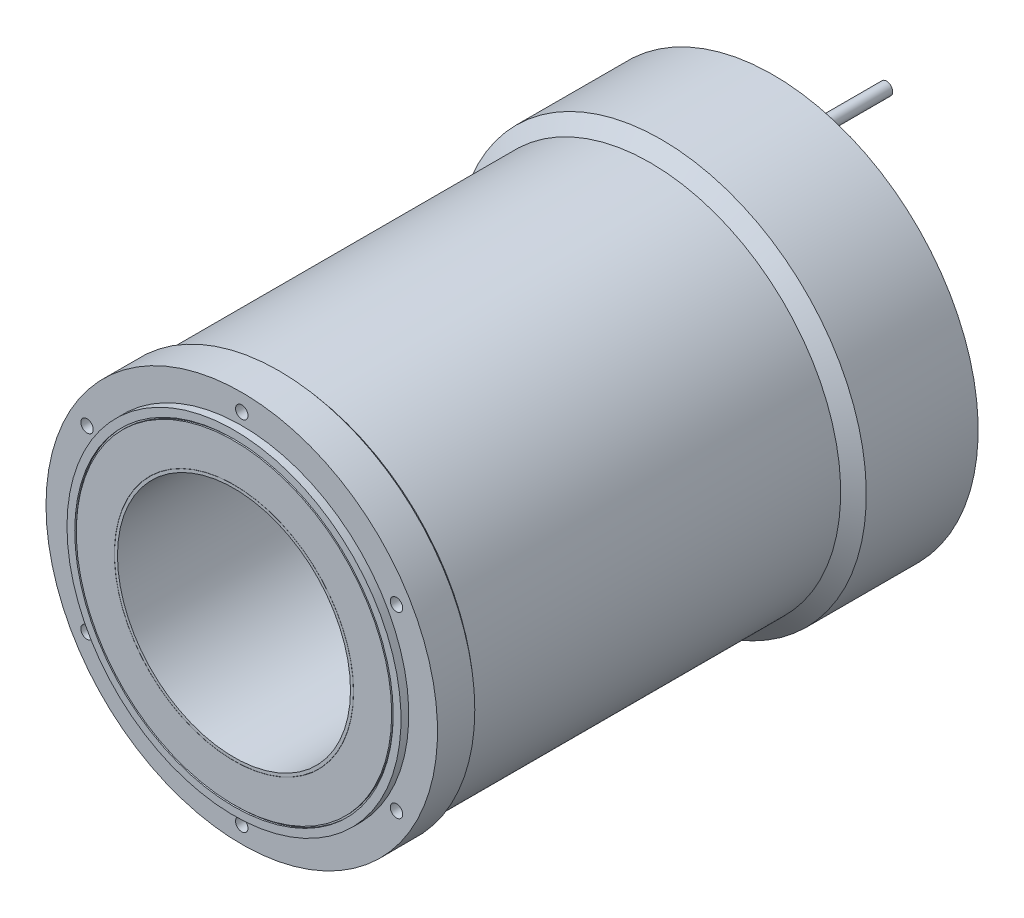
ISO-10303-21;
HEADER;
FILE_DESCRIPTION(('STEP AP214'),'2;1');
FILE_NAME('part.step','',(''),(''),'','','');
FILE_SCHEMA(('AUTOMOTIVE_DESIGN { 1 0 10303 214 1 1 1 1 }'));
ENDSEC;
DATA;
#1=APPLICATION_CONTEXT('core data for automotive mechanical design processes');
#2=APPLICATION_PROTOCOL_DEFINITION('international standard','automotive_design',2000,#1);
#3=PRODUCT_CONTEXT('',#1,'mechanical');
#4=PRODUCT('Part','Part','',(#3));
#5=PRODUCT_RELATED_PRODUCT_CATEGORY('part','',(#4));
#6=PRODUCT_DEFINITION_FORMATION('','',#4);
#7=PRODUCT_DEFINITION_CONTEXT('part definition',#1,'design');
#8=PRODUCT_DEFINITION('design','',#6,#7);
#9=PRODUCT_DEFINITION_SHAPE('','',#8);
#10=(LENGTH_UNIT() NAMED_UNIT(*) SI_UNIT(.MILLI.,.METRE.));
#11=(NAMED_UNIT(*) PLANE_ANGLE_UNIT() SI_UNIT($,.RADIAN.));
#12=(NAMED_UNIT(*) SI_UNIT($,.STERADIAN.) SOLID_ANGLE_UNIT());
#13=UNCERTAINTY_MEASURE_WITH_UNIT(LENGTH_MEASURE(1.E-05),#10,'distance_accuracy_value','');
#14=(GEOMETRIC_REPRESENTATION_CONTEXT(3) GLOBAL_UNCERTAINTY_ASSIGNED_CONTEXT((#13)) GLOBAL_UNIT_ASSIGNED_CONTEXT((#10,
#11,#12)) REPRESENTATION_CONTEXT('',''));
#15=CARTESIAN_POINT('',(0.,0.,0.));
#16=DIRECTION('',(0.,0.,1.));
#17=DIRECTION('',(1.,0.,0.));
#18=AXIS2_PLACEMENT_3D('',#15,#16,#17);
#19=CARTESIAN_POINT('',(-98.111250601,51.970329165,341.));
#20=DIRECTION('',(0.,0.,1.));
#21=DIRECTION('',(0.499999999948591,0.86602540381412,0.));
#22=AXIS2_PLACEMENT_3D('',#19,#20,#21);
#23=PLANE('',#22);
#24=CARTESIAN_POINT('',(-99.592921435,57.5,341.));
#25=DIRECTION('',(0.,0.,1.));
#26=DIRECTION('',(0.,-1.,0.));
#27=AXIS2_PLACEMENT_3D('',#24,#25,#26);
#28=CIRCLE('',#27,4.);
#29=CARTESIAN_POINT('',(-99.592921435,53.5,341.));
#30=VERTEX_POINT('',#29);
#31=EDGE_CURVE('E20',#30,#30,#28,.F.);
#32=ORIENTED_EDGE('',*,*,#31,.F.);
#33=EDGE_LOOP('',(#32));
#34=FACE_BOUND('',#33,.T.);
#35=ADVANCED_FACE('F16',(#34),#23,.T.);
#36=CARTESIAN_POINT('',(-94.063250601,-58.981670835,341.));
#37=DIRECTION('',(0.,0.,1.));
#38=DIRECTION('',(-0.499999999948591,0.86602540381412,0.));
#39=AXIS2_PLACEMENT_3D('',#36,#37,#38);
#40=PLANE('',#39);
#41=CARTESIAN_POINT('',(-99.592921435,-57.5,341.));
#42=DIRECTION('',(0.,0.,1.));
#43=DIRECTION('',(1.,0.,0.));
#44=AXIS2_PLACEMENT_3D('',#41,#42,#43);
#45=CIRCLE('',#44,4.);
#46=CARTESIAN_POINT('',(-95.592921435,-57.5,341.));
#47=VERTEX_POINT('',#46);
#48=EDGE_CURVE('E492',#47,#47,#45,.F.);
#49=ORIENTED_EDGE('',*,*,#48,.F.);
#50=EDGE_LOOP('',(#49));
#51=FACE_BOUND('',#50,.T.);
#52=ADVANCED_FACE('F502',(#51),#40,.T.);
#53=CARTESIAN_POINT('',(4.048,-110.952,341.));
#54=DIRECTION('',(0.,0.,1.));
#55=DIRECTION('',(-1.,0.,0.));
#56=AXIS2_PLACEMENT_3D('',#53,#54,#55);
#57=PLANE('',#56);
#58=CARTESIAN_POINT('',(0.,-115.,341.));
#59=DIRECTION('',(0.,0.,1.));
#60=DIRECTION('',(1.,0.,0.));
#61=AXIS2_PLACEMENT_3D('',#58,#59,#60);
#62=CIRCLE('',#61,4.);
#63=CARTESIAN_POINT('',(4.,-115.,341.));
#64=VERTEX_POINT('',#63);
#65=EDGE_CURVE('E490',#64,#64,#62,.F.);
#66=ORIENTED_EDGE('',*,*,#65,.F.);
#67=EDGE_LOOP('',(#66));
#68=FACE_BOUND('',#67,.T.);
#69=ADVANCED_FACE('F508',(#68),#57,.T.);
#70=CARTESIAN_POINT('',(98.111250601,-51.970329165,341.));
#71=DIRECTION('',(0.,0.,1.));
#72=DIRECTION('',(-0.499999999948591,-0.86602540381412,0.));
#73=AXIS2_PLACEMENT_3D('',#70,#71,#72);
#74=PLANE('',#73);
#75=CARTESIAN_POINT('',(99.592921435,-57.5,341.));
#76=DIRECTION('',(0.,0.,1.));
#77=DIRECTION('',(1.,0.,0.));
#78=AXIS2_PLACEMENT_3D('',#75,#76,#77);
#79=CIRCLE('',#78,4.);
#80=CARTESIAN_POINT('',(103.592921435,-57.5,341.));
#81=VERTEX_POINT('',#80);
#82=EDGE_CURVE('E487',#81,#81,#79,.F.);
#83=ORIENTED_EDGE('',*,*,#82,.F.);
#84=EDGE_LOOP('',(#83));
#85=FACE_BOUND('',#84,.T.);
#86=ADVANCED_FACE('F2398',(#85),#74,.T.);
#87=CARTESIAN_POINT('',(94.063250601,58.981670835,341.));
#88=DIRECTION('',(0.,0.,1.));
#89=DIRECTION('',(0.499999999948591,-0.86602540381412,0.));
#90=AXIS2_PLACEMENT_3D('',#87,#88,#89);
#91=PLANE('',#90);
#92=CARTESIAN_POINT('',(99.592921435,57.5,341.));
#93=DIRECTION('',(0.,0.,1.));
#94=DIRECTION('',(0.,-1.,0.));
#95=AXIS2_PLACEMENT_3D('',#92,#93,#94);
#96=CIRCLE('',#95,4.);
#97=CARTESIAN_POINT('',(99.592921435,53.5,341.));
#98=VERTEX_POINT('',#97);
#99=EDGE_CURVE('E484',#98,#98,#96,.F.);
#100=ORIENTED_EDGE('',*,*,#99,.F.);
#101=EDGE_LOOP('',(#100));
#102=FACE_BOUND('',#101,.T.);
#103=ADVANCED_FACE('F1381',(#102),#91,.T.);
#104=CARTESIAN_POINT('',(-4.048,110.952,341.));
#105=DIRECTION('',(0.,0.,1.));
#106=DIRECTION('',(1.,0.,0.));
#107=AXIS2_PLACEMENT_3D('',#104,#105,#106);
#108=PLANE('',#107);
#109=CARTESIAN_POINT('',(0.,115.,341.));
#110=DIRECTION('',(0.,0.,1.));
#111=DIRECTION('',(0.,-1.,0.));
#112=AXIS2_PLACEMENT_3D('',#109,#110,#111);
#113=CIRCLE('',#112,4.);
#114=CARTESIAN_POINT('',(0.,111.,341.));
#115=VERTEX_POINT('',#114);
#116=EDGE_CURVE('E481',#115,#115,#113,.F.);
#117=ORIENTED_EDGE('',*,*,#116,.F.);
#118=EDGE_LOOP('',(#117));
#119=FACE_BOUND('',#118,.T.);
#120=ADVANCED_FACE('F1376',(#119),#108,.T.);
#121=CARTESIAN_POINT('',(-99.592921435,57.5,341.));
#122=DIRECTION('',(0.,0.,1.));
#123=DIRECTION('',(0.,-1.,0.));
#124=AXIS2_PLACEMENT_3D('',#121,#122,#123);
#125=CYLINDRICAL_SURFACE('',#124,4.);
#126=CARTESIAN_POINT('',(-99.592921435,57.5000000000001,353.));
#127=DIRECTION('',(0.,0.,1.));
#128=DIRECTION('',(0.,-1.,0.));
#129=AXIS2_PLACEMENT_3D('',#126,#127,#128);
#130=CIRCLE('',#129,4.);
#131=CARTESIAN_POINT('',(-99.592921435,53.5000000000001,353.));
#132=VERTEX_POINT('',#131);
#133=EDGE_CURVE('E475',#132,#132,#130,.F.);
#134=ORIENTED_EDGE('',*,*,#133,.F.);
#135=EDGE_LOOP('',(#134));
#136=FACE_BOUND('',#135,.T.);
#137=ORIENTED_EDGE('',*,*,#31,.T.);
#138=EDGE_LOOP('',(#137));
#139=FACE_BOUND('',#138,.T.);
#140=ADVANCED_FACE('F499',(#136,#139),#125,.F.);
#141=CARTESIAN_POINT('',(-99.592921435,-57.5,341.));
#142=DIRECTION('',(0.,0.,1.));
#143=DIRECTION('',(1.,0.,0.));
#144=AXIS2_PLACEMENT_3D('',#141,#142,#143);
#145=CYLINDRICAL_SURFACE('',#144,4.);
#146=CARTESIAN_POINT('',(-99.5929214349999,-57.5,353.));
#147=DIRECTION('',(0.,0.,1.));
#148=DIRECTION('',(1.,0.,0.));
#149=AXIS2_PLACEMENT_3D('',#146,#147,#148);
#150=CIRCLE('',#149,4.);
#151=CARTESIAN_POINT('',(-95.5929214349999,-57.5,353.));
#152=VERTEX_POINT('',#151);
#153=EDGE_CURVE('E472',#152,#152,#150,.F.);
#154=ORIENTED_EDGE('',*,*,#153,.F.);
#155=EDGE_LOOP('',(#154));
#156=FACE_BOUND('',#155,.T.);
#157=ORIENTED_EDGE('',*,*,#48,.T.);
#158=EDGE_LOOP('',(#157));
#159=FACE_BOUND('',#158,.T.);
#160=ADVANCED_FACE('F1371',(#156,#159),#145,.F.);
#161=CARTESIAN_POINT('',(0.,-115.,341.));
#162=DIRECTION('',(0.,0.,1.));
#163=DIRECTION('',(1.,0.,0.));
#164=AXIS2_PLACEMENT_3D('',#161,#162,#163);
#165=CYLINDRICAL_SURFACE('',#164,4.);
#166=CARTESIAN_POINT('',(0.,-115.,353.));
#167=DIRECTION('',(0.,0.,1.));
#168=DIRECTION('',(1.,0.,0.));
#169=AXIS2_PLACEMENT_3D('',#166,#167,#168);
#170=CIRCLE('',#169,4.);
#171=CARTESIAN_POINT('',(4.00000000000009,-115.,353.));
#172=VERTEX_POINT('',#171);
#173=EDGE_CURVE('E469',#172,#172,#170,.F.);
#174=ORIENTED_EDGE('',*,*,#173,.F.);
#175=EDGE_LOOP('',(#174));
#176=FACE_BOUND('',#175,.T.);
#177=ORIENTED_EDGE('',*,*,#65,.T.);
#178=EDGE_LOOP('',(#177));
#179=FACE_BOUND('',#178,.T.);
#180=ADVANCED_FACE('F1367',(#176,#179),#165,.F.);
#181=CARTESIAN_POINT('',(99.592921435,-57.5,341.));
#182=DIRECTION('',(0.,0.,1.));
#183=DIRECTION('',(1.,0.,0.));
#184=AXIS2_PLACEMENT_3D('',#181,#182,#183);
#185=CYLINDRICAL_SURFACE('',#184,4.);
#186=CARTESIAN_POINT('',(99.5929214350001,-57.5,353.));
#187=DIRECTION('',(0.,0.,1.));
#188=DIRECTION('',(1.,0.,0.));
#189=AXIS2_PLACEMENT_3D('',#186,#187,#188);
#190=CIRCLE('',#189,4.);
#191=CARTESIAN_POINT('',(103.592921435,-57.5,353.));
#192=VERTEX_POINT('',#191);
#193=EDGE_CURVE('E466',#192,#192,#190,.F.);
#194=ORIENTED_EDGE('',*,*,#193,.F.);
#195=EDGE_LOOP('',(#194));
#196=FACE_BOUND('',#195,.T.);
#197=ORIENTED_EDGE('',*,*,#82,.T.);
#198=EDGE_LOOP('',(#197));
#199=FACE_BOUND('',#198,.T.);
#200=ADVANCED_FACE('F1363',(#196,#199),#185,.F.);
#201=CARTESIAN_POINT('',(99.592921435,57.5,341.));
#202=DIRECTION('',(0.,0.,1.));
#203=DIRECTION('',(0.,-1.,0.));
#204=AXIS2_PLACEMENT_3D('',#201,#202,#203);
#205=CYLINDRICAL_SURFACE('',#204,4.);
#206=CARTESIAN_POINT('',(99.592921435,57.5000000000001,353.));
#207=DIRECTION('',(0.,0.,1.));
#208=DIRECTION('',(0.,-1.,0.));
#209=AXIS2_PLACEMENT_3D('',#206,#207,#208);
#210=CIRCLE('',#209,4.);
#211=CARTESIAN_POINT('',(99.592921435,53.5000000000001,353.));
#212=VERTEX_POINT('',#211);
#213=EDGE_CURVE('E463',#212,#212,#210,.F.);
#214=ORIENTED_EDGE('',*,*,#213,.F.);
#215=EDGE_LOOP('',(#214));
#216=FACE_BOUND('',#215,.T.);
#217=ORIENTED_EDGE('',*,*,#99,.T.);
#218=EDGE_LOOP('',(#217));
#219=FACE_BOUND('',#218,.T.);
#220=ADVANCED_FACE('F1359',(#216,#219),#205,.F.);
#221=CARTESIAN_POINT('',(0.,115.,341.));
#222=DIRECTION('',(0.,0.,1.));
#223=DIRECTION('',(0.,-1.,0.));
#224=AXIS2_PLACEMENT_3D('',#221,#222,#223);
#225=CYLINDRICAL_SURFACE('',#224,4.);
#226=CARTESIAN_POINT('',(0.,115.,353.));
#227=DIRECTION('',(0.,0.,1.));
#228=DIRECTION('',(0.,-1.,0.));
#229=AXIS2_PLACEMENT_3D('',#226,#227,#228);
#230=CIRCLE('',#229,4.);
#231=CARTESIAN_POINT('',(0.,111.,353.));
#232=VERTEX_POINT('',#231);
#233=EDGE_CURVE('E460',#232,#232,#230,.F.);
#234=ORIENTED_EDGE('',*,*,#233,.F.);
#235=EDGE_LOOP('',(#234));
#236=FACE_BOUND('',#235,.T.);
#237=ORIENTED_EDGE('',*,*,#116,.T.);
#238=EDGE_LOOP('',(#237));
#239=FACE_BOUND('',#238,.T.);
#240=ADVANCED_FACE('F1355',(#236,#239),#225,.F.);
#241=CARTESIAN_POINT('',(0.,0.,358.));
#242=DIRECTION('',(0.,0.,-1.));
#243=DIRECTION('',(-1.,0.,0.));
#244=AXIS2_PLACEMENT_3D('',#241,#242,#243);
#245=CYLINDRICAL_SURFACE('',#244,107.5);
#246=CARTESIAN_POINT('',(0.,0.,358.));
#247=DIRECTION('',(0.,0.,-1.));
#248=DIRECTION('',(-1.,0.,0.));
#249=AXIS2_PLACEMENT_3D('',#246,#247,#248);
#250=CIRCLE('',#249,107.5);
#251=CARTESIAN_POINT('',(-107.5,0.,358.));
#252=VERTEX_POINT('',#251);
#253=EDGE_CURVE('E478',#252,#252,#250,.F.);
#254=ORIENTED_EDGE('',*,*,#253,.F.);
#255=EDGE_LOOP('',(#254));
#256=FACE_BOUND('',#255,.T.);
#257=CARTESIAN_POINT('',(0.,0.,353.));
#258=DIRECTION('',(0.,0.,-1.));
#259=DIRECTION('',(-1.,0.,0.));
#260=AXIS2_PLACEMENT_3D('',#257,#258,#259);
#261=CIRCLE('',#260,107.5);
#262=CARTESIAN_POINT('',(-107.5,0.,353.));
#263=VERTEX_POINT('',#262);
#264=EDGE_CURVE('E457',#263,#263,#261,.T.);
#265=ORIENTED_EDGE('',*,*,#264,.F.);
#266=EDGE_LOOP('',(#265));
#267=FACE_BOUND('',#266,.T.);
#268=ADVANCED_FACE('F1351',(#256,#267),#245,.T.);
#269=CARTESIAN_POINT('',(-108.79,108.79,358.));
#270=DIRECTION('',(0.,0.,1.));
#271=DIRECTION('',(0.,-1.,0.));
#272=AXIS2_PLACEMENT_3D('',#269,#270,#271);
#273=PLANE('',#272);
#274=CARTESIAN_POINT('',(0.,0.,358.));
#275=DIRECTION('',(0.,0.,1.));
#276=DIRECTION('',(1.,0.,0.));
#277=AXIS2_PLACEMENT_3D('',#274,#275,#276);
#278=CIRCLE('',#277,102.5);
#279=CARTESIAN_POINT('',(102.5,0.,358.));
#280=VERTEX_POINT('',#279);
#281=EDGE_CURVE('E454',#280,#280,#278,.T.);
#282=ORIENTED_EDGE('',*,*,#281,.F.);
#283=EDGE_LOOP('',(#282));
#284=FACE_BOUND('',#283,.T.);
#285=ORIENTED_EDGE('',*,*,#253,.T.);
#286=EDGE_LOOP('',(#285));
#287=FACE_BOUND('',#286,.T.);
#288=ADVANCED_FACE('F1354',(#284,#287),#273,.T.);
#289=CARTESIAN_POINT('',(-127.512,127.512,353.));
#290=DIRECTION('',(0.,0.,1.));
#291=DIRECTION('',(0.,-1.,0.));
#292=AXIS2_PLACEMENT_3D('',#289,#290,#291);
#293=PLANE('',#292);
#294=ORIENTED_EDGE('',*,*,#264,.T.);
#295=EDGE_LOOP('',(#294));
#296=FACE_BOUND('',#295,.T.);
#297=ORIENTED_EDGE('',*,*,#233,.T.);
#298=EDGE_LOOP('',(#297));
#299=FACE_BOUND('',#298,.T.);
#300=ORIENTED_EDGE('',*,*,#213,.T.);
#301=EDGE_LOOP('',(#300));
#302=FACE_BOUND('',#301,.T.);
#303=ORIENTED_EDGE('',*,*,#193,.T.);
#304=EDGE_LOOP('',(#303));
#305=FACE_BOUND('',#304,.T.);
#306=ORIENTED_EDGE('',*,*,#173,.T.);
#307=EDGE_LOOP('',(#306));
#308=FACE_BOUND('',#307,.T.);
#309=ORIENTED_EDGE('',*,*,#153,.T.);
#310=EDGE_LOOP('',(#309));
#311=FACE_BOUND('',#310,.T.);
#312=ORIENTED_EDGE('',*,*,#133,.T.);
#313=EDGE_LOOP('',(#312));
#314=FACE_BOUND('',#313,.T.);
#315=CARTESIAN_POINT('',(0.,0.,353.));
#316=DIRECTION('',(0.,0.,-1.));
#317=DIRECTION('',(-1.,0.,0.));
#318=AXIS2_PLACEMENT_3D('',#315,#316,#317);
#319=CIRCLE('',#318,126.);
#320=CARTESIAN_POINT('',(-126.,0.,353.));
#321=VERTEX_POINT('',#320);
#322=EDGE_CURVE('E451',#321,#321,#319,.F.);
#323=ORIENTED_EDGE('',*,*,#322,.T.);
#324=EDGE_LOOP('',(#323));
#325=FACE_BOUND('',#324,.T.);
#326=ADVANCED_FACE('F1349',(#296,#299,#302,#305,#308,#311,#314,#325),#293,.T.);
#327=CARTESIAN_POINT('',(0.,0.,357.));
#328=DIRECTION('',(0.,0.,1.));
#329=DIRECTION('',(1.,0.,0.));
#330=AXIS2_PLACEMENT_3D('',#327,#328,#329);
#331=CYLINDRICAL_SURFACE('',#330,102.5);
#332=ORIENTED_EDGE('',*,*,#281,.T.);
#333=EDGE_LOOP('',(#332));
#334=FACE_BOUND('',#333,.T.);
#335=CARTESIAN_POINT('',(0.,0.,357.));
#336=DIRECTION('',(0.,0.,1.));
#337=DIRECTION('',(1.,0.,0.));
#338=AXIS2_PLACEMENT_3D('',#335,#336,#337);
#339=CIRCLE('',#338,102.5);
#340=CARTESIAN_POINT('',(102.5,0.,357.));
#341=VERTEX_POINT('',#340);
#342=EDGE_CURVE('E448',#341,#341,#339,.T.);
#343=ORIENTED_EDGE('',*,*,#342,.F.);
#344=EDGE_LOOP('',(#343));
#345=FACE_BOUND('',#344,.T.);
#346=ADVANCED_FACE('F1345',(#334,#345),#331,.F.);
#347=CARTESIAN_POINT('',(0.,0.,353.));
#348=DIRECTION('',(0.,0.,-1.));
#349=DIRECTION('',(-1.,0.,0.));
#350=AXIS2_PLACEMENT_3D('',#347,#348,#349);
#351=CYLINDRICAL_SURFACE('',#350,126.);
#352=ORIENTED_EDGE('',*,*,#322,.F.);
#353=EDGE_LOOP('',(#352));
#354=FACE_BOUND('',#353,.T.);
#355=CARTESIAN_POINT('',(0.,0.,329.));
#356=DIRECTION('',(0.,0.,1.));
#357=DIRECTION('',(0.,-1.,0.));
#358=AXIS2_PLACEMENT_3D('',#355,#356,#357);
#359=CIRCLE('',#358,126.);
#360=CARTESIAN_POINT('',(0.,-126.,329.));
#361=VERTEX_POINT('',#360);
#362=EDGE_CURVE('E447',#361,#361,#359,.T.);
#363=ORIENTED_EDGE('',*,*,#362,.T.);
#364=EDGE_LOOP('',(#363));
#365=FACE_BOUND('',#364,.T.);
#366=ADVANCED_FACE('F1342',(#354,#365),#351,.T.);
#367=CARTESIAN_POINT('',(-103.73,-103.73,357.));
#368=DIRECTION('',(0.,0.,1.));
#369=DIRECTION('',(1.,0.,0.));
#370=AXIS2_PLACEMENT_3D('',#367,#368,#369);
#371=PLANE('',#370);
#372=CARTESIAN_POINT('',(0.,0.,357.));
#373=DIRECTION('',(0.,0.,1.));
#374=DIRECTION('',(1.,0.,0.));
#375=AXIS2_PLACEMENT_3D('',#372,#373,#374);
#376=CIRCLE('',#375,101.5);
#377=CARTESIAN_POINT('',(101.5,0.,357.));
#378=VERTEX_POINT('',#377);
#379=EDGE_CURVE('E444',#378,#378,#376,.F.);
#380=ORIENTED_EDGE('',*,*,#379,.T.);
#381=EDGE_LOOP('',(#380));
#382=FACE_BOUND('',#381,.T.);
#383=ORIENTED_EDGE('',*,*,#342,.T.);
#384=EDGE_LOOP('',(#383));
#385=FACE_BOUND('',#384,.T.);
#386=ADVANCED_FACE('F1337',(#382,#385),#371,.T.);
#387=CARTESIAN_POINT('',(0.,0.,326.));
#388=DIRECTION('',(0.,0.,1.));
#389=DIRECTION('',(1.,0.,0.));
#390=AXIS2_PLACEMENT_3D('',#387,#388,#389);
#391=CONICAL_SURFACE('',#390,122.5,0.862170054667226);
#392=CARTESIAN_POINT('',(0.,0.,326.));
#393=DIRECTION('',(0.,0.,-1.));
#394=DIRECTION('',(0.,1.,0.));
#395=AXIS2_PLACEMENT_3D('',#392,#393,#394);
#396=CIRCLE('',#395,122.5);
#397=CARTESIAN_POINT('',(0.,122.5,326.));
#398=VERTEX_POINT('',#397);
#399=EDGE_CURVE('E443',#398,#398,#396,.F.);
#400=ORIENTED_EDGE('',*,*,#399,.T.);
#401=EDGE_LOOP('',(#400));
#402=FACE_BOUND('',#401,.T.);
#403=ORIENTED_EDGE('',*,*,#362,.F.);
#404=EDGE_LOOP('',(#403));
#405=FACE_BOUND('',#404,.T.);
#406=ADVANCED_FACE('F1331',(#402,#405),#391,.T.);
#407=CARTESIAN_POINT('',(0.,0.,357.));
#408=DIRECTION('',(0.,0.,1.));
#409=DIRECTION('',(1.,0.,0.));
#410=AXIS2_PLACEMENT_3D('',#407,#408,#409);
#411=CYLINDRICAL_SURFACE('',#410,101.5);
#412=ORIENTED_EDGE('',*,*,#379,.F.);
#413=EDGE_LOOP('',(#412));
#414=FACE_BOUND('',#413,.T.);
#415=CARTESIAN_POINT('',(0.,0.,358.));
#416=DIRECTION('',(0.,0.,1.));
#417=DIRECTION('',(1.,0.,0.));
#418=AXIS2_PLACEMENT_3D('',#415,#416,#417);
#419=CIRCLE('',#418,101.5);
#420=CARTESIAN_POINT('',(101.5,0.,358.));
#421=VERTEX_POINT('',#420);
#422=EDGE_CURVE('E420',#421,#421,#419,.T.);
#423=ORIENTED_EDGE('',*,*,#422,.F.);
#424=EDGE_LOOP('',(#423));
#425=FACE_BOUND('',#424,.T.);
#426=ADVANCED_FACE('F1329',(#414,#425),#411,.T.);
#427=CARTESIAN_POINT('',(0.,0.,43.));
#428=DIRECTION('',(0.,0.,-1.));
#429=DIRECTION('',(-1.,0.,0.));
#430=AXIS2_PLACEMENT_3D('',#427,#428,#429);
#431=CYLINDRICAL_SURFACE('',#430,132.1);
#432=DIRECTION('',(0.,0.,1.));
#433=VECTOR('',#432,1.);
#434=CARTESIAN_POINT('',(-127.09227207,36.027272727,33.));
#435=LINE('',#434,#433);
#436=CARTESIAN_POINT('',(-127.092272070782,36.0272727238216,23.));
#437=VERTEX_POINT('',#436);
#438=CARTESIAN_POINT('',(-127.09227206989,36.0272727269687,43.));
#439=VERTEX_POINT('',#438);
#440=EDGE_CURVE('E434',#437,#439,#435,.T.);
#441=ORIENTED_EDGE('',*,*,#440,.F.);
#442=CARTESIAN_POINT('',(0.,0.,23.));
#443=DIRECTION('',(0.,0.,-1.));
#444=DIRECTION('',(-1.,0.,0.));
#445=AXIS2_PLACEMENT_3D('',#442,#443,#444);
#446=CIRCLE('',#445,132.1);
#447=CARTESIAN_POINT('',(-132.076305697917,2.50189393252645,23.));
#448=VERTEX_POINT('',#447);
#449=EDGE_CURVE('E416',#448,#437,#446,.T.);
#450=ORIENTED_EDGE('',*,*,#449,.F.);
#451=DIRECTION('',(0.,0.,1.));
#452=VECTOR('',#451,1.);
#453=CARTESIAN_POINT('',(-132.076305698,2.50189394,33.));
#454=LINE('',#453,#452);
#455=CARTESIAN_POINT('',(-132.076305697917,2.50189393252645,43.));
#456=VERTEX_POINT('',#455);
#457=EDGE_CURVE('E409',#448,#456,#454,.T.);
#458=ORIENTED_EDGE('',*,*,#457,.T.);
#459=CARTESIAN_POINT('',(0.,0.,43.));
#460=DIRECTION('',(0.,0.,-1.));
#461=DIRECTION('',(-1.,0.,0.));
#462=AXIS2_PLACEMENT_3D('',#459,#460,#461);
#463=CIRCLE('',#462,132.1);
#464=EDGE_CURVE('E413',#439,#456,#463,.F.);
#465=ORIENTED_EDGE('',*,*,#464,.F.);
#466=EDGE_LOOP('',(#441,#450,#458,#465));
#467=FACE_BOUND('',#466,.T.);
#468=ADVANCED_FACE('F411',(#467),#431,.T.);
#469=CARTESIAN_POINT('',(0.,0.,40.303698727));
#470=DIRECTION('',(0.,0.,-1.));
#471=DIRECTION('',(-1.,0.,0.));
#472=AXIS2_PLACEMENT_3D('',#469,#470,#471);
#473=CYLINDRICAL_SURFACE('',#472,132.1);
#474=CARTESIAN_POINT('',(-129.451425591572,-26.3199242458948,23.));
#475=CARTESIAN_POINT('',(-129.444691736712,-26.3530441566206,23.0000018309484));
#476=CARTESIAN_POINT('',(-129.437949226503,-26.3861409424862,23.0013710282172));
#477=CARTESIAN_POINT('',(-129.424470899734,-26.4521732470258,23.0068407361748));
#478=CARTESIAN_POINT('',(-129.417735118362,-26.4851083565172,23.0109462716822));
#479=CARTESIAN_POINT('',(-129.397455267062,-26.5840764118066,23.0274819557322));
#480=CARTESIAN_POINT('',(-129.383997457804,-26.6494913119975,23.0441316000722));
#481=CARTESIAN_POINT('',(-129.364307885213,-26.744848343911,23.0771318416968));
#482=CARTESIAN_POINT('',(-129.357823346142,-26.7761933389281,23.0894805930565));
#483=CARTESIAN_POINT('',(-129.345055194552,-26.8378032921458,23.1167926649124));
#484=CARTESIAN_POINT('',(-129.338771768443,-26.8680672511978,23.1317583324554));
#485=CARTESIAN_POINT('',(-129.320057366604,-26.9580517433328,23.1811135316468));
#486=CARTESIAN_POINT('',(-129.308021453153,-27.0157105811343,23.2195299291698));
#487=CARTESIAN_POINT('',(-129.285408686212,-27.1237194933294,23.3058270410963));
#488=CARTESIAN_POINT('',(-129.274831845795,-27.1740695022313,23.3537078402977));
#489=CARTESIAN_POINT('',(-129.255641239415,-27.2652038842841,23.456803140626));
#490=CARTESIAN_POINT('',(-129.246997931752,-27.3061325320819,23.5118834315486));
#491=CARTESIAN_POINT('',(-129.235590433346,-27.3600530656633,23.5992111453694));
#492=CARTESIAN_POINT('',(-129.232047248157,-27.3767824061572,23.6291079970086));
#493=CARTESIAN_POINT('',(-129.225499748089,-27.4076715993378,23.6903025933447));
#494=CARTESIAN_POINT('',(-129.222496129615,-27.4218281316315,23.7216020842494));
#495=CARTESIAN_POINT('',(-129.214480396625,-27.4595834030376,23.8157364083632));
#496=CARTESIAN_POINT('',(-129.210275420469,-27.4793549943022,23.8802484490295));
#497=CARTESIAN_POINT('',(-129.205723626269,-27.5007459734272,23.9787786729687));
#498=CARTESIAN_POINT('',(-129.204498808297,-27.5064993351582,24.0119320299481));
#499=CARTESIAN_POINT('',(-129.202650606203,-27.5151794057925,24.0786202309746));
#500=CARTESIAN_POINT('',(-129.202026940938,-27.5181074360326,24.1121548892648));
#501=CARTESIAN_POINT('',(-129.201386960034,-27.5211120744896,24.1788149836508));
#502=CARTESIAN_POINT('',(-129.201361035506,-27.5212337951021,24.2119383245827));
#503=CARTESIAN_POINT('',(-129.201891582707,-27.5187429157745,24.278038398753));
#504=CARTESIAN_POINT('',(-129.202447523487,-27.5161328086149,24.3110152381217));
#505=CARTESIAN_POINT('',(-129.204985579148,-27.5042138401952,24.409452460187));
#506=CARTESIAN_POINT('',(-129.207837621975,-27.4908177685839,24.4744519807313));
#507=CARTESIAN_POINT('',(-129.215000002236,-27.457130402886,24.589199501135));
#508=CARTESIAN_POINT('',(-129.218933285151,-27.4386187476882,24.6395098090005));
#509=CARTESIAN_POINT('',(-129.228154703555,-27.3951546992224,24.7370719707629));
#510=CARTESIAN_POINT('',(-129.23344142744,-27.3702090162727,24.7843269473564));
#511=CARTESIAN_POINT('',(-129.239361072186,-27.3422301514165,24.8296604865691));
#512=B_SPLINE_CURVE_WITH_KNOTS('',3,(#474,#475,#476,#477,#478,#479,#480,#481,#482,#483,#484,
#485,#486,#487,#488,#489,#490,#491,#492,#493,#494,#495,#496,#497,#498,#499,#500,#501,#502,#503,
#504,#505,#506,#507,#508,#509,#510,#511),.UNSPECIFIED.,.F.,.F.,(4,2,2,2,2,2,2,2,2,2,2,2,2,2,2,2,
2,2,4),(0.,0.101323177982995,0.202832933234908,0.408215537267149,0.511045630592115,
0.613968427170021,0.823817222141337,1.03366789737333,1.2400520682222,1.3432637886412,
1.44660777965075,1.6482526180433,1.74917147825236,1.85004311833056,1.9492920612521,
2.04845051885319,2.24667125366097,2.40746273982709,2.56808720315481),.UNSPECIFIED.);
#513=CARTESIAN_POINT('',(-129.451425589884,-26.319924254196,23.));
#514=VERTEX_POINT('',#513);
#515=CARTESIAN_POINT('',(-129.239361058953,-27.3422302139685,24.8296603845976));
#516=VERTEX_POINT('',#515);
#517=EDGE_CURVE('E849',#514,#516,#512,.T.);
#518=ORIENTED_EDGE('',*,*,#517,.T.);
#519=CARTESIAN_POINT('',(-130.674209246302,-19.3561627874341,37.7760698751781));
#520=CARTESIAN_POINT('',(-130.669039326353,-19.3910651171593,37.7194888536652));
#521=CARTESIAN_POINT('',(-130.663855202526,-19.4259668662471,37.6629087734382));
#522=CARTESIAN_POINT('',(-130.637863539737,-19.600472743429,37.3800130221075));
#523=CARTESIAN_POINT('',(-130.616842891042,-19.7400681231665,37.1537115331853));
#524=CARTESIAN_POINT('',(-130.510601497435,-20.438000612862,36.0222760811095));
#525=CARTESIAN_POINT('',(-130.421967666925,-20.9961952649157,35.1173730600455));
#526=CARTESIAN_POINT('',(-130.169971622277,-22.5199164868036,32.6472312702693));
#527=CARTESIAN_POINT('',(-129.999320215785,-23.4851130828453,31.0825274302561));
#528=CARTESIAN_POINT('',(-129.635939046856,-25.4144998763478,27.9547512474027));
#529=CARTESIAN_POINT('',(-129.443206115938,-26.3786899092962,26.3916791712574));
#530=CARTESIAN_POINT('',(-129.239361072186,-27.3422301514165,24.8296604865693));
#531=B_SPLINE_CURVE_WITH_KNOTS('',3,(#519,#520,#521,#522,#523,#524,#525,#526,#527,#528,#529,
#530),.UNSPECIFIED.,.F.,.F.,(4,2,2,2,2,4),(0.,0.200042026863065,1.00021040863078,
4.20090157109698,9.73982612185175,15.2795464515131),.UNSPECIFIED.);
#532=CARTESIAN_POINT('',(-130.674209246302,-19.356162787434,37.7760698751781));
#533=VERTEX_POINT('',#532);
#534=EDGE_CURVE('E843',#533,#516,#531,.T.);
#535=ORIENTED_EDGE('',*,*,#534,.F.);
#536=CARTESIAN_POINT('',(-130.674209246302,-19.356162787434,37.7760698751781));
#537=CARTESIAN_POINT('',(-130.679429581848,-19.3209196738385,37.8332156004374));
#538=CARTESIAN_POINT('',(-130.684801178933,-19.2845577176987,37.8896698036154));
#539=CARTESIAN_POINT('',(-130.70138833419,-19.1719293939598,38.0571994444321));
#540=CARTESIAN_POINT('',(-130.713041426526,-19.0923539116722,38.1660279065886));
#541=CARTESIAN_POINT('',(-130.737408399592,-18.9247775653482,38.3769456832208));
#542=CARTESIAN_POINT('',(-130.750122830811,-18.8367723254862,38.4790314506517));
#543=CARTESIAN_POINT('',(-130.776458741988,-18.6530547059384,38.6758504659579));
#544=CARTESIAN_POINT('',(-130.790080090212,-18.5573434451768,38.7705847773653));
#545=CARTESIAN_POINT('',(-130.818082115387,-18.3589059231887,38.9521989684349));
#546=CARTESIAN_POINT('',(-130.832462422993,-18.2561830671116,39.0390826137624));
#547=CARTESIAN_POINT('',(-130.85449205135,-18.0973687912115,39.162901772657));
#548=CARTESIAN_POINT('',(-130.861901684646,-18.0437164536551,39.2030416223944));
#549=CARTESIAN_POINT('',(-130.876862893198,-17.9348760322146,39.2811555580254));
#550=CARTESIAN_POINT('',(-130.884414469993,-17.8796879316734,39.3191296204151));
#551=CARTESIAN_POINT('',(-130.907297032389,-17.7116451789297,39.4299240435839));
#552=CARTESIAN_POINT('',(-130.922817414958,-17.5965887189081,39.4994010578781));
#553=CARTESIAN_POINT('',(-130.954209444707,-17.361426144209,39.6292184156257));
#554=CARTESIAN_POINT('',(-130.970081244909,-17.2413178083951,39.6895546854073));
#555=CARTESIAN_POINT('',(-131.002052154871,-16.9966920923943,39.8004941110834));
#556=CARTESIAN_POINT('',(-131.018151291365,-16.8721741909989,39.8510961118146));
#557=CARTESIAN_POINT('',(-131.050432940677,-16.6195734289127,39.9422036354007));
#558=CARTESIAN_POINT('',(-131.066615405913,-16.4914924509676,39.9827143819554));
#559=CARTESIAN_POINT('',(-131.090826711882,-16.2975271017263,40.0358729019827));
#560=CARTESIAN_POINT('',(-131.098875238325,-16.2326591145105,40.0523063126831));
#561=CARTESIAN_POINT('',(-131.114949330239,-16.1023096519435,40.0826481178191));
#562=CARTESIAN_POINT('',(-131.12297488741,-16.0368279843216,40.0965556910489));
#563=CARTESIAN_POINT('',(-131.147225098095,-15.8377201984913,40.1347477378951));
#564=CARTESIAN_POINT('',(-131.163391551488,-15.7032863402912,40.1549900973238));
#565=CARTESIAN_POINT('',(-131.195452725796,-15.4331365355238,40.184558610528));
#566=CARTESIAN_POINT('',(-131.211347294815,-15.2974199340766,40.1938788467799));
#567=CARTESIAN_POINT('',(-131.242779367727,-15.0253668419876,40.2018017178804));
#568=CARTESIAN_POINT('',(-131.258316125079,-14.8890296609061,40.2003836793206));
#569=CARTESIAN_POINT('',(-131.288904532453,-14.6168498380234,40.1866645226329));
#570=CARTESIAN_POINT('',(-131.303956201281,-14.4810071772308,40.1743638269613));
#571=CARTESIAN_POINT('',(-131.333481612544,-14.2107383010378,40.1388374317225));
#572=CARTESIAN_POINT('',(-131.347955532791,-14.0763116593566,40.115615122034));
#573=CARTESIAN_POINT('',(-131.376259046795,-13.8096538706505,40.0585104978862));
#574=CARTESIAN_POINT('',(-131.390088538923,-13.6774230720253,40.0246265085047));
#575=CARTESIAN_POINT('',(-131.417020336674,-13.4161836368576,39.9465013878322));
#576=CARTESIAN_POINT('',(-131.430123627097,-13.2871707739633,39.9022747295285));
#577=CARTESIAN_POINT('',(-131.455559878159,-13.0331143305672,39.8035052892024));
#578=CARTESIAN_POINT('',(-131.467893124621,-12.9080692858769,39.7489663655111));
#579=CARTESIAN_POINT('',(-131.486033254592,-12.7215244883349,39.6585338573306));
#580=CARTESIAN_POINT('',(-131.492135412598,-12.6582887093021,39.6262296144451));
#581=CARTESIAN_POINT('',(-131.504117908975,-12.5331927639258,39.5590425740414));
#582=CARTESIAN_POINT('',(-131.509998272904,-12.471332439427,39.5241600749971));
#583=CARTESIAN_POINT('',(-131.527289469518,-12.2880898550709,39.4157546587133));
#584=CARTESIAN_POINT('',(-131.538364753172,-12.1688981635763,39.3384021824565));
#585=CARTESIAN_POINT('',(-131.55425464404,-11.995476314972,39.2151917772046));
#586=CARTESIAN_POINT('',(-131.55942404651,-11.9386390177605,39.1729886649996));
#587=CARTESIAN_POINT('',(-131.569529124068,-11.8267560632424,39.0862212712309));
#588=CARTESIAN_POINT('',(-131.574464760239,-11.7717107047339,39.0416565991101));
#589=CARTESIAN_POINT('',(-131.588325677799,-11.6160638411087,38.910179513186));
#590=CARTESIAN_POINT('',(-131.59695438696,-11.517839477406,38.8203991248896));
#591=CARTESIAN_POINT('',(-131.613383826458,-11.3285575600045,38.6335007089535));
#592=CARTESIAN_POINT('',(-131.62118455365,-11.2375000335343,38.536382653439));
#593=CARTESIAN_POINT('',(-131.63233308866,-11.1058942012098,38.3843978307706));
#594=CARTESIAN_POINT('',(-131.635994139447,-11.0624075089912,38.3320751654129));
#595=CARTESIAN_POINT('',(-131.643094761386,-10.9775867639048,38.2257183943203));
#596=CARTESIAN_POINT('',(-131.646534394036,-10.9362521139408,38.1716847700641));
#597=CARTESIAN_POINT('',(-131.653215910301,-10.8555236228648,38.0616280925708));
#598=CARTESIAN_POINT('',(-131.656456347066,-10.8161443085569,38.0055943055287));
#599=CARTESIAN_POINT('',(-131.662718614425,-10.7396460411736,37.8919692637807));
#600=CARTESIAN_POINT('',(-131.665740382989,-10.7025277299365,37.8343775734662));
#601=CARTESIAN_POINT('',(-131.668653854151,-10.6665642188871,37.7760694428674));
#602=B_SPLINE_CURVE_WITH_KNOTS('',3,(#536,#537,#538,#539,#540,#541,#542,#543,#544,#545,#546,
#547,#548,#549,#550,#551,#552,#553,#554,#555,#556,#557,#558,#559,#560,#561,#562,#563,#564,#565,
#566,#567,#568,#569,#570,#571,#572,#573,#574,#575,#576,#577,#578,#579,#580,#581,#582,#583,#584,
#585,#586,#587,#588,#589,#590,#591,#592,#593,#594,#595,#596,#597,#598,#599,#600,#601),
.UNSPECIFIED.,.F.,.F.,(4,2,2,2,2,2,2,2,2,2,2,2,2,2,2,2,2,2,2,2,2,2,2,2,2,2,2,2,2,2,2,2,4),(0.,
0.202039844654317,0.607544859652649,1.01326152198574,1.41891937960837,1.82438161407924,
2.0265784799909,2.22877753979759,2.63423112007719,3.03986486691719,3.44554672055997,
3.85101813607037,4.0531742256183,4.25539592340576,4.66563762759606,5.07610149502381,
5.48735579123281,5.89859412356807,6.30970489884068,6.7208802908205,7.13148371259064,
7.54193381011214,7.75569291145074,7.96942730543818,8.39640286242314,8.60929640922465,
8.82222527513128,9.22186310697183,9.62150245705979,9.82585455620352,10.030149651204,
10.2357862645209,10.4414809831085),.UNSPECIFIED.);
#603=CARTESIAN_POINT('',(-131.668653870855,-10.6665640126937,37.7760691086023));
#604=VERTEX_POINT('',#603);
#605=EDGE_CURVE('E874',#533,#604,#602,.T.);
#606=ORIENTED_EDGE('',*,*,#605,.T.);
#607=CARTESIAN_POINT('',(-132.072801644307,-2.68049730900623,24.829660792));
#608=CARTESIAN_POINT('',(-132.072091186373,-2.71550280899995,24.8864090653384));
#609=CARTESIAN_POINT('',(-132.071366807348,-2.75050823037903,24.9431572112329));
#610=CARTESIAN_POINT('',(-132.067675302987,-2.92553497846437,25.226897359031));
#611=CARTESIAN_POINT('',(-132.06449935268,-3.06555509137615,25.4538873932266));
#612=CARTESIAN_POINT('',(-132.047505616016,-3.76565137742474,26.5888306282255));
#613=CARTESIAN_POINT('',(-132.030346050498,-4.32570591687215,27.4967487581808));
#614=CARTESIAN_POINT('',(-131.973952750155,-5.84943350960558,29.9669008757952));
#615=CARTESIAN_POINT('',(-131.927723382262,-6.81303717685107,31.5290223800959));
#616=CARTESIAN_POINT('',(-131.814086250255,-8.74002849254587,34.652915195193));
#617=CARTESIAN_POINT('',(-131.746675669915,-9.70341609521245,36.2146864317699));
#618=CARTESIAN_POINT('',(-131.668653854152,-10.6665642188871,37.7760694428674));
#619=B_SPLINE_CURVE_WITH_KNOTS('',3,(#607,#608,#609,#610,#611,#612,#613,#614,#615,#616,#617,
#618),.UNSPECIFIED.,.F.,.F.,(4,2,2,2,2,4),(0.,0.200040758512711,1.0002040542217,
4.20087399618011,9.70874375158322,15.2173461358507),.UNSPECIFIED.);
#620=CARTESIAN_POINT('',(-132.072801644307,-2.68049730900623,24.829660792));
#621=VERTEX_POINT('',#620);
#622=EDGE_CURVE('E823',#621,#604,#619,.T.);
#623=ORIENTED_EDGE('',*,*,#622,.F.);
#624=CARTESIAN_POINT('',(-132.072801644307,-2.68049730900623,24.829660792));
#625=CARTESIAN_POINT('',(-132.073161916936,-2.66274375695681,24.8009060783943));
#626=CARTESIAN_POINT('',(-132.073494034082,-2.64620545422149,24.7713981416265));
#627=CARTESIAN_POINT('',(-132.07410258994,-2.61565712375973,24.711034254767));
#628=CARTESIAN_POINT('',(-132.074378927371,-2.60165169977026,24.6801759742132));
#629=CARTESIAN_POINT('',(-132.074875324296,-2.57632843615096,24.6173667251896));
#630=CARTESIAN_POINT('',(-132.075095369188,-2.56501129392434,24.5854154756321));
#631=CARTESIAN_POINT('',(-132.075481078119,-2.54507310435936,24.5206790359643));
#632=CARTESIAN_POINT('',(-132.075646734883,-2.5364524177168,24.4878937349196));
#633=CARTESIAN_POINT('',(-132.075923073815,-2.52202242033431,24.421680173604));
#634=CARTESIAN_POINT('',(-132.076033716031,-2.51621515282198,24.3882514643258));
#635=CARTESIAN_POINT('',(-132.07619970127,-2.50748673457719,24.3210156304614));
#636=CARTESIAN_POINT('',(-132.076255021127,-2.50456679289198,24.2872083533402));
#637=CARTESIAN_POINT('',(-132.076339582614,-2.50010902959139,24.1860259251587));
#638=CARTESIAN_POINT('',(-132.076289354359,-2.50277141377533,24.118414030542));
#639=CARTESIAN_POINT('',(-132.075972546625,-2.51943255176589,23.984630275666));
#640=CARTESIAN_POINT('',(-132.07570595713,-2.53343183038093,23.9184584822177));
#641=CARTESIAN_POINT('',(-132.0749533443,-2.57236787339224,23.7893231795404));
#642=CARTESIAN_POINT('',(-132.074467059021,-2.59731769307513,23.7263636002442));
#643=CARTESIAN_POINT('',(-132.073271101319,-2.6574348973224,23.6055244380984));
#644=CARTESIAN_POINT('',(-132.072561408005,-2.69260323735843,23.547645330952));
#645=CARTESIAN_POINT('',(-132.070916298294,-2.77211864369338,23.4386813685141));
#646=CARTESIAN_POINT('',(-132.069981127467,-2.81645571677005,23.3875892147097));
#647=CARTESIAN_POINT('',(-132.067886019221,-2.91304157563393,23.2935406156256));
#648=CARTESIAN_POINT('',(-132.066726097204,-2.96528981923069,23.2505836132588));
#649=CARTESIAN_POINT('',(-132.064184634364,-3.07639836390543,23.173952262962));
#650=CARTESIAN_POINT('',(-132.062802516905,-3.13527574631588,23.1403027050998));
#651=CARTESIAN_POINT('',(-132.059835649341,-3.25784619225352,23.0833835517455));
#652=CARTESIAN_POINT('',(-132.058250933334,-3.32153844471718,23.0601122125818));
#653=CARTESIAN_POINT('',(-132.055259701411,-3.43817243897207,23.0283137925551));
#654=CARTESIAN_POINT('',(-132.053885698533,-3.49056134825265,23.0177161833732));
#655=CARTESIAN_POINT('',(-132.051050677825,-3.5962278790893,23.0035550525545));
#656=CARTESIAN_POINT('',(-132.049589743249,-3.64950461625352,22.9999849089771));
#657=CARTESIAN_POINT('',(-132.048094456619,-3.70280304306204,23.));
#658=B_SPLINE_CURVE_WITH_KNOTS('',3,(#624,#625,#626,#627,#628,#629,#630,#631,#632,#633,#634,
#635,#636,#637,#638,#639,#640,#641,#642,#643,#644,#645,#646,#647,#648,#649,#650,#651,#652,#653,
#654,#655,#656,#657),.UNSPECIFIED.,.F.,.F.,(4,2,2,2,2,2,2,2,2,2,2,2,2,2,2,2,4),(0.,
0.101361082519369,0.202904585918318,0.304474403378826,0.406057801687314,0.507714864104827,
0.609414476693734,0.811371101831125,1.01333707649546,1.21554449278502,1.4177708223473,
1.61977789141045,1.8217711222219,2.02429728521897,2.22678940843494,2.38673780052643,
2.54653540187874),.UNSPECIFIED.);
#659=CARTESIAN_POINT('',(-132.048094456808,-3.70280303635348,23.));
#660=VERTEX_POINT('',#659);
#661=EDGE_CURVE('E815',#621,#660,#658,.T.);
#662=ORIENTED_EDGE('',*,*,#661,.T.);
#663=CARTESIAN_POINT('',(0.,0.,23.));
#664=DIRECTION('',(0.,0.,-1.));
#665=DIRECTION('',(-1.,0.,0.));
#666=AXIS2_PLACEMENT_3D('',#663,#664,#665);
#667=CIRCLE('',#666,132.1);
#668=EDGE_CURVE('E855',#514,#660,#667,.T.);
#669=ORIENTED_EDGE('',*,*,#668,.F.);
#670=EDGE_LOOP('',(#518,#535,#606,#623,#662,#669));
#671=FACE_BOUND('',#670,.T.);
#672=ADVANCED_FACE('F830',(#671),#473,.T.);
#673=CARTESIAN_POINT('',(0.,0.,326.));
#674=DIRECTION('',(0.,0.,-1.));
#675=DIRECTION('',(-1.,0.,0.));
#676=AXIS2_PLACEMENT_3D('',#673,#674,#675);
#677=CYLINDRICAL_SURFACE('',#676,122.5);
#678=ORIENTED_EDGE('',*,*,#399,.F.);
#679=EDGE_LOOP('',(#678));
#680=FACE_BOUND('',#679,.T.);
#681=CARTESIAN_POINT('',(0.,0.,90.));
#682=DIRECTION('',(0.,0.,-1.));
#683=DIRECTION('',(0.,1.,0.));
#684=AXIS2_PLACEMENT_3D('',#681,#682,#683);
#685=CIRCLE('',#684,122.5);
#686=CARTESIAN_POINT('',(0.,122.5,90.));
#687=VERTEX_POINT('',#686);
#688=EDGE_CURVE('E882',#687,#687,#685,.F.);
#689=ORIENTED_EDGE('',*,*,#688,.T.);
#690=EDGE_LOOP('',(#689));
#691=FACE_BOUND('',#690,.T.);
#692=ADVANCED_FACE('F835',(#680,#691),#677,.T.);
#693=CARTESIAN_POINT('',(-102.718,102.718,358.));
#694=DIRECTION('',(0.,0.,1.));
#695=DIRECTION('',(0.,-1.,0.));
#696=AXIS2_PLACEMENT_3D('',#693,#694,#695);
#697=PLANE('',#696);
#698=CARTESIAN_POINT('',(0.,0.,358.));
#699=DIRECTION('',(0.,0.,1.));
#700=DIRECTION('',(1.,0.,0.));
#701=AXIS2_PLACEMENT_3D('',#698,#699,#700);
#702=CIRCLE('',#701,77.);
#703=CARTESIAN_POINT('',(77.,0.,358.));
#704=VERTEX_POINT('',#703);
#705=EDGE_CURVE('E880',#704,#704,#702,.T.);
#706=ORIENTED_EDGE('',*,*,#705,.F.);
#707=EDGE_LOOP('',(#706));
#708=FACE_BOUND('',#707,.T.);
#709=ORIENTED_EDGE('',*,*,#422,.T.);
#710=EDGE_LOOP('',(#709));
#711=FACE_BOUND('',#710,.T.);
#712=ADVANCED_FACE('F1323',(#708,#711),#697,.T.);
#713=CARTESIAN_POINT('',(-131.976323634,2.5,43.));
#714=DIRECTION('',(0.0189393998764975,0.999820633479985,0.));
#715=DIRECTION('',(0.,0.,-1.));
#716=AXIS2_PLACEMENT_3D('',#713,#714,#715);
#717=PLANE('',#716);
#718=DIRECTION('',(0.,0.,-1.));
#719=VECTOR('',#718,1.);
#720=CARTESIAN_POINT('',(-131.976323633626,2.50000003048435,47.));
#721=LINE('',#720,#719);
#722=CARTESIAN_POINT('',(-131.976323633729,2.50000002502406,23.000000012));
#723=VERTEX_POINT('',#722);
#724=CARTESIAN_POINT('',(-131.976323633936,2.50000001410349,42.999999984));
#725=VERTEX_POINT('',#724);
#726=EDGE_CURVE('E426',#723,#725,#721,.F.);
#727=ORIENTED_EDGE('',*,*,#726,.T.);
#728=DIRECTION('',(0.999820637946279,-0.018939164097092,0.));
#729=VECTOR('',#728,1.);
#730=CARTESIAN_POINT('',(-132.076305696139,2.5018939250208,43.));
#731=LINE('',#730,#729);
#732=EDGE_CURVE('E419',#456,#725,#731,.T.);
#733=ORIENTED_EDGE('',*,*,#732,.F.);
#734=ORIENTED_EDGE('',*,*,#457,.F.);
#735=DIRECTION('',(-0.999820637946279,0.018939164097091,0.));
#736=VECTOR('',#735,1.);
#737=CARTESIAN_POINT('',(-131.976323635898,2.5000000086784,23.));
#738=LINE('',#737,#736);
#739=EDGE_CURVE('E2483',#723,#448,#738,.T.);
#740=ORIENTED_EDGE('',*,*,#739,.F.);
#741=EDGE_LOOP('',(#727,#733,#734,#740));
#742=FACE_BOUND('',#741,.T.);
#743=ADVANCED_FACE('F424',(#742),#717,.F.);
#744=CARTESIAN_POINT('',(-132.106787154,2.298836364,43.));
#745=DIRECTION('',(0.,0.,1.));
#746=DIRECTION('',(1.,0.,0.));
#747=AXIS2_PLACEMENT_3D('',#744,#745,#746);
#748=PLANE('',#747);
#749=DIRECTION('',(0.962091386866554,-0.27272726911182,0.));
#750=VECTOR('',#749,1.);
#751=CARTESIAN_POINT('',(-127.0441675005,36.0136363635,43.));
#752=LINE('',#751,#750);
#753=CARTESIAN_POINT('',(-126.996062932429,35.999999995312,42.999999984));
#754=VERTEX_POINT('',#753);
#755=EDGE_CURVE('E432',#439,#754,#752,.T.);
#756=ORIENTED_EDGE('',*,*,#755,.F.);
#757=ORIENTED_EDGE('',*,*,#464,.T.);
#758=ORIENTED_EDGE('',*,*,#732,.T.);
#759=CARTESIAN_POINT('',(0.,0.,42.999999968));
#760=DIRECTION('',(0.,0.,-1.));
#761=DIRECTION('',(-1.,0.,0.));
#762=AXIS2_PLACEMENT_3D('',#759,#760,#761);
#763=CIRCLE('',#762,132.);
#764=EDGE_CURVE('E878',#725,#754,#763,.T.);
#765=ORIENTED_EDGE('',*,*,#764,.T.);
#766=EDGE_LOOP('',(#756,#757,#758,#765));
#767=FACE_BOUND('',#766,.T.);
#768=ADVANCED_FACE('F430',(#767),#748,.T.);
#769=CARTESIAN_POINT('',(-126.996062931,36.,43.));
#770=DIRECTION('',(0.27272726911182,0.962091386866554,0.));
#771=DIRECTION('',(0.,0.,-1.));
#772=AXIS2_PLACEMENT_3D('',#769,#770,#771);
#773=PLANE('',#772);
#774=ORIENTED_EDGE('',*,*,#440,.T.);
#775=ORIENTED_EDGE('',*,*,#755,.T.);
#776=DIRECTION('',(0.,0.,1.));
#777=VECTOR('',#776,1.);
#778=CARTESIAN_POINT('',(-126.996062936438,35.9999999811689,47.));
#779=LINE('',#778,#777);
#780=CARTESIAN_POINT('',(-126.996062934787,35.999999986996,23.000000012));
#781=VERTEX_POINT('',#780);
#782=EDGE_CURVE('E875',#754,#781,#779,.F.);
#783=ORIENTED_EDGE('',*,*,#782,.T.);
#784=DIRECTION('',(0.962091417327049,-0.27272716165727,0.));
#785=VECTOR('',#784,1.);
#786=CARTESIAN_POINT('',(-127.092272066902,36.0272727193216,23.));
#787=LINE('',#786,#785);
#788=EDGE_CURVE('E438',#437,#781,#787,.T.);
#789=ORIENTED_EDGE('',*,*,#788,.F.);
#790=EDGE_LOOP('',(#774,#775,#783,#789));
#791=FACE_BOUND('',#790,.T.);
#792=ADVANCED_FACE('F1408',(#791),#773,.T.);
#793=CARTESIAN_POINT('',(-126.965581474,2.298836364,23.));
#794=DIRECTION('',(0.,0.,-1.));
#795=DIRECTION('',(-1.,0.,0.));
#796=AXIS2_PLACEMENT_3D('',#793,#794,#795);
#797=PLANE('',#796);
#798=ORIENTED_EDGE('',*,*,#739,.T.);
#799=ORIENTED_EDGE('',*,*,#449,.T.);
#800=ORIENTED_EDGE('',*,*,#788,.T.);
#801=CARTESIAN_POINT('',(0.,0.,23.000000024));
#802=DIRECTION('',(0.,0.,-1.));
#803=DIRECTION('',(-1.,0.,0.));
#804=AXIS2_PLACEMENT_3D('',#801,#802,#803);
#805=CIRCLE('',#804,132.);
#806=EDGE_CURVE('E877',#781,#723,#805,.F.);
#807=ORIENTED_EDGE('',*,*,#806,.T.);
#808=EDGE_LOOP('',(#798,#799,#800,#807));
#809=FACE_BOUND('',#808,.T.);
#810=ADVANCED_FACE('F1411',(#809),#797,.T.);
#811=CARTESIAN_POINT('',(-131.674119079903,-10.6116095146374,37.6868494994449));
#812=CARTESIAN_POINT('',(-131.672632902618,-10.6299549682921,37.7165895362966));
#813=CARTESIAN_POINT('',(-131.671146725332,-10.6483004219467,37.7463295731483));
#814=CARTESIAN_POINT('',(-131.669660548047,-10.6666458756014,37.77606961));
#815=CARTESIAN_POINT('',(-131.65108333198,-10.8959640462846,38.1478200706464));
#816=CARTESIAN_POINT('',(-131.628500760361,-11.1675928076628,38.483477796));
#817=CARTESIAN_POINT('',(-131.573385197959,-11.799222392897,39.087228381));
#818=CARTESIAN_POINT('',(-131.541767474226,-12.14853812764,39.344564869));
#819=CARTESIAN_POINT('',(-131.48726898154,-12.7205196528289,39.66258338));
#820=CARTESIAN_POINT('',(-131.468194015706,-12.9163303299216,39.755711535));
#821=CARTESIAN_POINT('',(-131.42808777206,-13.3182345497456,39.916211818));
#822=CARTESIAN_POINT('',(-131.406978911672,-13.525070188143,39.983775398));
#823=CARTESIAN_POINT('',(-131.340964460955,-14.1565195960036,40.146683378));
#824=CARTESIAN_POINT('',(-131.294094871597,-14.585207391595,40.200657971));
#825=CARTESIAN_POINT('',(-131.194775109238,-15.453109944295,40.199352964));
#826=CARTESIAN_POINT('',(-131.143867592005,-15.879003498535,40.144562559));
#827=CARTESIAN_POINT('',(-131.039192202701,-16.7208512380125,39.925097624));
#828=CARTESIAN_POINT('',(-130.987439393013,-17.120594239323,39.764545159));
#829=CARTESIAN_POINT('',(-130.885788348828,-17.8811194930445,39.339963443));
#830=CARTESIAN_POINT('',(-130.837668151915,-18.2286073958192,39.083096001));
#831=CARTESIAN_POINT('',(-130.748584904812,-18.8569637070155,38.481417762));
#832=CARTESIAN_POINT('',(-130.709011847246,-19.1281020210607,38.1460218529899));
#833=CARTESIAN_POINT('',(-130.675208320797,-19.356310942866,37.77606961));
#834=CARTESIAN_POINT('',(-131.67311234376,-10.61152838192,37.6868494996));
#835=CARTESIAN_POINT('',(-131.67162617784,-10.62987369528,37.7165895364));
#836=CARTESIAN_POINT('',(-131.67014001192,-10.64821900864,37.7463295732));
#837=CARTESIAN_POINT('',(-131.668653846,-10.666564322,37.77606961));
#838=CARTESIAN_POINT('',(-131.650076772,-10.895880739,38.14782007));
#839=CARTESIAN_POINT('',(-131.627494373,-11.167507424,38.483477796));
#840=CARTESIAN_POINT('',(-131.572379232,-11.79913218,39.087228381));
#841=CARTESIAN_POINT('',(-131.54076175,-12.148445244,39.344564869));
#842=CARTESIAN_POINT('',(-131.486263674,-12.720422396,39.66258338));
#843=CARTESIAN_POINT('',(-131.467188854,-12.916231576,39.755711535));
#844=CARTESIAN_POINT('',(-131.427082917,-13.318132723,39.916211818));
#845=CARTESIAN_POINT('',(-131.405974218,-13.52496678,39.983775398));
#846=CARTESIAN_POINT('',(-131.339960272,-14.15641136,40.146683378));
#847=CARTESIAN_POINT('',(-131.293091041,-14.585095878,40.200657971));
#848=CARTESIAN_POINT('',(-131.193772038,-15.452991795,40.199352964));
#849=CARTESIAN_POINT('',(-131.14286491,-15.878882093,40.144562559));
#850=CARTESIAN_POINT('',(-131.038190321,-16.720723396,39.925097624));
#851=CARTESIAN_POINT('',(-130.986437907,-17.120463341,39.764545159));
#852=CARTESIAN_POINT('',(-130.88478764,-17.88098278,39.339963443));
#853=CARTESIAN_POINT('',(-130.836667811,-18.228468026,39.083096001));
#854=CARTESIAN_POINT('',(-130.747585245,-18.856819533,38.481417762));
#855=CARTESIAN_POINT('',(-130.70801249,-19.127955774,38.146021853));
#856=CARTESIAN_POINT('',(-130.674209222,-19.356162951,37.77606961));
#857=CARTESIAN_POINT('',(-131.57343549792,-10.6034954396,37.68684951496));
#858=CARTESIAN_POINT('',(-131.57195045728,-10.6218268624,37.71658954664));
#859=CARTESIAN_POINT('',(-131.57046541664,-10.6401582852,37.74632957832));
#860=CARTESIAN_POINT('',(-131.568980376,-10.658489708,37.77606961));
#861=CARTESIAN_POINT('',(-131.550417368,-10.887632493,38.147820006));
#862=CARTESIAN_POINT('',(-131.52785206,-11.159053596,38.483477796));
#863=CARTESIAN_POINT('',(-131.472778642,-11.79020021,39.087228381));
#864=CARTESIAN_POINT('',(-131.441185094,-12.139248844,39.344564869));
#865=CARTESIAN_POINT('',(-131.386728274,-12.710793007,39.66258338));
#866=CARTESIAN_POINT('',(-131.367667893,-12.90645396,39.755711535));
#867=CARTESIAN_POINT('',(-131.327592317,-13.308050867,39.916211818));
#868=CARTESIAN_POINT('',(-131.306499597,-13.51472835,39.983775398));
#869=CARTESIAN_POINT('',(-131.240535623,-14.145694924,40.146683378));
#870=CARTESIAN_POINT('',(-131.193701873,-14.574054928,40.200657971));
#871=CARTESIAN_POINT('',(-131.094458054,-15.441293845,40.199352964));
#872=CARTESIAN_POINT('',(-131.043589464,-15.866861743,40.144562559));
#873=CARTESIAN_POINT('',(-130.938994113,-16.708065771,39.925097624));
#874=CARTESIAN_POINT('',(-130.887280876,-17.107503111,39.764545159));
#875=CARTESIAN_POINT('',(-130.785707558,-17.867446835,39.339963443));
#876=CARTESIAN_POINT('',(-130.737624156,-18.214669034,39.083096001));
#877=CARTESIAN_POINT('',(-130.648609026,-18.842544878,38.481417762));
#878=CARTESIAN_POINT('',(-130.609066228,-19.113475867,38.146021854));
#879=CARTESIAN_POINT('',(-130.575288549,-19.341510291,37.77606961));
#880=CARTESIAN_POINT('',(-131.572438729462,-10.6034151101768,37.6868495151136));
#881=CARTESIAN_POINT('',(-131.570953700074,-10.6217463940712,37.7165895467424));
#882=CARTESIAN_POINT('',(-131.569468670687,-10.6400776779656,37.7463295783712));
#883=CARTESIAN_POINT('',(-131.5679836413,-10.65840896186,37.77606961));
#884=CARTESIAN_POINT('',(-131.54942077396,-10.88755001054,38.14782000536));
#885=CARTESIAN_POINT('',(-131.52685563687,-11.15896905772,38.483477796));
#886=CARTESIAN_POINT('',(-131.4717826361,-11.7901108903,39.087228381));
#887=CARTESIAN_POINT('',(-131.44018932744,-12.13915688,39.344564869));
#888=CARTESIAN_POINT('',(-131.38573292,-12.71069671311,39.66258338));
#889=CARTESIAN_POINT('',(-131.36667268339,-12.90635618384,39.755711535));
#890=CARTESIAN_POINT('',(-131.326597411,-13.30795004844,39.916211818));
#891=CARTESIAN_POINT('',(-131.30550485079,-13.5146259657,39.983775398));
#892=CARTESIAN_POINT('',(-131.23954137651,-14.14558775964,40.146683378));
#893=CARTESIAN_POINT('',(-131.19270798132,-14.5739445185,40.200657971));
#894=CARTESIAN_POINT('',(-131.09346491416,-15.4411768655,40.199352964));
#895=CARTESIAN_POINT('',(-131.04259670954,-15.8667415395,40.144562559));
#896=CARTESIAN_POINT('',(-130.93800215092,-16.70793919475,39.925097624));
#897=CARTESIAN_POINT('',(-130.88628930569,-17.1073735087,39.764545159));
#898=CARTESIAN_POINT('',(-130.78471675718,-17.86731147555,39.339963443));
#899=CARTESIAN_POINT('',(-130.73663371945,-18.21453104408,39.083096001));
#900=CARTESIAN_POINT('',(-130.64761926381,-18.84240213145,38.481417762));
#901=CARTESIAN_POINT('',(-130.60807676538,-19.11333106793,38.14602185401));
#902=CARTESIAN_POINT('',(-130.57429934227,-19.3413637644,37.77606961));
#903=B_SPLINE_SURFACE_WITH_KNOTS('',1,3,((#811,#812,#813,#814,#815,#816,#817,#818,#819,#820,
#821,#822,#823,#824,#825,#826,#827,#828,#829,#830,#831,#832,#833),(#834,#835,#836,#837,#838,
#839,#840,#841,#842,#843,#844,#845,#846,#847,#848,#849,#850,#851,#852,#853,#854,#855,#856),
(#857,#858,#859,#860,#861,#862,#863,#864,#865,#866,#867,#868,#869,#870,#871,#872,#873,#874,#875,
#876,#877,#878,#879),(#880,#881,#882,#883,#884,#885,#886,#887,#888,#889,#890,#891,#892,#893,
#894,#895,#896,#897,#898,#899,#900,#901,#902)),.UNSPECIFIED.,.F.,.F.,.F.,(2,1,1,2),(4,3,2,2,2,2,
2,2,2,2,4),(-0.0101,0.,1.,1.01),(-0.01,0.,0.125,0.25,0.3125,0.375,0.5,0.625,0.75,0.875,1.),.UNSPECIFIED.);
#904=CARTESIAN_POINT('',(-130.575288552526,-19.3415102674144,37.7760696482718));
#905=CARTESIAN_POINT('',(-130.580454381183,-19.3066351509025,37.8326612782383));
#906=CARTESIAN_POINT('',(-130.585768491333,-19.2706632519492,37.8885755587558));
#907=CARTESIAN_POINT('',(-130.602171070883,-19.1592946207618,38.054493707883));
#908=CARTESIAN_POINT('',(-130.613688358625,-19.0806555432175,38.1622993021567));
#909=CARTESIAN_POINT('',(-130.637770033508,-18.9150743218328,38.3713705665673));
#910=CARTESIAN_POINT('',(-130.650335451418,-18.8281239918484,38.47262962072));
#911=CARTESIAN_POINT('',(-130.676509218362,-18.6456035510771,38.6690648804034));
#912=CARTESIAN_POINT('',(-130.69012771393,-18.5499474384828,38.7641597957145));
#913=CARTESIAN_POINT('',(-130.718138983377,-18.3515173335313,38.9465456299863));
#914=CARTESIAN_POINT('',(-130.732531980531,-18.2487412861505,39.0338342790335));
#915=CARTESIAN_POINT('',(-130.761986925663,-18.0364703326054,39.1999852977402));
#916=CARTESIAN_POINT('',(-130.777049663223,-17.9269674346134,39.2788373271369));
#917=CARTESIAN_POINT('',(-130.807678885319,-17.7020907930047,39.4275408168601));
#918=CARTESIAN_POINT('',(-130.823245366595,-17.5867170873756,39.4973923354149));
#919=CARTESIAN_POINT('',(-130.855812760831,-17.3427919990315,39.6323599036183));
#920=CARTESIAN_POINT('',(-130.872838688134,-17.2138800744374,39.696819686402));
#921=CARTESIAN_POINT('',(-130.907141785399,-16.9510408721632,39.8144922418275));
#922=CARTESIAN_POINT('',(-130.924418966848,-16.81711336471,39.8677044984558));
#923=CARTESIAN_POINT('',(-130.959052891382,-16.5452481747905,39.9625093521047));
#924=CARTESIAN_POINT('',(-130.976409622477,-16.407311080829,40.004103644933));
#925=CARTESIAN_POINT('',(-131.0110409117,-16.1284502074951,40.0756935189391));
#926=CARTESIAN_POINT('',(-131.028315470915,-15.9875264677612,40.105689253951));
#927=CARTESIAN_POINT('',(-131.06271455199,-15.7030396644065,40.1536214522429));
#928=CARTESIAN_POINT('',(-131.079838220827,-15.559468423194,40.171510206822));
#929=CARTESIAN_POINT('',(-131.113725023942,-15.2712855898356,40.194948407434));
#930=CARTESIAN_POINT('',(-131.130488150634,-15.1266739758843,40.2004975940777));
#931=CARTESIAN_POINT('',(-131.163530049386,-14.8374381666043,40.1994632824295));
#932=CARTESIAN_POINT('',(-131.179808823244,-14.6928139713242,40.1928798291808));
#933=CARTESIAN_POINT('',(-131.211770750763,-14.404590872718,40.1673445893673));
#934=CARTESIAN_POINT('',(-131.22745391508,-14.2609919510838,40.1483930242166));
#935=CARTESIAN_POINT('',(-131.258052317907,-13.9765542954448,40.0983998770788));
#936=CARTESIAN_POINT('',(-131.272970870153,-13.8357056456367,40.0674165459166));
#937=CARTESIAN_POINT('',(-131.302044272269,-13.5570200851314,39.9937495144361));
#938=CARTESIAN_POINT('',(-131.316199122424,-13.4191831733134,39.9510658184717));
#939=CARTESIAN_POINT('',(-131.343673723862,-13.1475478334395,39.8540557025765));
#940=CARTESIAN_POINT('',(-131.356993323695,-13.0137501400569,39.7997271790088));
#941=CARTESIAN_POINT('',(-131.382738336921,-12.7512145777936,39.6798180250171));
#942=CARTESIAN_POINT('',(-131.39516375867,-12.6224766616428,39.6142374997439));
#943=CARTESIAN_POINT('',(-131.419066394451,-12.3711311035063,39.4726334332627));
#944=CARTESIAN_POINT('',(-131.430545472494,-12.2485116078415,39.3966312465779));
#945=CARTESIAN_POINT('',(-131.452543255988,-12.0101293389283,39.2343869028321));
#946=CARTESIAN_POINT('',(-131.46306188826,-11.8943670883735,39.1481439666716));
#947=CARTESIAN_POINT('',(-131.483108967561,-11.6706755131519,38.9661502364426));
#948=CARTESIAN_POINT('',(-131.492638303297,-11.5627391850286,38.8704081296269));
#949=CARTESIAN_POINT('',(-131.510722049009,-11.3552110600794,38.6702280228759));
#950=CARTESIAN_POINT('',(-131.519276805,-11.2556163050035,38.5657931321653));
#951=CARTESIAN_POINT('',(-131.53128205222,-11.1141363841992,38.4041250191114));
#952=CARTESIAN_POINT('',(-131.535111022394,-11.0687191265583,38.3499759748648));
#953=CARTESIAN_POINT('',(-131.542529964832,-10.9801994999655,38.2398185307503));
#954=CARTESIAN_POINT('',(-131.546119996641,-10.9370965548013,38.1838105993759));
#955=CARTESIAN_POINT('',(-131.553056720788,-10.8533419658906,38.0701315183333));
#956=CARTESIAN_POINT('',(-131.55640383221,-10.8126861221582,38.0124634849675));
#957=CARTESIAN_POINT('',(-131.562865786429,-10.7337742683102,37.8954738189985));
#958=CARTESIAN_POINT('',(-131.56598056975,-10.6955188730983,37.8361517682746));
#959=CARTESIAN_POINT('',(-131.568980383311,-10.6584896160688,37.776069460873));
#960=B_SPLINE_CURVE_WITH_KNOTS('',3,(#904,#905,#906,#907,#908,#909,#910,#911,#912,#913,#914,
#915,#916,#917,#918,#919,#920,#921,#922,#923,#924,#925,#926,#927,#928,#929,#930,#931,#932,#933,
#934,#935,#936,#937,#938,#939,#940,#941,#942,#943,#944,#945,#946,#947,#948,#949,#950,#951,#952,
#953,#954,#955,#956,#957,#958,#959),.UNSPECIFIED.,.F.,.F.,(4,2,2,2,2,2,2,2,2,2,2,2,2,2,2,2,2,2,
2,2,2,2,2,2,2,2,2,4),(0.,0.200038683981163,0.601402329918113,1.0031654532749,1.4094504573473,
1.8158532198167,2.22274851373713,2.62964117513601,3.0645231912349,3.49942515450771,
3.93426360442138,4.36909628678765,4.80563264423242,5.2421781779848,5.67872209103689,
6.11525818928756,6.54970666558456,6.98415498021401,7.41868184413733,7.85320464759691,
8.28685003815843,8.72052844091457,9.1538138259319,9.58694489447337,9.79922648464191,
10.0114549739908,10.2233081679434,10.4352154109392),.UNSPECIFIED.);
#961=CARTESIAN_POINT('',(-130.575288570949,-19.3415101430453,37.7760698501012));
#962=VERTEX_POINT('',#961);
#963=CARTESIAN_POINT('',(-131.568980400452,-10.6584894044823,37.7760691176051));
#964=VERTEX_POINT('',#963);
#965=EDGE_CURVE('E758',#962,#964,#960,.T.);
#966=DIRECTION('',(0.996734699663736,0.0807461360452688,0.));
#967=VECTOR('',#966,1.);
#968=CARTESIAN_POINT('',(-131.618817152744,-10.6625264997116,37.7760687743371));
#969=LINE('',#968,#967);
#970=EDGE_CURVE('E871',#604,#964,#969,.T.);
#971=DIRECTION('',(-0.989206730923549,-0.146526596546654,0.));
#972=VECTOR('',#971,1.);
#973=CARTESIAN_POINT('',(-130.624748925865,-19.3488363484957,37.7760700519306));
#974=LINE('',#973,#972);
#975=EDGE_CURVE('E1293',#962,#533,#974,.T.);
#976=ORIENTED_EDGE('',*,*,#965,.T.);
#977=ORIENTED_EDGE('',*,*,#970,.F.);
#978=ORIENTED_EDGE('',*,*,#605,.F.);
#979=ORIENTED_EDGE('',*,*,#975,.F.);
#980=EDGE_LOOP('',(#976,#977,#978,#979));
#981=FACE_BOUND('',#980,.T.);
#982=ADVANCED_FACE('F1312',(#981),#903,.F.);
#983=CARTESIAN_POINT('',(-132.074425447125,-2.6004896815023,24.6999584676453));
#984=CARTESIAN_POINT('',(-132.041098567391,-2.59983348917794,24.6999584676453));
#985=CARTESIAN_POINT('',(-132.007771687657,-2.59917729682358,24.6999584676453));
#986=CARTESIAN_POINT('',(-131.974444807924,-2.59852110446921,24.6999584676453));
#987=CARTESIAN_POINT('',(-132.073884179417,-2.6271588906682,24.7431925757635));
#988=CARTESIAN_POINT('',(-132.040557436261,-2.6264959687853,24.7431925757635));
#989=CARTESIAN_POINT('',(-132.007230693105,-2.62583304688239,24.7431925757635));
#990=CARTESIAN_POINT('',(-131.973903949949,-2.62517012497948,24.7431925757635));
#991=CARTESIAN_POINT('',(-132.073342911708,-2.6538280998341,24.7864266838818));
#992=CARTESIAN_POINT('',(-132.04001630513,-2.65315844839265,24.7864266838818));
#993=CARTESIAN_POINT('',(-132.006689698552,-2.65248879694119,24.7864266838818));
#994=CARTESIAN_POINT('',(-131.973363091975,-2.65181914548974,24.7864266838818));
#995=CARTESIAN_POINT('',(-132.072801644,-2.680497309,24.829660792));
#996=CARTESIAN_POINT('',(-132.039475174,-2.679820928,24.829660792));
#997=CARTESIAN_POINT('',(-132.006148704,-2.679144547,24.829660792));
#998=CARTESIAN_POINT('',(-131.972822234,-2.678468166,24.829660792));
#999=CARTESIAN_POINT('',(-132.018685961,-5.346871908,29.152185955));
#1000=CARTESIAN_POINT('',(-131.985373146,-5.345522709,29.152185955));
#1001=CARTESIAN_POINT('',(-131.952060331,-5.344173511,29.152185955));
#1002=CARTESIAN_POINT('',(-131.918747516,-5.342824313,29.152185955));
#1003=CARTESIAN_POINT('',(-131.883887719,-8.009705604,33.468970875));
#1004=CARTESIAN_POINT('',(-131.850608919,-8.007684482,33.468970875));
#1005=CARTESIAN_POINT('',(-131.817330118,-8.005663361,33.468970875));
#1006=CARTESIAN_POINT('',(-131.784051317,-8.003642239,33.468970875));
#1007=CARTESIAN_POINT('',(-131.668653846,-10.666564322,37.77606961));
#1008=CARTESIAN_POINT('',(-131.635429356,-10.663872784,37.77606961));
#1009=CARTESIAN_POINT('',(-131.602204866,-10.661181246,37.77606961));
#1010=CARTESIAN_POINT('',(-131.568980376,-10.658489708,37.77606961));
#1011=(BOUNDED_SURFACE() B_SPLINE_SURFACE(3,3,((#983,#984,#985,#986),(#987,#988,#989,#990),
(#991,#992,#993,#994),(#995,#996,#997,#998),(#999,#1000,#1001,#1002),(#1003,#1004,#1005,#1006),
(#1007,#1008,#1009,#1010)),.UNSPECIFIED.,.F.,.F.,.F.) B_SPLINE_SURFACE_WITH_KNOTS((4,3,4),(4,4),
(0.252460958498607,0.252536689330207,0.260109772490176),(0.,1.),
.UNSPECIFIED.) GEOMETRIC_REPRESENTATION_ITEM() RATIONAL_B_SPLINE_SURFACE(((0.500051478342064,
0.500051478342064,0.500051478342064,0.500051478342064),(0.500051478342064,0.500051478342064,
0.500051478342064,0.500051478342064),(0.500051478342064,0.500051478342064,0.500051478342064,
0.500051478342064),(0.500051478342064,0.500051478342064,0.500051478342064,0.500051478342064),
(0.500153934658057,0.500153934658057,0.500153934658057,0.500153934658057),(0.50040932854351,
0.50040932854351,0.50040932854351,0.50040932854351),(0.500817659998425,0.500817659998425,
0.500817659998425,0.500817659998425))) REPRESENTATION_ITEM('') SURFACE());
#1012=DIRECTION('',(-0.999794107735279,-0.0202914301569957,0.));
#1013=VECTOR('',#1012,1.);
#1014=CARTESIAN_POINT('',(-132.022811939,-2.6794827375,24.829660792));
#1015=LINE('',#1014,#1013);
#1016=CARTESIAN_POINT('',(-131.972822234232,-2.67846813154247,24.8296607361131));
#1017=VERTEX_POINT('',#1016);
#1018=EDGE_CURVE('E822',#1017,#621,#1015,.T.);
#1019=CARTESIAN_POINT('',(-131.568980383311,-10.6584896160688,37.776069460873));
#1020=CARTESIAN_POINT('',(-131.571812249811,-10.6235328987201,37.719357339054));
#1021=CARTESIAN_POINT('',(-131.574630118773,-10.5885758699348,37.6626447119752));
#1022=CARTESIAN_POINT('',(-131.588649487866,-10.4137891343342,37.3790789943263));
#1023=CARTESIAN_POINT('',(-131.599641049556,-10.2739547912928,37.1522183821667));
#1024=CARTESIAN_POINT('',(-131.653479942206,-9.57475614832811,36.0178716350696));
#1025=CARTESIAN_POINT('',(-131.692969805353,-9.01531992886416,35.1102688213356));
#1026=CARTESIAN_POINT('',(-131.790671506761,-7.49328172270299,32.6409861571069));
#1027=CARTESIAN_POINT('',(-131.841878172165,-6.53055403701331,31.0791023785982));
#1028=CARTESIAN_POINT('',(-131.923179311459,-4.60472551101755,27.9547294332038));
#1029=CARTESIAN_POINT('',(-131.953270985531,-3.64162463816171,26.3922402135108));
#1030=CARTESIAN_POINT('',(-131.972822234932,-2.67846809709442,24.8296606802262));
#1031=B_SPLINE_CURVE_WITH_KNOTS('',3,(#1019,#1020,#1021,#1022,#1023,#1024,#1025,#1026,#1027,
#1028,#1029,#1030),.UNSPECIFIED.,.F.,.F.,(4,2,2,2,2,4),(0.,0.200040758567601,1.00020405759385,
4.20087416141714,9.7071549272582,15.2141656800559),.UNSPECIFIED.);
#1032=EDGE_CURVE('E788',#964,#1017,#1031,.T.);
#1033=ORIENTED_EDGE('',*,*,#1018,.T.);
#1034=ORIENTED_EDGE('',*,*,#622,.T.);
#1035=ORIENTED_EDGE('',*,*,#970,.T.);
#1036=ORIENTED_EDGE('',*,*,#1032,.T.);
#1037=EDGE_LOOP('',(#1033,#1034,#1035,#1036));
#1038=FACE_BOUND('',#1037,.T.);
#1039=ADVANCED_FACE('F799',(#1038),#1011,.T.);
#1040=CARTESIAN_POINT('',(-132.048387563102,-3.72838281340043,23.));
#1041=CARTESIAN_POINT('',(-132.048626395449,-3.71986565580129,23.));
#1042=CARTESIAN_POINT('',(-132.048865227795,-3.71134849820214,23.));
#1043=CARTESIAN_POINT('',(-132.049104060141,-3.702831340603,23.));
#1044=CARTESIAN_POINT('',(-132.055074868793,-3.4899024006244,23.));
#1045=CARTESIAN_POINT('',(-132.060415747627,-3.2798627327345,23.056735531));
#1046=CARTESIAN_POINT('',(-132.069065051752,-2.9108354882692,23.272970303));
#1047=CARTESIAN_POINT('',(-132.072247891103,-2.7584425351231,23.428691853));
#1048=CARTESIAN_POINT('',(-132.076429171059,-2.5503971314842,23.800814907));
#1049=CARTESIAN_POINT('',(-132.077394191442,-2.4977602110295,24.011038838));
#1050=CARTESIAN_POINT('',(-132.077268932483,-2.5043720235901,24.331573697));
#1051=CARTESIAN_POINT('',(-132.07696552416,-2.5205032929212,24.436027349));
#1052=CARTESIAN_POINT('',(-132.075796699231,-2.5810240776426,24.641524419));
#1053=CARTESIAN_POINT('',(-132.074952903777,-2.6242757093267,24.738486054));
#1054=CARTESIAN_POINT('',(-132.073811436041,-2.6805178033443,24.829660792));
#1055=CARTESIAN_POINT('',(-132.04737796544,-3.72835430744,23.));
#1056=CARTESIAN_POINT('',(-132.04761679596,-3.71983721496,23.));
#1057=CARTESIAN_POINT('',(-132.04785562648,-3.71132012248,23.));
#1058=CARTESIAN_POINT('',(-132.048094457,-3.70280303,23.));
#1059=CARTESIAN_POINT('',(-132.05406522,-3.489875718,23.));
#1060=CARTESIAN_POINT('',(-132.059406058,-3.279837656,23.056735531));
#1061=CARTESIAN_POINT('',(-132.068055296,-2.910813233,23.272970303));
#1062=CARTESIAN_POINT('',(-132.071238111,-2.758421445,23.428691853));
#1063=CARTESIAN_POINT('',(-132.075419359,-2.550377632,23.800814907));
#1064=CARTESIAN_POINT('',(-132.076384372,-2.497741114,24.011038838));
#1065=CARTESIAN_POINT('',(-132.076259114,-2.504352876,24.331573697));
#1066=CARTESIAN_POINT('',(-132.075955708,-2.520484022,24.436027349));
#1067=CARTESIAN_POINT('',(-132.074786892,-2.581004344,24.641524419));
#1068=CARTESIAN_POINT('',(-132.073943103,-2.624255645,24.738486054));
#1069=CARTESIAN_POINT('',(-132.072801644,-2.680497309,24.829660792));
#1070=CARTESIAN_POINT('',(-131.94741780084,-3.72553193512,23.));
#1071=CARTESIAN_POINT('',(-131.94765645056,-3.71702129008,23.));
#1072=CARTESIAN_POINT('',(-131.94789510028,-3.70851064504,23.));
#1073=CARTESIAN_POINT('',(-131.94813375,-3.7,23.));
#1074=CARTESIAN_POINT('',(-131.954099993,-3.487233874,23.));
#1075=CARTESIAN_POINT('',(-131.959436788,-3.277354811,23.056735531));
#1076=CARTESIAN_POINT('',(-131.968079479,-2.908609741,23.272970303));
#1077=CARTESIAN_POINT('',(-131.971259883,-2.756333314,23.428691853));
#1078=CARTESIAN_POINT('',(-131.975437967,-2.54844699,23.800814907));
#1079=CARTESIAN_POINT('',(-131.976402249,-2.495850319,24.011038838));
#1080=CARTESIAN_POINT('',(-131.976277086,-2.502457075,24.331573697));
#1081=CARTESIAN_POINT('',(-131.97597391,-2.51857601,24.436027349));
#1082=CARTESIAN_POINT('',(-131.974805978,-2.579050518,24.641524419));
#1083=CARTESIAN_POINT('',(-131.973962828,-2.622269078,24.738486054));
#1084=CARTESIAN_POINT('',(-131.972822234,-2.678468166,24.829660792));
#1085=CARTESIAN_POINT('',(-131.946418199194,-3.7255037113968,23.));
#1086=CARTESIAN_POINT('',(-131.946656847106,-3.7169931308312,23.));
#1087=CARTESIAN_POINT('',(-131.946895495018,-3.7084825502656,23.));
#1088=CARTESIAN_POINT('',(-131.94713414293,-3.6999719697,23.));
#1089=CARTESIAN_POINT('',(-131.95310034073,-3.48720745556,23.));
#1090=CARTESIAN_POINT('',(-131.9584370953,-3.27732998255,23.056735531));
#1091=CARTESIAN_POINT('',(-131.96707972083,-2.90858770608,23.272970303));
#1092=CARTESIAN_POINT('',(-131.97026010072,-2.75631243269,23.428691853));
#1093=CARTESIAN_POINT('',(-131.97443815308,-2.54842768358,23.800814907));
#1094=CARTESIAN_POINT('',(-131.97540242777,-2.49583141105,24.011038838));
#1095=CARTESIAN_POINT('',(-131.97527726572,-2.50243811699,24.331573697));
#1096=CARTESIAN_POINT('',(-131.97497409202,-2.51855692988,24.436027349));
#1097=CARTESIAN_POINT('',(-131.97380616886,-2.57903097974,24.641524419));
#1098=CARTESIAN_POINT('',(-131.97296302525,-2.62224921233,24.738486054));
#1099=CARTESIAN_POINT('',(-131.9718224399,-2.67844787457,24.829660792));
#1100=B_SPLINE_SURFACE_WITH_KNOTS('',1,3,((#1040,#1041,#1042,#1043,#1044,#1045,#1046,#1047,
#1048,#1049,#1050,#1051,#1052,#1053,#1054),(#1055,#1056,#1057,#1058,#1059,#1060,#1061,#1062,
#1063,#1064,#1065,#1066,#1067,#1068,#1069),(#1070,#1071,#1072,#1073,#1074,#1075,#1076,#1077,
#1078,#1079,#1080,#1081,#1082,#1083,#1084),(#1085,#1086,#1087,#1088,#1089,#1090,#1091,#1092,
#1093,#1094,#1095,#1096,#1097,#1098,#1099)),.UNSPECIFIED.,.F.,.F.,.F.,(2,1,1,2),(4,3,2,2,2,2,4),
(-0.0101,0.,1.,1.01),(-0.01,0.,0.25,0.5,0.75,0.875,1.),.UNSPECIFIED.);
#1101=CARTESIAN_POINT('',(-131.972822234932,-2.67846809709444,24.8296606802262));
#1102=CARTESIAN_POINT('',(-131.973178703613,-2.66090207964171,24.8011871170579));
#1103=CARTESIAN_POINT('',(-131.973507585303,-2.64452667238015,24.7719763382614));
#1104=CARTESIAN_POINT('',(-131.974110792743,-2.61425194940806,24.7122322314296));
#1105=CARTESIAN_POINT('',(-131.974385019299,-2.60035714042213,24.6816966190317));
#1106=CARTESIAN_POINT('',(-131.974880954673,-2.57506475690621,24.6192182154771));
#1107=CARTESIAN_POINT('',(-131.975102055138,-2.56369621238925,24.5872636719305));
#1108=CARTESIAN_POINT('',(-131.975489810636,-2.54365669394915,24.5225160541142));
#1109=CARTESIAN_POINT('',(-131.975656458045,-2.53498609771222,24.4897228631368));
#1110=CARTESIAN_POINT('',(-131.975934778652,-2.52045490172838,24.423489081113));
#1111=CARTESIAN_POINT('',(-131.976046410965,-2.51459639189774,24.3900480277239));
#1112=CARTESIAN_POINT('',(-131.976214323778,-2.5057674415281,24.3227831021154));
#1113=CARTESIAN_POINT('',(-131.97627058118,-2.50279820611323,24.2889590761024));
#1114=CARTESIAN_POINT('',(-131.976357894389,-2.4981953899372,24.1877254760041));
#1115=CARTESIAN_POINT('',(-131.976309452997,-2.50076307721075,24.1200732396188));
#1116=CARTESIAN_POINT('',(-131.97599617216,-2.51724003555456,23.9861926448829));
#1117=CARTESIAN_POINT('',(-131.975731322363,-2.53114984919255,23.9199643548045));
#1118=CARTESIAN_POINT('',(-131.974982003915,-2.56992205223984,23.7906871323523));
#1119=CARTESIAN_POINT('',(-131.97449722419,-2.59479995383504,23.7276428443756));
#1120=CARTESIAN_POINT('',(-131.973304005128,-2.65479300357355,23.6066258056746));
#1121=CARTESIAN_POINT('',(-131.972595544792,-2.68990911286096,23.5486535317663));
#1122=CARTESIAN_POINT('',(-131.970952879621,-2.76932573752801,23.4395265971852));
#1123=CARTESIAN_POINT('',(-131.970019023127,-2.813612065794,23.3883616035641));
#1124=CARTESIAN_POINT('',(-131.967926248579,-2.91011449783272,23.2941663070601));
#1125=CARTESIAN_POINT('',(-131.966767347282,-2.9623300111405,23.251135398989));
#1126=CARTESIAN_POINT('',(-131.964228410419,-3.07335373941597,23.1743887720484));
#1127=CARTESIAN_POINT('',(-131.962847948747,-3.13217459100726,23.1406913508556));
#1128=CARTESIAN_POINT('',(-131.959884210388,-3.25464384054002,23.0836758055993));
#1129=CARTESIAN_POINT('',(-131.958300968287,-3.31829141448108,23.0603559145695));
#1130=CARTESIAN_POINT('',(-131.955309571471,-3.43495669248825,23.0284468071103));
#1131=CARTESIAN_POINT('',(-131.953933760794,-3.48742307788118,23.0177997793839));
#1132=CARTESIAN_POINT('',(-131.951094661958,-3.59325295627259,23.0035719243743));
#1133=CARTESIAN_POINT('',(-131.949631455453,-3.64661557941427,22.9999846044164));
#1134=CARTESIAN_POINT('',(-131.948133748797,-3.7000000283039,23.));
#1135=B_SPLINE_CURVE_WITH_KNOTS('',3,(#1101,#1102,#1103,#1104,#1105,#1106,#1107,#1108,#1109,
#1110,#1111,#1112,#1113,#1114,#1115,#1116,#1117,#1118,#1119,#1120,#1121,#1122,#1123,#1124,#1125,
#1126,#1127,#1128,#1129,#1130,#1131,#1132,#1133,#1134),.UNSPECIFIED.,.F.,.F.,(4,2,2,2,2,2,2,2,2,
2,2,2,2,2,2,2,4),(0.,0.1003483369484,0.200877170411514,0.30250748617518,0.404152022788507,
0.505871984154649,0.607634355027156,0.809700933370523,1.01177717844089,1.21414014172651,
1.41652210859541,1.61859328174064,1.82064941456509,2.0230989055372,2.2255139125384,
2.38571593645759,2.54577055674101),.UNSPECIFIED.);
#1136=CARTESIAN_POINT('',(-131.948133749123,-3.70000001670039,23.000000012));
#1137=VERTEX_POINT('',#1136);
#1138=EDGE_CURVE('E782',#1017,#1137,#1135,.T.);
#1139=DIRECTION('',(0.999607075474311,0.0280302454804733,0.));
#1140=VECTOR('',#1139,1.);
#1141=CARTESIAN_POINT('',(-132.048094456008,-3.70280302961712,23.));
#1142=LINE('',#1141,#1140);
#1143=EDGE_CURVE('E824',#660,#1137,#1142,.T.);
#1144=ORIENTED_EDGE('',*,*,#1138,.T.);
#1145=ORIENTED_EDGE('',*,*,#1143,.F.);
#1146=ORIENTED_EDGE('',*,*,#661,.F.);
#1147=ORIENTED_EDGE('',*,*,#1018,.F.);
#1148=EDGE_LOOP('',(#1144,#1145,#1146,#1147));
#1149=FACE_BOUND('',#1148,.T.);
#1150=ADVANCED_FACE('F793',(#1149),#1100,.F.);
#1151=CARTESIAN_POINT('',(-132.06426244,-26.455643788,23.));
#1152=DIRECTION('',(0.,0.,-1.));
#1153=DIRECTION('',(0.,1.,0.));
#1154=AXIS2_PLACEMENT_3D('',#1151,#1152,#1153);
#1155=PLANE('',#1154);
#1156=DIRECTION('',(-0.979950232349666,-0.199242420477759,0.));
#1157=VECTOR('',#1156,1.);
#1158=CARTESIAN_POINT('',(-129.4024280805,-26.309962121,23.));
#1159=LINE('',#1158,#1157);
#1160=CARTESIAN_POINT('',(-129.35343056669,-26.300000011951,23.000000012));
#1161=VERTEX_POINT('',#1160);
#1162=EDGE_CURVE('E854',#1161,#514,#1159,.T.);
#1163=ORIENTED_EDGE('',*,*,#1162,.T.);
#1164=ORIENTED_EDGE('',*,*,#668,.T.);
#1165=ORIENTED_EDGE('',*,*,#1143,.T.);
#1166=CARTESIAN_POINT('',(0.,0.,23.000000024));
#1167=DIRECTION('',(0.,0.,-1.));
#1168=DIRECTION('',(-1.,0.,0.));
#1169=AXIS2_PLACEMENT_3D('',#1166,#1167,#1168);
#1170=CIRCLE('',#1169,132.);
#1171=EDGE_CURVE('E787',#1137,#1161,#1170,.F.);
#1172=ORIENTED_EDGE('',*,*,#1171,.T.);
#1173=EDGE_LOOP('',(#1163,#1164,#1165,#1172));
#1174=FACE_BOUND('',#1173,.T.);
#1175=ADVANCED_FACE('F798',(#1174),#1155,.T.);
#1176=CARTESIAN_POINT('',(-129.240349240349,-27.342439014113,24.829660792));
#1177=CARTESIAN_POINT('',(-129.216622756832,-27.4545877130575,24.6478551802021));
#1178=CARTESIAN_POINT('',(-129.203338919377,-27.5167961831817,24.437866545));
#1179=CARTESIAN_POINT('',(-129.20204905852,-27.5228517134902,24.114771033));
#1180=CARTESIAN_POINT('',(-129.204683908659,-27.5104931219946,24.008377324));
#1181=CARTESIAN_POINT('',(-129.215947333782,-27.4575405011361,23.800258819));
#1182=CARTESIAN_POINT('',(-129.224465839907,-27.4174610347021,23.700921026));
#1183=CARTESIAN_POINT('',(-129.257922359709,-27.2594560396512,23.422475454));
#1184=CARTESIAN_POINT('',(-129.290211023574,-27.1063301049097,23.26856852));
#1185=CARTESIAN_POINT('',(-129.366420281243,-26.7402524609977,23.056102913));
#1186=CARTESIAN_POINT('',(-129.40931995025,-26.5320850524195,23.));
#1187=CARTESIAN_POINT('',(-129.452415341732,-26.3201254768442,23.));
#1188=CARTESIAN_POINT('',(-129.239361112,-27.342229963,24.829660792));
#1189=CARTESIAN_POINT('',(-129.21563481,-27.454377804,24.647855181));
#1190=CARTESIAN_POINT('',(-129.202351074,-27.516585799,24.437866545));
#1191=CARTESIAN_POINT('',(-129.201061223,-27.522641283,24.114771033));
#1192=CARTESIAN_POINT('',(-129.203696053,-27.510282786,24.008377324));
#1193=CARTESIAN_POINT('',(-129.214959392,-27.45733057,23.800258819));
#1194=CARTESIAN_POINT('',(-129.223477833,-27.41725141,23.700921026));
#1195=CARTESIAN_POINT('',(-129.256934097,-27.259247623,23.422475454));
#1196=CARTESIAN_POINT('',(-129.289222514,-27.106122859,23.26856852));
#1197=CARTESIAN_POINT('',(-129.365431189,-26.740048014,23.056102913));
#1198=CARTESIAN_POINT('',(-129.40833053,-26.531882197,23.));
#1199=CARTESIAN_POINT('',(-129.451425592,-26.319924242,23.));
#1200=CARTESIAN_POINT('',(-129.141526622,-27.321531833,24.829660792));
#1201=CARTESIAN_POINT('',(-129.117818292,-27.433594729,24.64785526));
#1202=CARTESIAN_POINT('',(-129.104544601,-27.495755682,24.437866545));
#1203=CARTESIAN_POINT('',(-129.103255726,-27.501806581,24.114771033));
#1204=CARTESIAN_POINT('',(-129.105888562,-27.48945744,24.008377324));
#1205=CARTESIAN_POINT('',(-129.117143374,-27.436545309,23.800258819));
#1206=CARTESIAN_POINT('',(-129.125655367,-27.396496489,23.700921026));
#1207=CARTESIAN_POINT('',(-129.159086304,-27.238612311,23.422475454));
#1208=CARTESIAN_POINT('',(-129.191350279,-27.085603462,23.26856852));
#1209=CARTESIAN_POINT('',(-129.267501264,-26.719805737,23.056102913));
#1210=CARTESIAN_POINT('',(-129.310368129,-26.511797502,23.));
#1211=CARTESIAN_POINT('',(-129.353430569,-26.3,23.));
#1212=CARTESIAN_POINT('',(-129.1405482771,-27.3213248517,24.829660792));
#1213=CARTESIAN_POINT('',(-129.11684012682,-27.43338689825,24.64785526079));
#1214=CARTESIAN_POINT('',(-129.10356653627,-27.49554738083,24.437866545));
#1215=CARTESIAN_POINT('',(-129.10227767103,-27.50159823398,24.114771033));
#1216=CARTESIAN_POINT('',(-129.10491048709,-27.48924918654,24.008377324));
#1217=CARTESIAN_POINT('',(-129.11616521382,-27.43633745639,23.800258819));
#1218=CARTESIAN_POINT('',(-129.12467714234,-27.39628893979,23.700921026));
#1219=CARTESIAN_POINT('',(-129.15810782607,-27.23840595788,23.422475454));
#1220=CARTESIAN_POINT('',(-129.19037155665,-27.08539826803,23.26856852));
#1221=CARTESIAN_POINT('',(-129.26652196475,-26.71960331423,23.056102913));
#1222=CARTESIAN_POINT('',(-129.30938850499,-26.51159665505,23.));
#1223=CARTESIAN_POINT('',(-129.35245061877,-26.29980075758,23.));
#1224=B_SPLINE_SURFACE_WITH_KNOTS('',1,3,((#1176,#1177,#1178,#1179,#1180,#1181,#1182,#1183,
#1184,#1185,#1186,#1187),(#1188,#1189,#1190,#1191,#1192,#1193,#1194,#1195,#1196,#1197,#1198,
#1199),(#1200,#1201,#1202,#1203,#1204,#1205,#1206,#1207,#1208,#1209,#1210,#1211),(#1212,#1213,
#1214,#1215,#1216,#1217,#1218,#1219,#1220,#1221,#1222,#1223)),.UNSPECIFIED.,.F.,.F.,.F.,(2,1,1,
2),(4,2,2,2,2,4),(-0.0101,0.,1.,1.01),(0.,0.25,0.375,0.5,0.75,1.),.UNSPECIFIED.);
#1225=DIRECTION('',(0.978344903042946,0.206981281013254,0.));
#1226=VECTOR('',#1225,1.);
#1227=CARTESIAN_POINT('',(-129.19044380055,-27.3318812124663,24.8296602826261));
#1228=LINE('',#1227,#1226);
#1229=CARTESIAN_POINT('',(-129.141526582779,-27.3215320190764,24.8296604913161));
#1230=VERTEX_POINT('',#1229);
#1231=EDGE_CURVE('E853',#516,#1230,#1228,.T.);
#1232=CARTESIAN_POINT('',(-129.353430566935,-26.3000000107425,23.));
#1233=CARTESIAN_POINT('',(-129.346763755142,-26.3327901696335,23.0000017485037));
#1234=CARTESIAN_POINT('',(-129.340088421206,-26.3655578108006,23.0013458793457));
#1235=CARTESIAN_POINT('',(-129.326744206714,-26.4309354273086,23.0067154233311));
#1236=CARTESIAN_POINT('',(-129.320075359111,-26.4635450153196,23.0107456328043));
#1237=CARTESIAN_POINT('',(-129.299998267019,-26.5615305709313,23.0269754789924));
#1238=CARTESIAN_POINT('',(-129.286673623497,-26.6263052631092,23.0433147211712));
#1239=CARTESIAN_POINT('',(-129.267169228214,-26.7207785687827,23.0757031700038));
#1240=CARTESIAN_POINT('',(-129.260744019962,-26.7518415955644,23.0878234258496));
#1241=CARTESIAN_POINT('',(-129.248088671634,-26.812917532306,23.1146317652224));
#1242=CARTESIAN_POINT('',(-129.241858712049,-26.8429294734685,23.1293221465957));
#1243=CARTESIAN_POINT('',(-129.223181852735,-26.9327509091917,23.1780700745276));
#1244=CARTESIAN_POINT('',(-129.211127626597,-26.9905083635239,23.2161799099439));
#1245=CARTESIAN_POINT('',(-129.188466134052,-27.098769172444,23.3018807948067));
#1246=CARTESIAN_POINT('',(-129.177858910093,-27.1492723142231,23.3494721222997));
#1247=CARTESIAN_POINT('',(-129.158587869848,-27.2408027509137,23.4520514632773));
#1248=CARTESIAN_POINT('',(-129.149895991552,-27.2819671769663,23.5069107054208));
#1249=CARTESIAN_POINT('',(-129.13840847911,-27.3362725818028,23.5939349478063));
#1250=CARTESIAN_POINT('',(-129.134837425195,-27.3531354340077,23.6237353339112));
#1251=CARTESIAN_POINT('',(-129.128231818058,-27.3843020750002,23.6847523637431));
#1252=CARTESIAN_POINT('',(-129.125197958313,-27.3986025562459,23.7159707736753));
#1253=CARTESIAN_POINT('',(-129.117084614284,-27.4368208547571,23.8099117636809));
#1254=CARTESIAN_POINT('',(-129.11281078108,-27.456917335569,23.8743068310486));
#1255=CARTESIAN_POINT('',(-129.106607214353,-27.4860728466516,24.0056500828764));
#1256=CARTESIAN_POINT('',(-129.104676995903,-27.4951341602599,24.0725977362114));
#1257=CARTESIAN_POINT('',(-129.103605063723,-27.5001664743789,24.1728659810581));
#1258=CARTESIAN_POINT('',(-129.103545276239,-27.5004472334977,24.2060075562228));
#1259=CARTESIAN_POINT('',(-129.104007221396,-27.4982785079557,24.2721651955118));
#1260=CARTESIAN_POINT('',(-129.104528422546,-27.4958315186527,24.3051813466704));
#1261=CARTESIAN_POINT('',(-129.106964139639,-27.4843934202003,24.4037566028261));
#1262=CARTESIAN_POINT('',(-129.109750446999,-27.4713066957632,24.4688731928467));
#1263=CARTESIAN_POINT('',(-129.11685210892,-27.4379069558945,24.5847386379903));
#1264=CARTESIAN_POINT('',(-129.120813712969,-27.4192632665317,24.6360048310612));
#1265=CARTESIAN_POINT('',(-129.130141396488,-27.3753001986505,24.7353957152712));
#1266=CARTESIAN_POINT('',(-129.135506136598,-27.3499871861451,24.7835233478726));
#1267=CARTESIAN_POINT('',(-129.141526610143,-27.3215318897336,24.829660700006));
#1268=B_SPLINE_CURVE_WITH_KNOTS('',3,(#1232,#1233,#1234,#1235,#1236,#1237,#1238,#1239,#1240,
#1241,#1242,#1243,#1244,#1245,#1246,#1247,#1248,#1249,#1250,#1251,#1252,#1253,#1254,#1255,#1256,
#1257,#1258,#1259,#1260,#1261,#1262,#1263,#1264,#1265,#1266,#1267),.UNSPECIFIED.,.F.,.F.,(4,2,2,
2,2,2,2,2,2,2,2,2,2,2,2,2,2,4),(0.,0.100315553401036,0.200810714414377,0.404095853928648,
0.505875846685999,0.607747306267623,0.81734907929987,1.02695699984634,1.23325257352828,
1.33642008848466,1.43971982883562,1.64145738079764,1.84315318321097,1.94247682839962,
2.04170968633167,2.24008440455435,2.40367730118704,2.56711460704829),.UNSPECIFIED.);
#1269=EDGE_CURVE('E775',#1161,#1230,#1268,.T.);
#1270=ORIENTED_EDGE('',*,*,#1231,.F.);
#1271=ORIENTED_EDGE('',*,*,#517,.F.);
#1272=ORIENTED_EDGE('',*,*,#1162,.F.);
#1273=ORIENTED_EDGE('',*,*,#1269,.T.);
#1274=EDGE_LOOP('',(#1270,#1271,#1272,#1273));
#1275=FACE_BOUND('',#1274,.T.);
#1276=ADVANCED_FACE('F801',(#1275),#1224,.F.);
#1277=CARTESIAN_POINT('',(-130.687120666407,-19.2758219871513,37.906548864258));
#1278=CARTESIAN_POINT('',(-130.686790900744,-19.2757733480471,37.906548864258));
#1279=CARTESIAN_POINT('',(-130.68646113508,-19.2757247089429,37.906548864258));
#1280=CARTESIAN_POINT('',(-130.686131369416,-19.2756760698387,37.906548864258));
#1281=CARTESIAN_POINT('',(-130.653154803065,-19.2708121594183,37.906548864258));
#1282=CARTESIAN_POINT('',(-130.620178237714,-19.2659482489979,37.906548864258));
#1283=CARTESIAN_POINT('',(-130.587201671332,-19.2610843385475,37.906548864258));
#1284=CARTESIAN_POINT('',(-130.683146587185,-19.3026511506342,37.8630557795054));
#1285=CARTESIAN_POINT('',(-130.682816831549,-19.3026024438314,37.8630557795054));
#1286=CARTESIAN_POINT('',(-130.682487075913,-19.3025537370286,37.8630557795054));
#1287=CARTESIAN_POINT('',(-130.682157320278,-19.3025050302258,37.8630557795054));
#1288=CARTESIAN_POINT('',(-130.64918175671,-19.2976343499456,37.8630557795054));
#1289=CARTESIAN_POINT('',(-130.616206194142,-19.2927636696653,37.8630557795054));
#1290=CARTESIAN_POINT('',(-130.583230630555,-19.287892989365,37.8630557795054));
#1291=CARTESIAN_POINT('',(-130.679172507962,-19.3294803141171,37.8195626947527));
#1292=CARTESIAN_POINT('',(-130.678842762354,-19.3294315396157,37.8195626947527));
#1293=CARTESIAN_POINT('',(-130.678513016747,-19.3293827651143,37.8195626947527));
#1294=CARTESIAN_POINT('',(-130.678183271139,-19.3293339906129,37.8195626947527));
#1295=CARTESIAN_POINT('',(-130.645208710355,-19.3244565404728,37.8195626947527));
#1296=CARTESIAN_POINT('',(-130.612234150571,-19.3195790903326,37.8195626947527));
#1297=CARTESIAN_POINT('',(-130.579259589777,-19.3147016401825,37.8195626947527));
#1298=CARTESIAN_POINT('',(-130.67519842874,-19.3563094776,37.77606961));
#1299=CARTESIAN_POINT('',(-130.67486869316,-19.3562606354,37.77606961));
#1300=CARTESIAN_POINT('',(-130.67453895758,-19.3562117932,37.77606961));
#1301=CARTESIAN_POINT('',(-130.674209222,-19.356162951,37.77606961));
#1302=CARTESIAN_POINT('',(-130.641235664,-19.351278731,37.77606961));
#1303=CARTESIAN_POINT('',(-130.608262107,-19.346394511,37.77606961));
#1304=CARTESIAN_POINT('',(-130.575288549,-19.341510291,37.77606961));
#1305=CARTESIAN_POINT('',(-130.27840628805,-22.03506866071,33.433500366));
#1306=CARTESIAN_POINT('',(-130.2780775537,-22.03501305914,33.433500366));
#1307=CARTESIAN_POINT('',(-130.27774881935,-22.03495745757,33.433500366));
#1308=CARTESIAN_POINT('',(-130.277420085,-22.034901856,33.433500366));
#1309=CARTESIAN_POINT('',(-130.24454665,-22.029341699,33.433500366));
#1310=CARTESIAN_POINT('',(-130.211673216,-22.023781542,33.433500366));
#1311=CARTESIAN_POINT('',(-130.178799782,-22.018221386,33.433500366));
#1312=CARTESIAN_POINT('',(-129.79981980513,-24.69792393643,29.116713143));
#1313=CARTESIAN_POINT('',(-129.79949227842,-24.69786161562,29.116713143));
#1314=CARTESIAN_POINT('',(-129.79916475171,-24.69779929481,29.116713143));
#1315=CARTESIAN_POINT('',(-129.798837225,-24.697736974,29.116713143));
#1316=CARTESIAN_POINT('',(-129.766084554,-24.691504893,29.116713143));
#1317=CARTESIAN_POINT('',(-129.733331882,-24.685272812,29.116713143));
#1318=CARTESIAN_POINT('',(-129.700579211,-24.679040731,29.116713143));
#1319=CARTESIAN_POINT('',(-129.24033945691,-27.34243694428,24.829660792));
#1320=CARTESIAN_POINT('',(-129.24001334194,-27.34236795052,24.829660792));
#1321=CARTESIAN_POINT('',(-129.23968722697,-27.34229895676,24.829660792));
#1322=CARTESIAN_POINT('',(-129.239361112,-27.342229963,24.829660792));
#1323=CARTESIAN_POINT('',(-129.206749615,-27.335330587,24.829660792));
#1324=CARTESIAN_POINT('',(-129.174138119,-27.32843121,24.829660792));
#1325=CARTESIAN_POINT('',(-129.141526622,-27.321531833,24.829660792));
#1326=CARTESIAN_POINT('',(-129.240317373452,-27.3425413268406,24.8294915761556));
#1327=CARTESIAN_POINT('',(-129.239991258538,-27.3424723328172,24.8294915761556));
#1328=CARTESIAN_POINT('',(-129.239665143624,-27.3424033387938,24.8294915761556));
#1329=CARTESIAN_POINT('',(-129.239339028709,-27.3423343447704,24.8294915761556));
#1330=CARTESIAN_POINT('',(-129.206727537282,-27.3354349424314,24.8294915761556));
#1331=CARTESIAN_POINT('',(-129.174116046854,-27.3285355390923,24.8294915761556));
#1332=CARTESIAN_POINT('',(-129.141504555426,-27.3216361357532,24.8294915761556));
#1333=CARTESIAN_POINT('',(-129.240295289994,-27.3426457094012,24.8293223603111));
#1334=CARTESIAN_POINT('',(-129.239969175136,-27.3425767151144,24.8293223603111));
#1335=CARTESIAN_POINT('',(-129.239643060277,-27.3425077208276,24.8293223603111));
#1336=CARTESIAN_POINT('',(-129.239316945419,-27.3424387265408,24.8293223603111));
#1337=CARTESIAN_POINT('',(-129.206705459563,-27.3355392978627,24.8293223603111));
#1338=CARTESIAN_POINT('',(-129.174093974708,-27.3286398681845,24.8293223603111));
#1339=CARTESIAN_POINT('',(-129.141482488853,-27.3217404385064,24.8293223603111));
#1340=CARTESIAN_POINT('',(-129.240273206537,-27.3427500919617,24.8291531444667));
#1341=CARTESIAN_POINT('',(-129.239947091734,-27.3426810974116,24.8291531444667));
#1342=CARTESIAN_POINT('',(-129.239620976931,-27.3426121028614,24.8291531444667));
#1343=CARTESIAN_POINT('',(-129.239294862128,-27.3425431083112,24.8291531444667));
#1344=CARTESIAN_POINT('',(-129.206683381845,-27.3356436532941,24.8291531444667));
#1345=CARTESIAN_POINT('',(-129.174071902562,-27.3287441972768,24.8291531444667));
#1346=CARTESIAN_POINT('',(-129.141460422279,-27.3218447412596,24.8291531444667));
#1347=(BOUNDED_SURFACE() B_SPLINE_SURFACE(3,3,((#1277,#1278,#1279,#1280,#1281,#1282,#1283),
(#1284,#1285,#1286,#1287,#1288,#1289,#1290),(#1291,#1292,#1293,#1294,#1295,#1296,#1297),(#1298,
#1299,#1300,#1301,#1302,#1303,#1304),(#1305,#1306,#1307,#1308,#1309,#1310,#1311),(#1312,#1313,
#1314,#1315,#1316,#1317,#1318),(#1319,#1320,#1321,#1322,#1323,#1324,#1325),(#1326,#1327,#1328,
#1329,#1330,#1331,#1332),(#1333,#1334,#1335,#1336,#1337,#1338,#1339),(#1340,#1341,#1342,#1343,
#1344,#1345,#1346)),.UNSPECIFIED.,.F.,.F.,.F.) B_SPLINE_SURFACE_WITH_KNOTS((4,3,3,4),(4,3,4),
(0.768337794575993,0.768415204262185,0.77615586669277,0.776156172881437),(-0.01,0.,1.),
.UNSPECIFIED.) GEOMETRIC_REPRESENTATION_ITEM() RATIONAL_B_SPLINE_SURFACE(((0.502712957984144,
0.502712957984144,0.502712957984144,0.502712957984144,0.502712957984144,0.502712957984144,
0.502712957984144),(0.502712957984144,0.502712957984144,0.502712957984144,0.502712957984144,
0.502712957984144,0.502712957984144,0.502712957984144),(0.502712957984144,0.502712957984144,
0.502712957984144,0.502712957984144,0.502712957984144,0.502712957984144,0.502712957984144),
(0.502712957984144,0.502712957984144,0.502712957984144,0.502712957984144,0.502712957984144,
0.502712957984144,0.502712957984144),(0.503473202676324,0.503473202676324,0.503473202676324,
0.503473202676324,0.503473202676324,0.503473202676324,0.503473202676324),(0.50439322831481,
0.50439322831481,0.50439322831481,0.50439322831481,0.50439322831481,0.50439322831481,
0.50439322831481),(0.505473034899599,0.505473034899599,0.505473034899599,0.505473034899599,
0.505473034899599,0.505473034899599,0.505473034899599),(0.505473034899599,0.505473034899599,
0.505473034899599,0.505473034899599,0.505473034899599,0.505473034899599,0.505473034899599),
(0.505473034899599,0.505473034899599,0.505473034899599,0.505473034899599,0.505473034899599,
0.505473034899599,0.505473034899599),(0.505473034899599,0.505473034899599,0.505473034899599,
0.505473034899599,0.505473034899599,0.505473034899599,0.505473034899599))) REPRESENTATION_ITEM('') SURFACE());
#1348=CARTESIAN_POINT('',(-129.141526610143,-27.3215318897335,24.8296607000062));
#1349=CARTESIAN_POINT('',(-129.148883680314,-27.2867569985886,24.8860778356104));
#1350=CARTESIAN_POINT('',(-129.156226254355,-27.2519812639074,24.9424963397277));
#1351=CARTESIAN_POINT('',(-129.192866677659,-27.0780983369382,25.2245957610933));
#1352=CARTESIAN_POINT('',(-129.221947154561,-26.9389785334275,25.4502971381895));
#1353=CARTESIAN_POINT('',(-129.366192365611,-26.2433099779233,26.5789168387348));
#1354=CARTESIAN_POINT('',(-129.477883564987,-25.6865621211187,27.482158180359));
#1355=CARTESIAN_POINT('',(-129.772739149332,-24.1660829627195,29.9489115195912));
#1356=CARTESIAN_POINT('',(-129.948555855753,-23.2019573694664,31.5130631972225));
#1357=CARTESIAN_POINT('',(-130.278305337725,-21.2725377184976,34.6432622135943));
#1358=CARTESIAN_POINT('',(-130.432234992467,-20.3072435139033,36.2093097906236));
#1359=CARTESIAN_POINT('',(-130.575288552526,-19.3415102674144,37.7760696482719));
#1360=B_SPLINE_CURVE_WITH_KNOTS('',3,(#1348,#1349,#1350,#1351,#1352,#1353,#1354,#1355,#1356,
#1357,#1358,#1359),.UNSPECIFIED.,.F.,.F.,(4,2,2,2,2,4),(0.,0.200042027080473,1.00021042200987,
4.20090223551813,9.73819914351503,15.2762848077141),.UNSPECIFIED.);
#1361=EDGE_CURVE('E768',#1230,#962,#1360,.T.);
#1362=ORIENTED_EDGE('',*,*,#975,.T.);
#1363=ORIENTED_EDGE('',*,*,#534,.T.);
#1364=ORIENTED_EDGE('',*,*,#1231,.T.);
#1365=ORIENTED_EDGE('',*,*,#1361,.T.);
#1366=EDGE_LOOP('',(#1362,#1363,#1364,#1365));
#1367=FACE_BOUND('',#1366,.T.);
#1368=ADVANCED_FACE('F1298',(#1367),#1347,.T.);
#1369=CARTESIAN_POINT('',(0.,0.,90.));
#1370=DIRECTION('',(0.,0.,-1.));
#1371=DIRECTION('',(-1.,0.,0.));
#1372=AXIS2_PLACEMENT_3D('',#1369,#1370,#1371);
#1373=CONICAL_SURFACE('',#1372,122.5,0.935769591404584);
#1374=ORIENTED_EDGE('',*,*,#688,.F.);
#1375=EDGE_LOOP('',(#1374));
#1376=FACE_BOUND('',#1375,.T.);
#1377=CARTESIAN_POINT('',(0.,0.,83.));
#1378=DIRECTION('',(0.,0.,-1.));
#1379=DIRECTION('',(0.,1.,0.));
#1380=AXIS2_PLACEMENT_3D('',#1377,#1378,#1379);
#1381=CIRCLE('',#1380,132.);
#1382=CARTESIAN_POINT('',(0.,132.,83.));
#1383=VERTEX_POINT('',#1382);
#1384=EDGE_CURVE('E1281',#1383,#1383,#1381,.F.);
#1385=ORIENTED_EDGE('',*,*,#1384,.T.);
#1386=EDGE_LOOP('',(#1385));
#1387=FACE_BOUND('',#1386,.T.);
#1388=ADVANCED_FACE('F2251',(#1376,#1387),#1373,.T.);
#1389=CARTESIAN_POINT('',(0.,0.,357.));
#1390=DIRECTION('',(0.,0.,1.));
#1391=DIRECTION('',(1.,0.,0.));
#1392=AXIS2_PLACEMENT_3D('',#1389,#1390,#1391);
#1393=CYLINDRICAL_SURFACE('',#1392,77.);
#1394=ORIENTED_EDGE('',*,*,#705,.T.);
#1395=EDGE_LOOP('',(#1394));
#1396=FACE_BOUND('',#1395,.T.);
#1397=CARTESIAN_POINT('',(0.,0.,357.));
#1398=DIRECTION('',(0.,0.,1.));
#1399=DIRECTION('',(1.,0.,0.));
#1400=AXIS2_PLACEMENT_3D('',#1397,#1398,#1399);
#1401=CIRCLE('',#1400,77.);
#1402=CARTESIAN_POINT('',(77.,0.,357.));
#1403=VERTEX_POINT('',#1402);
#1404=EDGE_CURVE('E1279',#1403,#1403,#1401,.T.);
#1405=ORIENTED_EDGE('',*,*,#1404,.F.);
#1406=EDGE_LOOP('',(#1405));
#1407=FACE_BOUND('',#1406,.T.);
#1408=ADVANCED_FACE('F752',(#1396,#1407),#1393,.F.);
#1409=CARTESIAN_POINT('',(0.,0.,83.));
#1410=DIRECTION('',(0.,0.,-1.));
#1411=DIRECTION('',(-1.,0.,0.));
#1412=AXIS2_PLACEMENT_3D('',#1409,#1410,#1411);
#1413=CYLINDRICAL_SURFACE('',#1412,132.);
#1414=ORIENTED_EDGE('',*,*,#1384,.F.);
#1415=EDGE_LOOP('',(#1414));
#1416=FACE_BOUND('',#1415,.T.);
#1417=CARTESIAN_POINT('',(0.,0.,11.));
#1418=DIRECTION('',(0.,0.,-1.));
#1419=DIRECTION('',(-1.,0.,0.));
#1420=AXIS2_PLACEMENT_3D('',#1417,#1418,#1419);
#1421=CIRCLE('',#1420,132.);
#1422=CARTESIAN_POINT('',(-132.,0.,11.));
#1423=VERTEX_POINT('',#1422);
#1424=EDGE_CURVE('E1277',#1423,#1423,#1421,.T.);
#1425=ORIENTED_EDGE('',*,*,#1424,.F.);
#1426=EDGE_LOOP('',(#1425));
#1427=FACE_BOUND('',#1426,.T.);
#1428=ORIENTED_EDGE('',*,*,#1269,.F.);
#1429=ORIENTED_EDGE('',*,*,#1171,.F.);
#1430=ORIENTED_EDGE('',*,*,#1138,.F.);
#1431=ORIENTED_EDGE('',*,*,#1032,.F.);
#1432=ORIENTED_EDGE('',*,*,#965,.F.);
#1433=ORIENTED_EDGE('',*,*,#1361,.F.);
#1434=EDGE_LOOP('',(#1428,#1429,#1430,#1431,#1432,#1433));
#1435=FACE_BOUND('',#1434,.T.);
#1436=ORIENTED_EDGE('',*,*,#782,.F.);
#1437=ORIENTED_EDGE('',*,*,#764,.F.);
#1438=ORIENTED_EDGE('',*,*,#726,.F.);
#1439=ORIENTED_EDGE('',*,*,#806,.F.);
#1440=EDGE_LOOP('',(#1436,#1437,#1438,#1439));
#1441=FACE_BOUND('',#1440,.T.);
#1442=ADVANCED_FACE('F747',(#1416,#1427,#1435,#1441),#1413,.T.);
#1443=CARTESIAN_POINT('',(-77.924,-77.924,357.));
#1444=DIRECTION('',(0.,0.,1.));
#1445=DIRECTION('',(1.,0.,0.));
#1446=AXIS2_PLACEMENT_3D('',#1443,#1444,#1445);
#1447=PLANE('',#1446);
#1448=CARTESIAN_POINT('',(0.,0.,357.));
#1449=DIRECTION('',(0.,0.,1.));
#1450=DIRECTION('',(1.,0.,0.));
#1451=AXIS2_PLACEMENT_3D('',#1448,#1449,#1450);
#1452=CIRCLE('',#1451,76.9);
#1453=CARTESIAN_POINT('',(76.9,0.,357.));
#1454=VERTEX_POINT('',#1453);
#1455=EDGE_CURVE('E1274',#1454,#1454,#1452,.F.);
#1456=ORIENTED_EDGE('',*,*,#1455,.T.);
#1457=EDGE_LOOP('',(#1456));
#1458=FACE_BOUND('',#1457,.T.);
#1459=ORIENTED_EDGE('',*,*,#1404,.T.);
#1460=EDGE_LOOP('',(#1459));
#1461=FACE_BOUND('',#1460,.T.);
#1462=ADVANCED_FACE('F751',(#1458,#1461),#1447,.T.);
#1463=CARTESIAN_POINT('',(-133.584,-133.584,11.));
#1464=DIRECTION('',(0.,0.,-1.));
#1465=DIRECTION('',(0.,1.,0.));
#1466=AXIS2_PLACEMENT_3D('',#1463,#1464,#1465);
#1467=PLANE('',#1466);
#1468=CARTESIAN_POINT('',(0.,0.,11.));
#1469=DIRECTION('',(0.,0.,-1.));
#1470=DIRECTION('',(-1.,0.,0.));
#1471=AXIS2_PLACEMENT_3D('',#1468,#1469,#1470);
#1472=CIRCLE('',#1471,130.);
#1473=CARTESIAN_POINT('',(-130.,0.,11.));
#1474=VERTEX_POINT('',#1473);
#1475=EDGE_CURVE('E1271',#1474,#1474,#1472,.T.);
#1476=ORIENTED_EDGE('',*,*,#1475,.F.);
#1477=EDGE_LOOP('',(#1476));
#1478=FACE_BOUND('',#1477,.T.);
#1479=ORIENTED_EDGE('',*,*,#1424,.T.);
#1480=EDGE_LOOP('',(#1479));
#1481=FACE_BOUND('',#1480,.T.);
#1482=ADVANCED_FACE('F1419',(#1478,#1481),#1467,.T.);
#1483=CARTESIAN_POINT('',(-2.6818,-90.6818,-62.));
#1484=DIRECTION('',(0.,0.,-1.));
#1485=DIRECTION('',(0.,1.,0.));
#1486=AXIS2_PLACEMENT_3D('',#1483,#1484,#1485);
#1487=PLANE('',#1486);
#1488=CARTESIAN_POINT('',(0.,-88.,-62.));
#1489=DIRECTION('',(0.,0.,1.));
#1490=DIRECTION('',(1.,0.,0.));
#1491=AXIS2_PLACEMENT_3D('',#1488,#1489,#1490);
#1492=CIRCLE('',#1491,2.65);
#1493=CARTESIAN_POINT('',(2.65,-88.,-62.));
#1494=VERTEX_POINT('',#1493);
#1495=EDGE_CURVE('E1268',#1494,#1494,#1492,.F.);
#1496=ORIENTED_EDGE('',*,*,#1495,.T.);
#1497=EDGE_LOOP('',(#1496));
#1498=FACE_BOUND('',#1497,.T.);
#1499=ADVANCED_FACE('F745',(#1498),#1487,.T.);
#1500=CARTESIAN_POINT('',(0.,0.,357.));
#1501=DIRECTION('',(0.,0.,1.));
#1502=DIRECTION('',(1.,0.,0.));
#1503=AXIS2_PLACEMENT_3D('',#1500,#1501,#1502);
#1504=CYLINDRICAL_SURFACE('',#1503,76.9);
#1505=ORIENTED_EDGE('',*,*,#1455,.F.);
#1506=EDGE_LOOP('',(#1505));
#1507=FACE_BOUND('',#1506,.T.);
#1508=CARTESIAN_POINT('',(0.,0.,358.));
#1509=DIRECTION('',(0.,0.,1.));
#1510=DIRECTION('',(1.,0.,0.));
#1511=AXIS2_PLACEMENT_3D('',#1508,#1509,#1510);
#1512=CIRCLE('',#1511,76.9);
#1513=CARTESIAN_POINT('',(76.9,0.,358.));
#1514=VERTEX_POINT('',#1513);
#1515=EDGE_CURVE('E1265',#1514,#1514,#1512,.T.);
#1516=ORIENTED_EDGE('',*,*,#1515,.F.);
#1517=EDGE_LOOP('',(#1516));
#1518=FACE_BOUND('',#1517,.T.);
#1519=ADVANCED_FACE('F741',(#1507,#1518),#1504,.T.);
#1520=CARTESIAN_POINT('',(0.,0.,12.));
#1521=DIRECTION('',(0.,0.,-1.));
#1522=DIRECTION('',(-1.,0.,0.));
#1523=AXIS2_PLACEMENT_3D('',#1520,#1521,#1522);
#1524=CYLINDRICAL_SURFACE('',#1523,130.);
#1525=ORIENTED_EDGE('',*,*,#1475,.T.);
#1526=EDGE_LOOP('',(#1525));
#1527=FACE_BOUND('',#1526,.T.);
#1528=CARTESIAN_POINT('',(0.,0.,12.));
#1529=DIRECTION('',(0.,0.,-1.));
#1530=DIRECTION('',(-1.,0.,0.));
#1531=AXIS2_PLACEMENT_3D('',#1528,#1529,#1530);
#1532=CIRCLE('',#1531,130.);
#1533=CARTESIAN_POINT('',(-130.,0.,12.));
#1534=VERTEX_POINT('',#1533);
#1535=EDGE_CURVE('E1261',#1534,#1534,#1532,.T.);
#1536=ORIENTED_EDGE('',*,*,#1535,.F.);
#1537=EDGE_LOOP('',(#1536));
#1538=FACE_BOUND('',#1537,.T.);
#1539=ADVANCED_FACE('F737',(#1527,#1538),#1524,.F.);
#1540=CARTESIAN_POINT('',(0.,-88.,-62.));
#1541=DIRECTION('',(0.,0.,1.));
#1542=DIRECTION('',(1.,0.,0.));
#1543=AXIS2_PLACEMENT_3D('',#1540,#1541,#1542);
#1544=CYLINDRICAL_SURFACE('',#1543,2.65);
#1545=CARTESIAN_POINT('',(0.,-88.,6.00000000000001));
#1546=DIRECTION('',(0.,0.,1.));
#1547=DIRECTION('',(1.,0.,0.));
#1548=AXIS2_PLACEMENT_3D('',#1545,#1546,#1547);
#1549=CIRCLE('',#1548,2.65);
#1550=CARTESIAN_POINT('',(2.65,-88.,6.00000000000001));
#1551=VERTEX_POINT('',#1550);
#1552=EDGE_CURVE('E1256',#1551,#1551,#1549,.T.);
#1553=ORIENTED_EDGE('',*,*,#1552,.F.);
#1554=EDGE_LOOP('',(#1553));
#1555=FACE_BOUND('',#1554,.T.);
#1556=ORIENTED_EDGE('',*,*,#1495,.F.);
#1557=EDGE_LOOP('',(#1556));
#1558=FACE_BOUND('',#1557,.T.);
#1559=ADVANCED_FACE('F733',(#1555,#1558),#1544,.T.);
#1560=CARTESIAN_POINT('',(37.190828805,-0.415088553,49.));
#1561=DIRECTION('',(0.,0.,1.));
#1562=DIRECTION('',(1.,0.,0.));
#1563=AXIS2_PLACEMENT_3D('',#1560,#1561,#1562);
#1564=PLANE('',#1563);
#1565=CARTESIAN_POINT('',(42.5,73.612159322,49.));
#1566=DIRECTION('',(0.,0.,-1.));
#1567=DIRECTION('',(0.,1.,0.));
#1568=AXIS2_PLACEMENT_3D('',#1565,#1566,#1567);
#1569=CIRCLE('',#1568,10.);
#1570=CARTESIAN_POINT('',(37.5000000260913,64.9519052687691,48.999999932));
#1571=VERTEX_POINT('',#1570);
#1572=CARTESIAN_POINT('',(48.2849354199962,65.4552896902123,49.));
#1573=VERTEX_POINT('',#1572);
#1574=EDGE_CURVE('E1184',#1571,#1573,#1569,.F.);
#1575=ORIENTED_EDGE('',*,*,#1574,.T.);
#1576=DIRECTION('',(0.815686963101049,0.578493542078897,0.));
#1577=VECTOR('',#1576,1.);
#1578=CARTESIAN_POINT('',(49.872357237,66.5811054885,49.));
#1579=LINE('',#1578,#1577);
#1580=CARTESIAN_POINT('',(51.4597790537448,67.706921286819,49.));
#1581=VERTEX_POINT('',#1580);
#1582=EDGE_CURVE('E1191',#1573,#1581,#1579,.T.);
#1583=ORIENTED_EDGE('',*,*,#1582,.T.);
#1584=CARTESIAN_POINT('',(56.08772739,61.181425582,49.));
#1585=DIRECTION('',(0.,0.,-1.));
#1586=DIRECTION('',(0.,1.,0.));
#1587=AXIS2_PLACEMENT_3D('',#1584,#1585,#1586);
#1588=CIRCLE('',#1587,8.);
#1589=CARTESIAN_POINT('',(61.493773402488,67.0784304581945,49.));
#1590=VERTEX_POINT('',#1589);
#1591=EDGE_CURVE('E1188',#1590,#1581,#1588,.F.);
#1592=ORIENTED_EDGE('',*,*,#1591,.F.);
#1593=CARTESIAN_POINT('',(0.,0.,49.));
#1594=DIRECTION('',(0.,0.,-1.));
#1595=DIRECTION('',(0.,1.,0.));
#1596=AXIS2_PLACEMENT_3D('',#1593,#1594,#1595);
#1597=CIRCLE('',#1596,91.);
#1598=CARTESIAN_POINT('',(88.8385115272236,19.7159546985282,49.));
#1599=VERTEX_POINT('',#1598);
#1600=EDGE_CURVE('E1193',#1599,#1590,#1597,.F.);
#1601=ORIENTED_EDGE('',*,*,#1600,.F.);
#1602=CARTESIAN_POINT('',(81.028532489,17.98268397,49.));
#1603=DIRECTION('',(0.,0.,-1.));
#1604=DIRECTION('',(0.,1.,0.));
#1605=AXIS2_PLACEMENT_3D('',#1602,#1603,#1604);
#1606=CIRCLE('',#1605,8.00000000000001);
#1607=CARTESIAN_POINT('',(84.3658033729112,10.7120152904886,49.));
#1608=VERTEX_POINT('',#1607);
#1609=EDGE_CURVE('E1196',#1608,#1599,#1606,.F.);
#1610=ORIENTED_EDGE('',*,*,#1609,.F.);
#1611=DIRECTION('',(0.908833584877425,0.41715886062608,0.));
#1612=VECTOR('',#1611,1.);
#1613=CARTESIAN_POINT('',(82.597107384,9.90017557,49.));
#1614=LINE('',#1613,#1612);
#1615=CARTESIAN_POINT('',(80.8284113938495,9.08833584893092,49.));
#1616=VERTEX_POINT('',#1615);
#1617=EDGE_CURVE('E1655',#1616,#1608,#1614,.T.);
#1618=ORIENTED_EDGE('',*,*,#1617,.F.);
#1619=CARTESIAN_POINT('',(85.,0.,49.));
#1620=DIRECTION('',(0.,0.,-1.));
#1621=DIRECTION('',(0.,1.,0.));
#1622=AXIS2_PLACEMENT_3D('',#1619,#1620,#1621);
#1623=CIRCLE('',#1622,10.);
#1624=CARTESIAN_POINT('',(75.,-7.6913596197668E-09,48.999999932));
#1625=VERTEX_POINT('',#1624);
#1626=EDGE_CURVE('E1199',#1616,#1625,#1623,.F.);
#1627=ORIENTED_EDGE('',*,*,#1626,.T.);
#1628=CARTESIAN_POINT('',(0.,0.,48.9999998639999));
#1629=DIRECTION('',(0.,0.,-1.));
#1630=DIRECTION('',(-1.,0.,0.));
#1631=AXIS2_PLACEMENT_3D('',#1628,#1629,#1630);
#1632=CIRCLE('',#1631,75.);
#1633=EDGE_CURVE('E1180',#1571,#1625,#1632,.T.);
#1634=ORIENTED_EDGE('',*,*,#1633,.F.);
#1635=EDGE_LOOP('',(#1575,#1583,#1592,#1601,#1610,#1618,#1627,#1634));
#1636=FACE_BOUND('',#1635,.T.);
#1637=ADVANCED_FACE('F736',(#1636),#1564,.F.);
#1638=CARTESIAN_POINT('',(37.190828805,-69.596514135,49.));
#1639=DIRECTION('',(0.,0.,1.));
#1640=DIRECTION('',(1.,0.,0.));
#1641=AXIS2_PLACEMENT_3D('',#1638,#1639,#1640);
#1642=PLANE('',#1641);
#1643=CARTESIAN_POINT('',(85.,0.,49.));
#1644=DIRECTION('',(0.,0.,-1.));
#1645=DIRECTION('',(0.,1.,0.));
#1646=AXIS2_PLACEMENT_3D('',#1643,#1644,#1645);
#1647=CIRCLE('',#1646,10.);
#1648=CARTESIAN_POINT('',(80.8284113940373,-9.08833584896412,49.));
#1649=VERTEX_POINT('',#1648);
#1650=EDGE_CURVE('E1202',#1625,#1649,#1647,.F.);
#1651=ORIENTED_EDGE('',*,*,#1650,.T.);
#1652=DIRECTION('',(0.908833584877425,-0.41715886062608,0.));
#1653=VECTOR('',#1652,1.);
#1654=CARTESIAN_POINT('',(82.597107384,-9.90017557,49.));
#1655=LINE('',#1654,#1653);
#1656=CARTESIAN_POINT('',(84.3658033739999,-10.7120152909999,49.));
#1657=VERTEX_POINT('',#1656);
#1658=EDGE_CURVE('E1209',#1649,#1657,#1655,.T.);
#1659=ORIENTED_EDGE('',*,*,#1658,.T.);
#1660=CARTESIAN_POINT('',(81.028532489,-17.98268397,49.));
#1661=DIRECTION('',(0.,0.,-1.));
#1662=DIRECTION('',(0.,1.,0.));
#1663=AXIS2_PLACEMENT_3D('',#1660,#1661,#1662);
#1664=CIRCLE('',#1663,8.00000000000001);
#1665=CARTESIAN_POINT('',(88.8385115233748,-19.7159547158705,49.));
#1666=VERTEX_POINT('',#1665);
#1667=EDGE_CURVE('E1206',#1666,#1657,#1664,.F.);
#1668=ORIENTED_EDGE('',*,*,#1667,.F.);
#1669=CARTESIAN_POINT('',(0.,0.,49.));
#1670=DIRECTION('',(0.,0.,-1.));
#1671=DIRECTION('',(0.,1.,0.));
#1672=AXIS2_PLACEMENT_3D('',#1669,#1670,#1671);
#1673=CIRCLE('',#1672,91.);
#1674=CARTESIAN_POINT('',(61.4937733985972,-67.0784304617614,49.));
#1675=VERTEX_POINT('',#1674);
#1676=EDGE_CURVE('E1211',#1675,#1666,#1673,.F.);
#1677=ORIENTED_EDGE('',*,*,#1676,.F.);
#1678=CARTESIAN_POINT('',(56.08772739,-61.181425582,49.));
#1679=DIRECTION('',(0.,0.,-1.));
#1680=DIRECTION('',(0.,1.,0.));
#1681=AXIS2_PLACEMENT_3D('',#1678,#1679,#1680);
#1682=CIRCLE('',#1681,8.);
#1683=CARTESIAN_POINT('',(51.4597790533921,-67.7069212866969,49.));
#1684=VERTEX_POINT('',#1683);
#1685=EDGE_CURVE('E1214',#1684,#1675,#1682,.F.);
#1686=ORIENTED_EDGE('',*,*,#1685,.F.);
#1687=DIRECTION('',(0.815686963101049,-0.578493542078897,0.));
#1688=VECTOR('',#1687,1.);
#1689=CARTESIAN_POINT('',(49.872357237,-66.5811054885,49.));
#1690=LINE('',#1689,#1688);
#1691=CARTESIAN_POINT('',(48.2849354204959,-65.4552896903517,49.));
#1692=VERTEX_POINT('',#1691);
#1693=EDGE_CURVE('E1668',#1692,#1684,#1690,.T.);
#1694=ORIENTED_EDGE('',*,*,#1693,.F.);
#1695=CARTESIAN_POINT('',(42.5,-73.612159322,49.));
#1696=DIRECTION('',(0.,0.,-1.));
#1697=DIRECTION('',(0.,1.,0.));
#1698=AXIS2_PLACEMENT_3D('',#1695,#1696,#1697);
#1699=CIRCLE('',#1698,10.);
#1700=CARTESIAN_POINT('',(37.4999999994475,-64.9519052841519,48.999999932));
#1701=VERTEX_POINT('',#1700);
#1702=EDGE_CURVE('E1217',#1692,#1701,#1699,.F.);
#1703=ORIENTED_EDGE('',*,*,#1702,.T.);
#1704=CARTESIAN_POINT('',(0.,0.,48.9999998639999));
#1705=DIRECTION('',(0.,0.,-1.));
#1706=DIRECTION('',(-1.,0.,0.));
#1707=AXIS2_PLACEMENT_3D('',#1704,#1705,#1706);
#1708=CIRCLE('',#1707,75.);
#1709=EDGE_CURVE('E1177',#1625,#1701,#1708,.T.);
#1710=ORIENTED_EDGE('',*,*,#1709,.F.);
#1711=EDGE_LOOP('',(#1651,#1659,#1668,#1677,#1686,#1694,#1703,#1710));
#1712=FACE_BOUND('',#1711,.T.);
#1713=ADVANCED_FACE('F1429',(#1712),#1642,.F.);
#1714=CARTESIAN_POINT('',(-77.8228,77.8228,358.));
#1715=DIRECTION('',(0.,0.,1.));
#1716=DIRECTION('',(0.,-1.,0.));
#1717=AXIS2_PLACEMENT_3D('',#1714,#1715,#1716);
#1718=PLANE('',#1717);
#1719=CARTESIAN_POINT('',(0.,0.,358.));
#1720=DIRECTION('',(0.,0.,-1.));
#1721=DIRECTION('',(-1.,0.,0.));
#1722=AXIS2_PLACEMENT_3D('',#1719,#1720,#1721);
#1723=CIRCLE('',#1722,75.);
#1724=CARTESIAN_POINT('',(-75.,0.,358.));
#1725=VERTEX_POINT('',#1724);
#1726=EDGE_CURVE('E1173',#1725,#1725,#1723,.F.);
#1727=ORIENTED_EDGE('',*,*,#1726,.F.);
#1728=EDGE_LOOP('',(#1727));
#1729=FACE_BOUND('',#1728,.T.);
#1730=ORIENTED_EDGE('',*,*,#1515,.T.);
#1731=EDGE_LOOP('',(#1730));
#1732=FACE_BOUND('',#1731,.T.);
#1733=ADVANCED_FACE('F1433',(#1729,#1732),#1718,.T.);
#1734=CARTESIAN_POINT('',(-89.337703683,-69.596514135,49.));
#1735=DIRECTION('',(0.,0.,1.));
#1736=DIRECTION('',(1.,0.,0.));
#1737=AXIS2_PLACEMENT_3D('',#1734,#1735,#1736);
#1738=PLANE('',#1737);
#1739=CARTESIAN_POINT('',(-42.5,-73.612159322,49.));
#1740=DIRECTION('',(0.,0.,-1.));
#1741=DIRECTION('',(0.,1.,0.));
#1742=AXIS2_PLACEMENT_3D('',#1739,#1740,#1741);
#1743=CIRCLE('',#1742,9.99999999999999);
#1744=CARTESIAN_POINT('',(-37.4999999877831,-64.9519052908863,48.999999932));
#1745=VERTEX_POINT('',#1744);
#1746=CARTESIAN_POINT('',(-48.2849354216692,-65.4552896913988,49.));
#1747=VERTEX_POINT('',#1746);
#1748=EDGE_CURVE('E1221',#1745,#1747,#1743,.F.);
#1749=ORIENTED_EDGE('',*,*,#1748,.T.);
#1750=DIRECTION('',(0.815686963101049,0.578493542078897,0.));
#1751=VECTOR('',#1750,1.);
#1752=CARTESIAN_POINT('',(-49.872357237,-66.5811054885,49.));
#1753=LINE('',#1752,#1751);
#1754=CARTESIAN_POINT('',(-51.4597790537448,-67.706921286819,49.));
#1755=VERTEX_POINT('',#1754);
#1756=EDGE_CURVE('E1223',#1755,#1747,#1753,.T.);
#1757=ORIENTED_EDGE('',*,*,#1756,.F.);
#1758=CARTESIAN_POINT('',(-56.08772739,-61.181425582,49.));
#1759=DIRECTION('',(0.,0.,-1.));
#1760=DIRECTION('',(0.,1.,0.));
#1761=AXIS2_PLACEMENT_3D('',#1758,#1759,#1760);
#1762=CIRCLE('',#1761,8.);
#1763=CARTESIAN_POINT('',(-61.4937734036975,-67.0784304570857,49.));
#1764=VERTEX_POINT('',#1763);
#1765=EDGE_CURVE('E1224',#1764,#1755,#1762,.F.);
#1766=ORIENTED_EDGE('',*,*,#1765,.F.);
#1767=CARTESIAN_POINT('',(0.,0.,49.));
#1768=DIRECTION('',(0.,0.,-1.));
#1769=DIRECTION('',(0.,1.,0.));
#1770=AXIS2_PLACEMENT_3D('',#1767,#1768,#1769);
#1771=CIRCLE('',#1770,91.);
#1772=CARTESIAN_POINT('',(-88.8385115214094,-19.7159547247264,49.));
#1773=VERTEX_POINT('',#1772);
#1774=EDGE_CURVE('E1228',#1773,#1764,#1771,.F.);
#1775=ORIENTED_EDGE('',*,*,#1774,.F.);
#1776=CARTESIAN_POINT('',(-81.028532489,-17.98268397,49.));
#1777=DIRECTION('',(0.,0.,-1.));
#1778=DIRECTION('',(0.,1.,0.));
#1779=AXIS2_PLACEMENT_3D('',#1776,#1777,#1778);
#1780=CIRCLE('',#1779,7.99999999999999);
#1781=CARTESIAN_POINT('',(-84.3658033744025,-10.712015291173,49.));
#1782=VERTEX_POINT('',#1781);
#1783=EDGE_CURVE('E1231',#1782,#1773,#1780,.F.);
#1784=ORIENTED_EDGE('',*,*,#1783,.F.);
#1785=DIRECTION('',(0.908833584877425,0.41715886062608,0.));
#1786=VECTOR('',#1785,1.);
#1787=CARTESIAN_POINT('',(-82.597107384,-9.90017557,49.));
#1788=LINE('',#1787,#1786);
#1789=CARTESIAN_POINT('',(-80.8284113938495,-9.08833584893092,49.));
#1790=VERTEX_POINT('',#1789);
#1791=EDGE_CURVE('E1236',#1782,#1790,#1788,.T.);
#1792=ORIENTED_EDGE('',*,*,#1791,.T.);
#1793=CARTESIAN_POINT('',(-85.,0.,49.));
#1794=DIRECTION('',(0.,0.,-1.));
#1795=DIRECTION('',(0.,1.,0.));
#1796=AXIS2_PLACEMENT_3D('',#1793,#1794,#1795);
#1797=CIRCLE('',#1796,9.99999999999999);
#1798=CARTESIAN_POINT('',(-75.,-1.64769042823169E-08,48.999999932));
#1799=VERTEX_POINT('',#1798);
#1800=EDGE_CURVE('E1234',#1790,#1799,#1797,.F.);
#1801=ORIENTED_EDGE('',*,*,#1800,.T.);
#1802=CARTESIAN_POINT('',(0.,0.,48.9999998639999));
#1803=DIRECTION('',(0.,0.,-1.));
#1804=DIRECTION('',(-1.,0.,0.));
#1805=AXIS2_PLACEMENT_3D('',#1802,#1803,#1804);
#1806=CIRCLE('',#1805,75.);
#1807=EDGE_CURVE('E1169',#1745,#1799,#1806,.T.);
#1808=ORIENTED_EDGE('',*,*,#1807,.F.);
#1809=EDGE_LOOP('',(#1749,#1757,#1766,#1775,#1784,#1792,#1801,#1808));
#1810=FACE_BOUND('',#1809,.T.);
#1811=ADVANCED_FACE('F1437',(#1810),#1738,.F.);
#1812=CARTESIAN_POINT('',(-89.337703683,-0.415088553,49.));
#1813=DIRECTION('',(0.,0.,1.));
#1814=DIRECTION('',(1.,0.,0.));
#1815=AXIS2_PLACEMENT_3D('',#1812,#1813,#1814);
#1816=PLANE('',#1815);
#1817=CARTESIAN_POINT('',(-85.,0.,49.));
#1818=DIRECTION('',(0.,0.,-1.));
#1819=DIRECTION('',(0.,1.,0.));
#1820=AXIS2_PLACEMENT_3D('',#1817,#1818,#1819);
#1821=CIRCLE('',#1820,9.99999999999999);
#1822=CARTESIAN_POINT('',(-80.8284113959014,9.08833584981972,49.));
#1823=VERTEX_POINT('',#1822);
#1824=EDGE_CURVE('E1238',#1799,#1823,#1821,.F.);
#1825=ORIENTED_EDGE('',*,*,#1824,.T.);
#1826=DIRECTION('',(0.908833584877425,-0.41715886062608,0.));
#1827=VECTOR('',#1826,1.);
#1828=CARTESIAN_POINT('',(-82.597107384,9.90017557,49.));
#1829=LINE('',#1828,#1827);
#1830=CARTESIAN_POINT('',(-84.3658033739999,10.7120152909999,49.));
#1831=VERTEX_POINT('',#1830);
#1832=EDGE_CURVE('E1240',#1831,#1823,#1829,.T.);
#1833=ORIENTED_EDGE('',*,*,#1832,.F.);
#1834=CARTESIAN_POINT('',(-81.028532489,17.98268397,49.));
#1835=DIRECTION('',(0.,0.,-1.));
#1836=DIRECTION('',(0.,1.,0.));
#1837=AXIS2_PLACEMENT_3D('',#1834,#1835,#1836);
#1838=CIRCLE('',#1837,7.99999999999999);
#1839=CARTESIAN_POINT('',(-88.8385115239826,19.7159547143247,49.));
#1840=VERTEX_POINT('',#1839);
#1841=EDGE_CURVE('E1241',#1840,#1831,#1838,.F.);
#1842=ORIENTED_EDGE('',*,*,#1841,.F.);
#1843=CARTESIAN_POINT('',(0.,0.,49.));
#1844=DIRECTION('',(0.,0.,-1.));
#1845=DIRECTION('',(0.,1.,0.));
#1846=AXIS2_PLACEMENT_3D('',#1843,#1844,#1845);
#1847=CIRCLE('',#1846,91.);
#1848=CARTESIAN_POINT('',(-61.4937734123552,67.0784304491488,49.));
#1849=VERTEX_POINT('',#1848);
#1850=EDGE_CURVE('E1245',#1849,#1840,#1847,.F.);
#1851=ORIENTED_EDGE('',*,*,#1850,.F.);
#1852=CARTESIAN_POINT('',(-56.08772739,61.181425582,49.));
#1853=DIRECTION('',(0.,0.,-1.));
#1854=DIRECTION('',(0.,1.,0.));
#1855=AXIS2_PLACEMENT_3D('',#1852,#1853,#1854);
#1856=CIRCLE('',#1855,8.);
#1857=CARTESIAN_POINT('',(-51.4597790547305,67.7069212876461,49.));
#1858=VERTEX_POINT('',#1857);
#1859=EDGE_CURVE('E1249',#1858,#1849,#1856,.F.);
#1860=ORIENTED_EDGE('',*,*,#1859,.F.);
#1861=DIRECTION('',(0.815686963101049,-0.578493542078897,0.));
#1862=VECTOR('',#1861,1.);
#1863=CARTESIAN_POINT('',(-49.872357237,66.5811054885,49.));
#1864=LINE('',#1863,#1862);
#1865=CARTESIAN_POINT('',(-48.2849354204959,65.4552896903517,49.));
#1866=VERTEX_POINT('',#1865);
#1867=EDGE_CURVE('E1254',#1858,#1866,#1864,.T.);
#1868=ORIENTED_EDGE('',*,*,#1867,.T.);
#1869=CARTESIAN_POINT('',(-42.5,73.612159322,49.));
#1870=DIRECTION('',(0.,0.,-1.));
#1871=DIRECTION('',(0.,1.,0.));
#1872=AXIS2_PLACEMENT_3D('',#1869,#1870,#1871);
#1873=CIRCLE('',#1872,9.99999999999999);
#1874=CARTESIAN_POINT('',(-37.4999999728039,64.9519052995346,48.999999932));
#1875=VERTEX_POINT('',#1874);
#1876=EDGE_CURVE('E1252',#1866,#1875,#1873,.F.);
#1877=ORIENTED_EDGE('',*,*,#1876,.T.);
#1878=CARTESIAN_POINT('',(0.,0.,48.9999998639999));
#1879=DIRECTION('',(0.,0.,-1.));
#1880=DIRECTION('',(-1.,0.,0.));
#1881=AXIS2_PLACEMENT_3D('',#1878,#1879,#1880);
#1882=CIRCLE('',#1881,75.);
#1883=EDGE_CURVE('E1166',#1799,#1875,#1882,.T.);
#1884=ORIENTED_EDGE('',*,*,#1883,.F.);
#1885=EDGE_LOOP('',(#1825,#1833,#1842,#1851,#1860,#1868,#1877,#1884));
#1886=FACE_BOUND('',#1885,.T.);
#1887=ADVANCED_FACE('F1441',(#1886),#1816,.F.);
#1888=CARTESIAN_POINT('',(-41.018329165,68.082488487,12.));
#1889=DIRECTION('',(0.,0.,-1.));
#1890=DIRECTION('',(-0.86602540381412,0.499999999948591,0.));
#1891=AXIS2_PLACEMENT_3D('',#1888,#1889,#1890);
#1892=PLANE('',#1891);
#1893=CARTESIAN_POINT('',(-42.5,73.612159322,12.));
#1894=DIRECTION('',(0.,0.,-1.));
#1895=DIRECTION('',(-1.,0.,0.));
#1896=AXIS2_PLACEMENT_3D('',#1893,#1894,#1895);
#1897=CIRCLE('',#1896,4.);
#1898=CARTESIAN_POINT('',(-46.5,73.612159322,12.));
#1899=VERTEX_POINT('',#1898);
#1900=EDGE_CURVE('E1162',#1899,#1899,#1897,.F.);
#1901=ORIENTED_EDGE('',*,*,#1900,.F.);
#1902=EDGE_LOOP('',(#1901));
#1903=FACE_BOUND('',#1902,.T.);
#1904=ADVANCED_FACE('F1445',(#1903),#1892,.T.);
#1905=CARTESIAN_POINT('',(-79.470329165,-1.481670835,12.));
#1906=DIRECTION('',(0.,0.,-1.));
#1907=DIRECTION('',(-0.86602540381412,-0.499999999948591,0.));
#1908=AXIS2_PLACEMENT_3D('',#1905,#1906,#1907);
#1909=PLANE('',#1908);
#1910=CARTESIAN_POINT('',(-85.,0.,12.));
#1911=DIRECTION('',(0.,0.,-1.));
#1912=DIRECTION('',(-1.,0.,0.));
#1913=AXIS2_PLACEMENT_3D('',#1910,#1911,#1912);
#1914=CIRCLE('',#1913,4.);
#1915=CARTESIAN_POINT('',(-89.,0.,12.));
#1916=VERTEX_POINT('',#1915);
#1917=EDGE_CURVE('E1159',#1916,#1916,#1914,.F.);
#1918=ORIENTED_EDGE('',*,*,#1917,.F.);
#1919=EDGE_LOOP('',(#1918));
#1920=FACE_BOUND('',#1919,.T.);
#1921=ADVANCED_FACE('F1449',(#1920),#1909,.T.);
#1922=CARTESIAN_POINT('',(-38.452,-69.564159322,12.));
#1923=DIRECTION('',(0.,0.,-1.));
#1924=DIRECTION('',(0.,-1.,0.));
#1925=AXIS2_PLACEMENT_3D('',#1922,#1923,#1924);
#1926=PLANE('',#1925);
#1927=CARTESIAN_POINT('',(-42.5,-73.612159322,12.));
#1928=DIRECTION('',(0.,0.,-1.));
#1929=DIRECTION('',(-1.,0.,0.));
#1930=AXIS2_PLACEMENT_3D('',#1927,#1928,#1929);
#1931=CIRCLE('',#1930,3.99999999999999);
#1932=CARTESIAN_POINT('',(-46.5,-73.612159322,12.));
#1933=VERTEX_POINT('',#1932);
#1934=EDGE_CURVE('E1156',#1933,#1933,#1931,.F.);
#1935=ORIENTED_EDGE('',*,*,#1934,.F.);
#1936=EDGE_LOOP('',(#1935));
#1937=FACE_BOUND('',#1936,.T.);
#1938=ADVANCED_FACE('F1453',(#1937),#1926,.T.);
#1939=CARTESIAN_POINT('',(41.018329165,-68.082488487,12.));
#1940=DIRECTION('',(0.,0.,-1.));
#1941=DIRECTION('',(0.86602540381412,-0.499999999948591,0.));
#1942=AXIS2_PLACEMENT_3D('',#1939,#1940,#1941);
#1943=PLANE('',#1942);
#1944=CARTESIAN_POINT('',(42.5,-73.612159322,12.));
#1945=DIRECTION('',(0.,0.,-1.));
#1946=DIRECTION('',(-1.,0.,0.));
#1947=AXIS2_PLACEMENT_3D('',#1944,#1945,#1946);
#1948=CIRCLE('',#1947,3.99999999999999);
#1949=CARTESIAN_POINT('',(38.5,-73.612159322,12.));
#1950=VERTEX_POINT('',#1949);
#1951=EDGE_CURVE('E1153',#1950,#1950,#1948,.F.);
#1952=ORIENTED_EDGE('',*,*,#1951,.F.);
#1953=EDGE_LOOP('',(#1952));
#1954=FACE_BOUND('',#1953,.T.);
#1955=ADVANCED_FACE('F1457',(#1954),#1943,.T.);
#1956=CARTESIAN_POINT('',(79.470329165,1.481670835,12.));
#1957=DIRECTION('',(0.,0.,-1.));
#1958=DIRECTION('',(0.86602540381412,0.499999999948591,0.));
#1959=AXIS2_PLACEMENT_3D('',#1956,#1957,#1958);
#1960=PLANE('',#1959);
#1961=CARTESIAN_POINT('',(85.,0.,12.));
#1962=DIRECTION('',(0.,0.,-1.));
#1963=DIRECTION('',(-1.,0.,0.));
#1964=AXIS2_PLACEMENT_3D('',#1961,#1962,#1963);
#1965=CIRCLE('',#1964,4.);
#1966=CARTESIAN_POINT('',(81.,0.,12.));
#1967=VERTEX_POINT('',#1966);
#1968=EDGE_CURVE('E1150',#1967,#1967,#1965,.F.);
#1969=ORIENTED_EDGE('',*,*,#1968,.F.);
#1970=EDGE_LOOP('',(#1969));
#1971=FACE_BOUND('',#1970,.T.);
#1972=ADVANCED_FACE('F1461',(#1971),#1960,.T.);
#1973=CARTESIAN_POINT('',(38.452,69.564159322,12.));
#1974=DIRECTION('',(0.,0.,-1.));
#1975=DIRECTION('',(0.,1.,0.));
#1976=AXIS2_PLACEMENT_3D('',#1973,#1974,#1975);
#1977=PLANE('',#1976);
#1978=CARTESIAN_POINT('',(42.5,73.612159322,12.));
#1979=DIRECTION('',(0.,0.,-1.));
#1980=DIRECTION('',(-1.,0.,0.));
#1981=AXIS2_PLACEMENT_3D('',#1978,#1979,#1980);
#1982=CIRCLE('',#1981,4.);
#1983=CARTESIAN_POINT('',(38.5,73.612159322,12.));
#1984=VERTEX_POINT('',#1983);
#1985=EDGE_CURVE('E1147',#1984,#1984,#1982,.F.);
#1986=ORIENTED_EDGE('',*,*,#1985,.F.);
#1987=EDGE_LOOP('',(#1986));
#1988=FACE_BOUND('',#1987,.T.);
#1989=ADVANCED_FACE('F1465',(#1988),#1977,.T.);
#1990=CARTESIAN_POINT('',(-131.56,-131.56,12.));
#1991=DIRECTION('',(0.,0.,-1.));
#1992=DIRECTION('',(0.,1.,0.));
#1993=AXIS2_PLACEMENT_3D('',#1990,#1991,#1992);
#1994=PLANE('',#1993);
#1995=CARTESIAN_POINT('',(0.,0.,12.));
#1996=DIRECTION('',(0.,0.,-1.));
#1997=DIRECTION('',(-1.,0.,0.));
#1998=AXIS2_PLACEMENT_3D('',#1995,#1996,#1997);
#1999=CIRCLE('',#1998,129.5);
#2000=CARTESIAN_POINT('',(-129.5,0.,12.));
#2001=VERTEX_POINT('',#2000);
#2002=EDGE_CURVE('E1143',#2001,#2001,#1999,.F.);
#2003=ORIENTED_EDGE('',*,*,#2002,.T.);
#2004=EDGE_LOOP('',(#2003));
#2005=FACE_BOUND('',#2004,.T.);
#2006=ORIENTED_EDGE('',*,*,#1535,.T.);
#2007=EDGE_LOOP('',(#2006));
#2008=FACE_BOUND('',#2007,.T.);
#2009=ADVANCED_FACE('F1469',(#2005,#2008),#1994,.T.);
#2010=CARTESIAN_POINT('',(20.899914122,-97.262590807,12.));
#2011=DIRECTION('',(0.,0.,-1.));
#2012=DIRECTION('',(0.,-1.,0.));
#2013=AXIS2_PLACEMENT_3D('',#2010,#2011,#2012);
#2014=PLANE('',#2013);
#2015=CARTESIAN_POINT('',(17.712114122,-100.450390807,12.));
#2016=DIRECTION('',(0.,0.,-1.));
#2017=DIRECTION('',(-1.,0.,0.));
#2018=AXIS2_PLACEMENT_3D('',#2015,#2016,#2017);
#2019=CIRCLE('',#2018,3.15000000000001);
#2020=CARTESIAN_POINT('',(14.562114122,-100.450390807,12.));
#2021=VERTEX_POINT('',#2020);
#2022=EDGE_CURVE('E1140',#2021,#2021,#2019,.F.);
#2023=ORIENTED_EDGE('',*,*,#2022,.F.);
#2024=EDGE_LOOP('',(#2023));
#2025=FACE_BOUND('',#2024,.T.);
#2026=ADVANCED_FACE('F1473',(#2025),#2014,.T.);
#2027=CARTESIAN_POINT('',(89.255594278,39.919262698,12.));
#2028=DIRECTION('',(0.,0.,-1.));
#2029=DIRECTION('',(0.,1.,0.));
#2030=AXIS2_PLACEMENT_3D('',#2027,#2028,#2029);
#2031=PLANE('',#2030);
#2032=CARTESIAN_POINT('',(92.443394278,43.107062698,12.));
#2033=DIRECTION('',(0.,0.,-1.));
#2034=DIRECTION('',(-1.,0.,0.));
#2035=AXIS2_PLACEMENT_3D('',#2032,#2033,#2034);
#2036=CIRCLE('',#2035,3.15);
#2037=CARTESIAN_POINT('',(89.293394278,43.107062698,12.));
#2038=VERTEX_POINT('',#2037);
#2039=EDGE_CURVE('E1137',#2038,#2038,#2036,.F.);
#2040=ORIENTED_EDGE('',*,*,#2039,.F.);
#2041=EDGE_LOOP('',(#2040));
#2042=FACE_BOUND('',#2041,.T.);
#2043=ADVANCED_FACE('F1477',(#2042),#2031,.T.);
#2044=CARTESIAN_POINT('',(-95.631194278,39.919262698,12.));
#2045=DIRECTION('',(0.,0.,-1.));
#2046=DIRECTION('',(0.,1.,0.));
#2047=AXIS2_PLACEMENT_3D('',#2044,#2045,#2046);
#2048=PLANE('',#2047);
#2049=CARTESIAN_POINT('',(-92.443394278,43.107062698,12.));
#2050=DIRECTION('',(0.,0.,-1.));
#2051=DIRECTION('',(-1.,0.,0.));
#2052=AXIS2_PLACEMENT_3D('',#2049,#2050,#2051);
#2053=CIRCLE('',#2052,3.15);
#2054=CARTESIAN_POINT('',(-95.593394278,43.107062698,12.));
#2055=VERTEX_POINT('',#2054);
#2056=EDGE_CURVE('E1134',#2055,#2055,#2053,.F.);
#2057=ORIENTED_EDGE('',*,*,#2056,.F.);
#2058=EDGE_LOOP('',(#2057));
#2059=FACE_BOUND('',#2058,.T.);
#2060=ADVANCED_FACE('F1481',(#2059),#2048,.T.);
#2061=CARTESIAN_POINT('',(-20.899914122,97.262590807,12.));
#2062=DIRECTION('',(0.,0.,-1.));
#2063=DIRECTION('',(0.,1.,0.));
#2064=AXIS2_PLACEMENT_3D('',#2061,#2062,#2063);
#2065=PLANE('',#2064);
#2066=CARTESIAN_POINT('',(-17.712114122,100.450390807,12.));
#2067=DIRECTION('',(0.,0.,-1.));
#2068=DIRECTION('',(-1.,0.,0.));
#2069=AXIS2_PLACEMENT_3D('',#2066,#2067,#2068);
#2070=CIRCLE('',#2069,3.14999999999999);
#2071=CARTESIAN_POINT('',(-20.862114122,100.450390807,12.));
#2072=VERTEX_POINT('',#2071);
#2073=EDGE_CURVE('E1131',#2072,#2072,#2070,.F.);
#2074=ORIENTED_EDGE('',*,*,#2073,.F.);
#2075=EDGE_LOOP('',(#2074));
#2076=FACE_BOUND('',#2075,.T.);
#2077=ADVANCED_FACE('F1485',(#2076),#2065,.T.);
#2078=CARTESIAN_POINT('',(14.524314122,97.262590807,12.));
#2079=DIRECTION('',(0.,0.,-1.));
#2080=DIRECTION('',(0.,1.,0.));
#2081=AXIS2_PLACEMENT_3D('',#2078,#2079,#2080);
#2082=PLANE('',#2081);
#2083=CARTESIAN_POINT('',(17.712114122,100.450390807,12.));
#2084=DIRECTION('',(0.,0.,-1.));
#2085=DIRECTION('',(-1.,0.,0.));
#2086=AXIS2_PLACEMENT_3D('',#2083,#2084,#2085);
#2087=CIRCLE('',#2086,3.14999999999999);
#2088=CARTESIAN_POINT('',(14.562114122,100.450390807,12.));
#2089=VERTEX_POINT('',#2088);
#2090=EDGE_CURVE('E1128',#2089,#2089,#2087,.F.);
#2091=ORIENTED_EDGE('',*,*,#2090,.F.);
#2092=EDGE_LOOP('',(#2091));
#2093=FACE_BOUND('',#2092,.T.);
#2094=ADVANCED_FACE('F1489',(#2093),#2082,.T.);
#2095=CARTESIAN_POINT('',(-14.524314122,-97.262590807,12.));
#2096=DIRECTION('',(0.,0.,-1.));
#2097=DIRECTION('',(0.,-1.,0.));
#2098=AXIS2_PLACEMENT_3D('',#2095,#2096,#2097);
#2099=PLANE('',#2098);
#2100=CARTESIAN_POINT('',(-17.712114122,-100.450390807,12.));
#2101=DIRECTION('',(0.,0.,-1.));
#2102=DIRECTION('',(-1.,0.,0.));
#2103=AXIS2_PLACEMENT_3D('',#2100,#2101,#2102);
#2104=CIRCLE('',#2103,3.15000000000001);
#2105=CARTESIAN_POINT('',(-20.862114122,-100.450390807,12.));
#2106=VERTEX_POINT('',#2105);
#2107=EDGE_CURVE('E1125',#2106,#2106,#2104,.F.);
#2108=ORIENTED_EDGE('',*,*,#2107,.F.);
#2109=EDGE_LOOP('',(#2108));
#2110=FACE_BOUND('',#2109,.T.);
#2111=ADVANCED_FACE('F1493',(#2110),#2099,.T.);
#2112=CARTESIAN_POINT('',(95.631194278,-39.919262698,12.));
#2113=DIRECTION('',(0.,0.,-1.));
#2114=DIRECTION('',(0.,-1.,0.));
#2115=AXIS2_PLACEMENT_3D('',#2112,#2113,#2114);
#2116=PLANE('',#2115);
#2117=CARTESIAN_POINT('',(92.443394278,-43.107062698,12.));
#2118=DIRECTION('',(0.,0.,-1.));
#2119=DIRECTION('',(-1.,0.,0.));
#2120=AXIS2_PLACEMENT_3D('',#2117,#2118,#2119);
#2121=CIRCLE('',#2120,3.15000000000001);
#2122=CARTESIAN_POINT('',(89.293394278,-43.107062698,12.));
#2123=VERTEX_POINT('',#2122);
#2124=EDGE_CURVE('E1121',#2123,#2123,#2121,.F.);
#2125=ORIENTED_EDGE('',*,*,#2124,.F.);
#2126=EDGE_LOOP('',(#2125));
#2127=FACE_BOUND('',#2126,.T.);
#2128=ADVANCED_FACE('F1497',(#2127),#2116,.T.);
#2129=CARTESIAN_POINT('',(-19.5,-90.111042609,0.));
#2130=DIRECTION('',(-1.,0.,0.));
#2131=DIRECTION('',(0.,0.,1.));
#2132=AXIS2_PLACEMENT_3D('',#2129,#2130,#2131);
#2133=PLANE('',#2132);
#2134=DIRECTION('',(0.,0.,1.));
#2135=VECTOR('',#2134,1.);
#2136=CARTESIAN_POINT('',(-19.5,-89.,5.5));
#2137=LINE('',#2136,#2135);
#2138=CARTESIAN_POINT('',(-19.5,-89.,11.));
#2139=VERTEX_POINT('',#2138);
#2140=CARTESIAN_POINT('',(-19.5,-89.,0.));
#2141=VERTEX_POINT('',#2140);
#2142=EDGE_CURVE('E1628',#2139,#2141,#2137,.F.);
#2143=ORIENTED_EDGE('',*,*,#2142,.F.);
#2144=DIRECTION('',(0.,1.,0.));
#2145=VECTOR('',#2144,1.);
#2146=CARTESIAN_POINT('',(-19.5,-89.5555213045,11.));
#2147=LINE('',#2146,#2145);
#2148=CARTESIAN_POINT('',(-19.5,-90.1110426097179,11.));
#2149=VERTEX_POINT('',#2148);
#2150=EDGE_CURVE('E1264',#2149,#2139,#2147,.T.);
#2151=ORIENTED_EDGE('',*,*,#2150,.F.);
#2152=DIRECTION('',(0.,0.,1.));
#2153=VECTOR('',#2152,1.);
#2154=CARTESIAN_POINT('',(-19.5,-90.1110426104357,5.5));
#2155=LINE('',#2154,#2153);
#2156=CARTESIAN_POINT('',(-19.5,-90.1110426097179,0.));
#2157=VERTEX_POINT('',#2156);
#2158=EDGE_CURVE('E1633',#2149,#2157,#2155,.F.);
#2159=ORIENTED_EDGE('',*,*,#2158,.T.);
#2160=DIRECTION('',(0.,-1.,0.));
#2161=VECTOR('',#2160,1.);
#2162=CARTESIAN_POINT('',(-19.5,-89.5555213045,0.));
#2163=LINE('',#2162,#2161);
#2164=EDGE_CURVE('E1701',#2141,#2157,#2163,.T.);
#2165=ORIENTED_EDGE('',*,*,#2164,.F.);
#2166=EDGE_LOOP('',(#2143,#2151,#2159,#2165));
#2167=FACE_BOUND('',#2166,.T.);
#2168=ADVANCED_FACE('F1501',(#2167),#2133,.F.);
#2169=CARTESIAN_POINT('',(19.5,-90.111042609,11.));
#2170=DIRECTION('',(1.,0.,0.));
#2171=DIRECTION('',(0.,0.,-1.));
#2172=AXIS2_PLACEMENT_3D('',#2169,#2170,#2171);
#2173=PLANE('',#2172);
#2174=DIRECTION('',(0.,0.,-1.));
#2175=VECTOR('',#2174,1.);
#2176=CARTESIAN_POINT('',(19.5,-90.1110426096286,5.5));
#2177=LINE('',#2176,#2175);
#2178=CARTESIAN_POINT('',(19.5,-90.1110426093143,0.));
#2179=VERTEX_POINT('',#2178);
#2180=CARTESIAN_POINT('',(19.5,-90.1110426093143,11.));
#2181=VERTEX_POINT('',#2180);
#2182=EDGE_CURVE('E1618',#2179,#2181,#2177,.F.);
#2183=ORIENTED_EDGE('',*,*,#2182,.T.);
#2184=DIRECTION('',(0.,-1.,0.));
#2185=VECTOR('',#2184,1.);
#2186=CARTESIAN_POINT('',(19.5,-89.5555213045,11.));
#2187=LINE('',#2186,#2185);
#2188=CARTESIAN_POINT('',(19.5,-89.0000000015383,11.));
#2189=VERTEX_POINT('',#2188);
#2190=EDGE_CURVE('E1699',#2189,#2181,#2187,.T.);
#2191=ORIENTED_EDGE('',*,*,#2190,.F.);
#2192=DIRECTION('',(0.,0.,-1.));
#2193=VECTOR('',#2192,1.);
#2194=CARTESIAN_POINT('',(19.5,-89.0000000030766,5.5));
#2195=LINE('',#2194,#2193);
#2196=CARTESIAN_POINT('',(19.5,-89.0000000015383,0.));
#2197=VERTEX_POINT('',#2196);
#2198=EDGE_CURVE('E1622',#2197,#2189,#2195,.F.);
#2199=ORIENTED_EDGE('',*,*,#2198,.F.);
#2200=DIRECTION('',(0.,1.,0.));
#2201=VECTOR('',#2200,1.);
#2202=CARTESIAN_POINT('',(19.5,-89.5555213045,0.));
#2203=LINE('',#2202,#2201);
#2204=EDGE_CURVE('E1260',#2179,#2197,#2203,.T.);
#2205=ORIENTED_EDGE('',*,*,#2204,.F.);
#2206=EDGE_LOOP('',(#2183,#2191,#2199,#2205));
#2207=FACE_BOUND('',#2206,.T.);
#2208=ADVANCED_FACE('F1505',(#2207),#2173,.F.);
#2209=CARTESIAN_POINT('',(-5.566,-93.566,6.));
#2210=DIRECTION('',(0.,0.,-1.));
#2211=DIRECTION('',(0.,1.,0.));
#2212=AXIS2_PLACEMENT_3D('',#2209,#2210,#2211);
#2213=PLANE('',#2212);
#2214=ORIENTED_EDGE('',*,*,#1552,.T.);
#2215=EDGE_LOOP('',(#2214));
#2216=FACE_BOUND('',#2215,.T.);
#2217=CARTESIAN_POINT('',(0.,-88.,6.));
#2218=DIRECTION('',(0.,0.,1.));
#2219=DIRECTION('',(1.,0.,0.));
#2220=AXIS2_PLACEMENT_3D('',#2217,#2218,#2219);
#2221=CIRCLE('',#2220,5.50000000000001);
#2222=CARTESIAN_POINT('',(5.50000000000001,-88.,6.));
#2223=VERTEX_POINT('',#2222);
#2224=EDGE_CURVE('E1117',#2223,#2223,#2221,.F.);
#2225=ORIENTED_EDGE('',*,*,#2224,.T.);
#2226=EDGE_LOOP('',(#2225));
#2227=FACE_BOUND('',#2226,.T.);
#2228=ADVANCED_FACE('F1509',(#2216,#2227),#2213,.T.);
#2229=CARTESIAN_POINT('',(-19.5,89.,0.));
#2230=DIRECTION('',(-1.,0.,0.));
#2231=DIRECTION('',(0.,0.,1.));
#2232=AXIS2_PLACEMENT_3D('',#2229,#2230,#2231);
#2233=PLANE('',#2232);
#2234=DIRECTION('',(0.,0.,-1.));
#2235=VECTOR('',#2234,1.);
#2236=CARTESIAN_POINT('',(-19.5,90.1110426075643,5.5));
#2237=LINE('',#2236,#2235);
#2238=CARTESIAN_POINT('',(-19.5,90.1110426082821,0.));
#2239=VERTEX_POINT('',#2238);
#2240=CARTESIAN_POINT('',(-19.5,90.1110426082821,11.));
#2241=VERTEX_POINT('',#2240);
#2242=EDGE_CURVE('E1124',#2239,#2241,#2237,.F.);
#2243=ORIENTED_EDGE('',*,*,#2242,.T.);
#2244=DIRECTION('',(0.,1.,0.));
#2245=VECTOR('',#2244,1.);
#2246=CARTESIAN_POINT('',(-19.5,89.5555213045,11.));
#2247=LINE('',#2246,#2245);
#2248=CARTESIAN_POINT('',(-19.5,88.9999999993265,11.));
#2249=VERTEX_POINT('',#2248);
#2250=EDGE_CURVE('E1259',#2249,#2241,#2247,.T.);
#2251=ORIENTED_EDGE('',*,*,#2250,.F.);
#2252=DIRECTION('',(0.,0.,-1.));
#2253=VECTOR('',#2252,1.);
#2254=CARTESIAN_POINT('',(-19.5,88.9999999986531,5.5));
#2255=LINE('',#2254,#2253);
#2256=CARTESIAN_POINT('',(-19.5,88.9999999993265,0.));
#2257=VERTEX_POINT('',#2256);
#2258=EDGE_CURVE('E1116',#2257,#2249,#2255,.F.);
#2259=ORIENTED_EDGE('',*,*,#2258,.F.);
#2260=DIRECTION('',(0.,-1.,0.));
#2261=VECTOR('',#2260,1.);
#2262=CARTESIAN_POINT('',(-19.5,89.5555213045,0.));
#2263=LINE('',#2262,#2261);
#2264=EDGE_CURVE('E1255',#2239,#2257,#2263,.T.);
#2265=ORIENTED_EDGE('',*,*,#2264,.F.);
#2266=EDGE_LOOP('',(#2243,#2251,#2259,#2265));
#2267=FACE_BOUND('',#2266,.T.);
#2268=ADVANCED_FACE('F731',(#2267),#2233,.F.);
#2269=CARTESIAN_POINT('',(-42.5,73.612159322,49.));
#2270=DIRECTION('',(0.,0.,-1.));
#2271=DIRECTION('',(0.,1.,0.));
#2272=AXIS2_PLACEMENT_3D('',#2269,#2270,#2271);
#2273=CYLINDRICAL_SURFACE('',#2272,9.99999999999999);
#2274=DIRECTION('',(0.,0.,1.));
#2275=VECTOR('',#2274,1.);
#2276=CARTESIAN_POINT('',(-37.4999999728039,64.9519052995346,179.));
#2277=LINE('',#2276,#2275);
#2278=CARTESIAN_POINT('',(-37.4999999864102,64.9519052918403,0.));
#2279=VERTEX_POINT('',#2278);
#2280=EDGE_CURVE('E1165',#1875,#2279,#2277,.F.);
#2281=ORIENTED_EDGE('',*,*,#2280,.F.);
#2282=ORIENTED_EDGE('',*,*,#1876,.F.);
#2283=DIRECTION('',(0.,0.,-1.));
#2284=VECTOR('',#2283,1.);
#2285=CARTESIAN_POINT('',(-48.28493542,65.45528969,24.5));
#2286=LINE('',#2285,#2284);
#2287=CARTESIAN_POINT('',(-48.2849353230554,65.4552896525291,0.));
#2288=VERTEX_POINT('',#2287);
#2289=EDGE_CURVE('E1694',#1866,#2288,#2286,.T.);
#2290=ORIENTED_EDGE('',*,*,#2289,.T.);
#2291=CARTESIAN_POINT('',(-42.5,73.612159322,0.));
#2292=DIRECTION('',(0.,0.,-1.));
#2293=DIRECTION('',(0.,1.,0.));
#2294=AXIS2_PLACEMENT_3D('',#2291,#2292,#2293);
#2295=CIRCLE('',#2294,9.99999999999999);
#2296=EDGE_CURVE('E1084',#2279,#2288,#2295,.T.);
#2297=ORIENTED_EDGE('',*,*,#2296,.F.);
#2298=EDGE_LOOP('',(#2281,#2282,#2290,#2297));
#2299=FACE_BOUND('',#2298,.T.);
#2300=ADVANCED_FACE('F728',(#2299),#2273,.T.);
#2301=CARTESIAN_POINT('',(-48.28493542,65.45528969,0.));
#2302=DIRECTION('',(0.578493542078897,0.815686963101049,0.));
#2303=DIRECTION('',(-0.815686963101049,0.578493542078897,0.));
#2304=AXIS2_PLACEMENT_3D('',#2301,#2302,#2303);
#2305=PLANE('',#2304);
#2306=ORIENTED_EDGE('',*,*,#2289,.F.);
#2307=ORIENTED_EDGE('',*,*,#1867,.F.);
#2308=DIRECTION('',(0.,0.,-1.));
#2309=VECTOR('',#2308,1.);
#2310=CARTESIAN_POINT('',(-51.4597790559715,67.7069212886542,24.5));
#2311=LINE('',#2310,#2309);
#2312=CARTESIAN_POINT('',(-51.4597791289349,67.7069213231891,0.));
#2313=VERTEX_POINT('',#2312);
#2314=EDGE_CURVE('E1251',#2313,#1858,#2311,.F.);
#2315=ORIENTED_EDGE('',*,*,#2314,.F.);
#2316=DIRECTION('',(-0.815686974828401,0.578493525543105,0.));
#2317=VECTOR('',#2316,1.);
#2318=CARTESIAN_POINT('',(-48.284935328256,65.4552896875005,0.));
#2319=LINE('',#2318,#2317);
#2320=EDGE_CURVE('E1081',#2288,#2313,#2319,.T.);
#2321=ORIENTED_EDGE('',*,*,#2320,.F.);
#2322=EDGE_LOOP('',(#2306,#2307,#2315,#2321));
#2323=FACE_BOUND('',#2322,.T.);
#2324=ADVANCED_FACE('F726',(#2323),#2305,.F.);
#2325=CARTESIAN_POINT('',(-56.08772739,61.181425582,49.));
#2326=DIRECTION('',(0.,0.,-1.));
#2327=DIRECTION('',(0.,1.,0.));
#2328=AXIS2_PLACEMENT_3D('',#2325,#2326,#2327);
#2329=CYLINDRICAL_SURFACE('',#2328,8.);
#2330=ORIENTED_EDGE('',*,*,#1859,.T.);
#2331=DIRECTION('',(0.,0.,-1.));
#2332=VECTOR('',#2331,1.);
#2333=CARTESIAN_POINT('',(-61.4937734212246,67.078430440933,24.5));
#2334=LINE('',#2333,#2332);
#2335=CARTESIAN_POINT('',(-61.493773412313,67.0784304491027,0.));
#2336=VERTEX_POINT('',#2335);
#2337=EDGE_CURVE('E1248',#2336,#1849,#2334,.F.);
#2338=ORIENTED_EDGE('',*,*,#2337,.F.);
#2339=CARTESIAN_POINT('',(-56.08772739,61.181425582,0.));
#2340=DIRECTION('',(0.,0.,-1.));
#2341=DIRECTION('',(0.,1.,0.));
#2342=AXIS2_PLACEMENT_3D('',#2339,#2340,#2341);
#2343=CIRCLE('',#2342,8.);
#2344=EDGE_CURVE('E1078',#2313,#2336,#2343,.F.);
#2345=ORIENTED_EDGE('',*,*,#2344,.F.);
#2346=ORIENTED_EDGE('',*,*,#2314,.T.);
#2347=EDGE_LOOP('',(#2330,#2338,#2345,#2346));
#2348=FACE_BOUND('',#2347,.T.);
#2349=ADVANCED_FACE('F722',(#2348),#2329,.F.);
#2350=CARTESIAN_POINT('',(0.,0.,49.));
#2351=DIRECTION('',(0.,0.,-1.));
#2352=DIRECTION('',(0.,1.,0.));
#2353=AXIS2_PLACEMENT_3D('',#2350,#2351,#2352);
#2354=CYLINDRICAL_SURFACE('',#2353,91.);
#2355=ORIENTED_EDGE('',*,*,#1850,.T.);
#2356=DIRECTION('',(0.,0.,-1.));
#2357=VECTOR('',#2356,1.);
#2358=CARTESIAN_POINT('',(-88.8385115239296,19.7159547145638,24.5));
#2359=LINE('',#2358,#2357);
#2360=CARTESIAN_POINT('',(-88.8385115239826,19.7159547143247,0.));
#2361=VERTEX_POINT('',#2360);
#2362=EDGE_CURVE('E1244',#2361,#1840,#2359,.F.);
#2363=ORIENTED_EDGE('',*,*,#2362,.F.);
#2364=CARTESIAN_POINT('',(0.,0.,0.));
#2365=DIRECTION('',(0.,0.,-1.));
#2366=DIRECTION('',(0.,1.,0.));
#2367=AXIS2_PLACEMENT_3D('',#2364,#2365,#2366);
#2368=CIRCLE('',#2367,91.);
#2369=EDGE_CURVE('E1075',#2336,#2361,#2368,.F.);
#2370=ORIENTED_EDGE('',*,*,#2369,.F.);
#2371=ORIENTED_EDGE('',*,*,#2337,.T.);
#2372=EDGE_LOOP('',(#2355,#2363,#2370,#2371));
#2373=FACE_BOUND('',#2372,.T.);
#2374=ADVANCED_FACE('F718',(#2373),#2354,.F.);
#2375=CARTESIAN_POINT('',(-81.028532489,17.98268397,49.));
#2376=DIRECTION('',(0.,0.,-1.));
#2377=DIRECTION('',(0.,1.,0.));
#2378=AXIS2_PLACEMENT_3D('',#2375,#2376,#2377);
#2379=CYLINDRICAL_SURFACE('',#2378,7.99999999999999);
#2380=DIRECTION('',(0.,0.,1.));
#2381=VECTOR('',#2380,1.);
#2382=CARTESIAN_POINT('',(-84.365803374,10.712015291,24.5));
#2383=LINE('',#2382,#2381);
#2384=CARTESIAN_POINT('',(-84.3658033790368,10.7120153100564,0.));
#2385=VERTEX_POINT('',#2384);
#2386=EDGE_CURVE('E1243',#2385,#1831,#2383,.T.);
#2387=ORIENTED_EDGE('',*,*,#2386,.F.);
#2388=CARTESIAN_POINT('',(-81.028532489,17.98268397,0.));
#2389=DIRECTION('',(0.,0.,-1.));
#2390=DIRECTION('',(0.,1.,0.));
#2391=AXIS2_PLACEMENT_3D('',#2388,#2389,#2390);
#2392=CIRCLE('',#2391,7.99999999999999);
#2393=EDGE_CURVE('E1072',#2361,#2385,#2392,.F.);
#2394=ORIENTED_EDGE('',*,*,#2393,.F.);
#2395=ORIENTED_EDGE('',*,*,#2362,.T.);
#2396=ORIENTED_EDGE('',*,*,#1841,.T.);
#2397=EDGE_LOOP('',(#2387,#2394,#2395,#2396));
#2398=FACE_BOUND('',#2397,.T.);
#2399=ADVANCED_FACE('F715',(#2398),#2379,.F.);
#2400=CARTESIAN_POINT('',(-80.828411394,9.088335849,0.));
#2401=DIRECTION('',(0.41715886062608,0.908833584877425,0.));
#2402=DIRECTION('',(-0.908833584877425,0.41715886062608,0.));
#2403=AXIS2_PLACEMENT_3D('',#2400,#2401,#2402);
#2404=PLANE('',#2403);
#2405=ORIENTED_EDGE('',*,*,#1832,.T.);
#2406=DIRECTION('',(0.,0.,1.));
#2407=VECTOR('',#2406,1.);
#2408=CARTESIAN_POINT('',(-80.8284113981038,9.0883358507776,24.5));
#2409=LINE('',#2408,#2407);
#2410=CARTESIAN_POINT('',(-80.8284113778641,9.08833585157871,0.));
#2411=VERTEX_POINT('',#2410);
#2412=EDGE_CURVE('E1237',#1823,#2411,#2409,.F.);
#2413=ORIENTED_EDGE('',*,*,#2412,.T.);
#2414=DIRECTION('',(0.908833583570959,-0.41715886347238,0.));
#2415=VECTOR('',#2414,1.);
#2416=CARTESIAN_POINT('',(-84.365803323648,10.7120153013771,0.));
#2417=LINE('',#2416,#2415);
#2418=EDGE_CURVE('E1069',#2385,#2411,#2417,.T.);
#2419=ORIENTED_EDGE('',*,*,#2418,.F.);
#2420=ORIENTED_EDGE('',*,*,#2386,.T.);
#2421=EDGE_LOOP('',(#2405,#2413,#2419,#2420));
#2422=FACE_BOUND('',#2421,.T.);
#2423=ADVANCED_FACE('F713',(#2422),#2404,.T.);
#2424=CARTESIAN_POINT('',(-85.,0.,49.));
#2425=DIRECTION('',(0.,0.,-1.));
#2426=DIRECTION('',(0.,1.,0.));
#2427=AXIS2_PLACEMENT_3D('',#2424,#2425,#2426);
#2428=CYLINDRICAL_SURFACE('',#2427,9.99999999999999);
#2429=DIRECTION('',(0.,0.,-1.));
#2430=VECTOR('',#2429,1.);
#2431=CARTESIAN_POINT('',(-80.828411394,-9.088335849,24.5));
#2432=LINE('',#2431,#2430);
#2433=CARTESIAN_POINT('',(-80.8284113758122,-9.08833585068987,0.));
#2434=VERTEX_POINT('',#2433);
#2435=EDGE_CURVE('E1683',#1790,#2434,#2432,.T.);
#2436=ORIENTED_EDGE('',*,*,#2435,.T.);
#2437=CARTESIAN_POINT('',(-85.,0.,0.));
#2438=DIRECTION('',(0.,0.,-1.));
#2439=DIRECTION('',(0.,1.,0.));
#2440=AXIS2_PLACEMENT_3D('',#2437,#2438,#2439);
#2441=CIRCLE('',#2440,9.99999999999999);
#2442=EDGE_CURVE('E1066',#2411,#2434,#2441,.T.);
#2443=ORIENTED_EDGE('',*,*,#2442,.F.);
#2444=ORIENTED_EDGE('',*,*,#2412,.F.);
#2445=ORIENTED_EDGE('',*,*,#1824,.F.);
#2446=ORIENTED_EDGE('',*,*,#1800,.F.);
#2447=EDGE_LOOP('',(#2436,#2443,#2444,#2445,#2446));
#2448=FACE_BOUND('',#2447,.T.);
#2449=ADVANCED_FACE('F710',(#2448),#2428,.T.);
#2450=CARTESIAN_POINT('',(-80.828411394,-9.088335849,0.));
#2451=DIRECTION('',(-0.41715886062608,0.908833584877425,0.));
#2452=DIRECTION('',(-0.908833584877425,-0.41715886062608,0.));
#2453=AXIS2_PLACEMENT_3D('',#2450,#2451,#2452);
#2454=PLANE('',#2453);
#2455=ORIENTED_EDGE('',*,*,#2435,.F.);
#2456=ORIENTED_EDGE('',*,*,#1791,.F.);
#2457=DIRECTION('',(0.,0.,-1.));
#2458=VECTOR('',#2457,1.);
#2459=CARTESIAN_POINT('',(-84.3658033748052,-10.7120152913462,24.5));
#2460=LINE('',#2459,#2458);
#2461=CARTESIAN_POINT('',(-84.3658033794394,-10.7120153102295,0.));
#2462=VERTEX_POINT('',#2461);
#2463=EDGE_CURVE('E1233',#2462,#1782,#2460,.F.);
#2464=ORIENTED_EDGE('',*,*,#2463,.F.);
#2465=DIRECTION('',(-0.908833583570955,-0.417158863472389,0.));
#2466=VECTOR('',#2465,1.);
#2467=CARTESIAN_POINT('',(-80.828411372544,-9.0883358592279,0.));
#2468=LINE('',#2467,#2466);
#2469=EDGE_CURVE('E1063',#2434,#2462,#2468,.T.);
#2470=ORIENTED_EDGE('',*,*,#2469,.F.);
#2471=EDGE_LOOP('',(#2455,#2456,#2464,#2470));
#2472=FACE_BOUND('',#2471,.T.);
#2473=ADVANCED_FACE('F708',(#2472),#2454,.F.);
#2474=CARTESIAN_POINT('',(-81.028532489,-17.98268397,49.));
#2475=DIRECTION('',(0.,0.,-1.));
#2476=DIRECTION('',(0.,1.,0.));
#2477=AXIS2_PLACEMENT_3D('',#2474,#2475,#2476);
#2478=CYLINDRICAL_SURFACE('',#2477,7.99999999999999);
#2479=DIRECTION('',(0.,0.,-1.));
#2480=VECTOR('',#2479,1.);
#2481=CARTESIAN_POINT('',(-88.8385115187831,-19.7159547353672,24.5));
#2482=LINE('',#2481,#2480);
#2483=CARTESIAN_POINT('',(-88.838511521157,-19.7159547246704,0.));
#2484=VERTEX_POINT('',#2483);
#2485=EDGE_CURVE('E1230',#2484,#1773,#2482,.F.);
#2486=ORIENTED_EDGE('',*,*,#2485,.F.);
#2487=CARTESIAN_POINT('',(-81.028532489,-17.98268397,0.));
#2488=DIRECTION('',(0.,0.,-1.));
#2489=DIRECTION('',(0.,1.,0.));
#2490=AXIS2_PLACEMENT_3D('',#2487,#2488,#2489);
#2491=CIRCLE('',#2490,7.99999999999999);
#2492=EDGE_CURVE('E1060',#2462,#2484,#2491,.F.);
#2493=ORIENTED_EDGE('',*,*,#2492,.F.);
#2494=ORIENTED_EDGE('',*,*,#2463,.T.);
#2495=ORIENTED_EDGE('',*,*,#1783,.T.);
#2496=EDGE_LOOP('',(#2486,#2493,#2494,#2495));
#2497=FACE_BOUND('',#2496,.T.);
#2498=ADVANCED_FACE('F704',(#2497),#2478,.F.);
#2499=CARTESIAN_POINT('',(0.,0.,49.));
#2500=DIRECTION('',(0.,0.,-1.));
#2501=DIRECTION('',(0.,1.,0.));
#2502=AXIS2_PLACEMENT_3D('',#2499,#2500,#2501);
#2503=CYLINDRICAL_SURFACE('',#2502,91.);
#2504=ORIENTED_EDGE('',*,*,#1774,.T.);
#2505=DIRECTION('',(0.,0.,-1.));
#2506=VECTOR('',#2505,1.);
#2507=CARTESIAN_POINT('',(-61.4937734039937,-67.078430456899,24.5));
#2508=LINE('',#2507,#2506);
#2509=CARTESIAN_POINT('',(-61.4937734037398,-67.0784304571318,0.));
#2510=VERTEX_POINT('',#2509);
#2511=EDGE_CURVE('E1227',#2510,#1764,#2508,.F.);
#2512=ORIENTED_EDGE('',*,*,#2511,.F.);
#2513=CARTESIAN_POINT('',(0.,0.,0.));
#2514=DIRECTION('',(0.,0.,-1.));
#2515=DIRECTION('',(0.,1.,0.));
#2516=AXIS2_PLACEMENT_3D('',#2513,#2514,#2515);
#2517=CIRCLE('',#2516,91.);
#2518=EDGE_CURVE('E1057',#2484,#2510,#2517,.F.);
#2519=ORIENTED_EDGE('',*,*,#2518,.F.);
#2520=ORIENTED_EDGE('',*,*,#2485,.T.);
#2521=EDGE_LOOP('',(#2504,#2512,#2519,#2520));
#2522=FACE_BOUND('',#2521,.T.);
#2523=ADVANCED_FACE('F700',(#2522),#2503,.F.);
#2524=CARTESIAN_POINT('',(-56.08772739,-61.181425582,49.));
#2525=DIRECTION('',(0.,0.,-1.));
#2526=DIRECTION('',(0.,1.,0.));
#2527=AXIS2_PLACEMENT_3D('',#2524,#2525,#2526);
#2528=CYLINDRICAL_SURFACE('',#2527,8.);
#2529=ORIENTED_EDGE('',*,*,#1765,.T.);
#2530=DIRECTION('',(0.,0.,1.));
#2531=VECTOR('',#2530,1.);
#2532=CARTESIAN_POINT('',(-51.459779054,-67.706921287,24.5));
#2533=LINE('',#2532,#2531);
#2534=CARTESIAN_POINT('',(-51.4597791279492,-67.7069213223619,0.));
#2535=VERTEX_POINT('',#2534);
#2536=EDGE_CURVE('E1226',#2535,#1755,#2533,.T.);
#2537=ORIENTED_EDGE('',*,*,#2536,.F.);
#2538=CARTESIAN_POINT('',(-56.08772739,-61.181425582,0.));
#2539=DIRECTION('',(0.,0.,-1.));
#2540=DIRECTION('',(0.,1.,0.));
#2541=AXIS2_PLACEMENT_3D('',#2538,#2539,#2540);
#2542=CIRCLE('',#2541,8.);
#2543=EDGE_CURVE('E1054',#2510,#2535,#2542,.F.);
#2544=ORIENTED_EDGE('',*,*,#2543,.F.);
#2545=ORIENTED_EDGE('',*,*,#2511,.T.);
#2546=EDGE_LOOP('',(#2529,#2537,#2544,#2545));
#2547=FACE_BOUND('',#2546,.T.);
#2548=ADVANCED_FACE('F697',(#2547),#2528,.F.);
#2549=CARTESIAN_POINT('',(-48.28493542,-65.45528969,0.));
#2550=DIRECTION('',(-0.578493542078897,0.815686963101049,0.));
#2551=DIRECTION('',(-0.815686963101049,-0.578493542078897,0.));
#2552=AXIS2_PLACEMENT_3D('',#2549,#2550,#2551);
#2553=PLANE('',#2552);
#2554=ORIENTED_EDGE('',*,*,#1756,.T.);
#2555=DIRECTION('',(0.,0.,1.));
#2556=VECTOR('',#2555,1.);
#2557=CARTESIAN_POINT('',(-48.2849354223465,-65.4552896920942,24.5));
#2558=LINE('',#2557,#2556);
#2559=CARTESIAN_POINT('',(-48.2849353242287,-65.4552896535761,0.));
#2560=VERTEX_POINT('',#2559);
#2561=EDGE_CURVE('E1220',#1747,#2560,#2558,.F.);
#2562=ORIENTED_EDGE('',*,*,#2561,.T.);
#2563=DIRECTION('',(0.815686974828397,0.578493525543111,0.));
#2564=VECTOR('',#2563,1.);
#2565=CARTESIAN_POINT('',(-51.459779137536,-67.7069213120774,0.));
#2566=LINE('',#2565,#2564);
#2567=EDGE_CURVE('E1051',#2535,#2560,#2566,.T.);
#2568=ORIENTED_EDGE('',*,*,#2567,.F.);
#2569=ORIENTED_EDGE('',*,*,#2536,.T.);
#2570=EDGE_LOOP('',(#2554,#2562,#2568,#2569));
#2571=FACE_BOUND('',#2570,.T.);
#2572=ADVANCED_FACE('F695',(#2571),#2553,.T.);
#2573=CARTESIAN_POINT('',(-42.5,-73.612159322,49.));
#2574=DIRECTION('',(0.,0.,-1.));
#2575=DIRECTION('',(0.,1.,0.));
#2576=AXIS2_PLACEMENT_3D('',#2573,#2574,#2575);
#2577=CYLINDRICAL_SURFACE('',#2576,9.99999999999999);
#2578=ORIENTED_EDGE('',*,*,#2561,.F.);
#2579=ORIENTED_EDGE('',*,*,#1748,.F.);
#2580=DIRECTION('',(0.,0.,-1.));
#2581=VECTOR('',#2580,1.);
#2582=CARTESIAN_POINT('',(-37.4999999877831,-64.9519052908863,179.));
#2583=LINE('',#2582,#2581);
#2584=CARTESIAN_POINT('',(-37.4999999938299,-64.9519052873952,0.));
#2585=VERTEX_POINT('',#2584);
#2586=EDGE_CURVE('E1172',#2585,#1745,#2583,.F.);
#2587=ORIENTED_EDGE('',*,*,#2586,.F.);
#2588=CARTESIAN_POINT('',(-42.5,-73.612159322,0.));
#2589=DIRECTION('',(0.,0.,-1.));
#2590=DIRECTION('',(0.,1.,0.));
#2591=AXIS2_PLACEMENT_3D('',#2588,#2589,#2590);
#2592=CIRCLE('',#2591,9.99999999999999);
#2593=EDGE_CURVE('E1048',#2560,#2585,#2592,.T.);
#2594=ORIENTED_EDGE('',*,*,#2593,.F.);
#2595=EDGE_LOOP('',(#2578,#2579,#2587,#2594));
#2596=FACE_BOUND('',#2595,.T.);
#2597=ADVANCED_FACE('F691',(#2596),#2577,.T.);
#2598=CARTESIAN_POINT('',(42.5,-73.612159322,49.));
#2599=DIRECTION('',(0.,0.,-1.));
#2600=DIRECTION('',(0.,1.,0.));
#2601=AXIS2_PLACEMENT_3D('',#2598,#2599,#2600);
#2602=CYLINDRICAL_SURFACE('',#2601,10.);
#2603=DIRECTION('',(0.,0.,1.));
#2604=VECTOR('',#2603,1.);
#2605=CARTESIAN_POINT('',(37.4999999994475,-64.9519052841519,179.));
#2606=LINE('',#2605,#2604);
#2607=CARTESIAN_POINT('',(37.499999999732,-64.951905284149,0.));
#2608=VERTEX_POINT('',#2607);
#2609=EDGE_CURVE('E1176',#1701,#2608,#2606,.F.);
#2610=ORIENTED_EDGE('',*,*,#2609,.F.);
#2611=ORIENTED_EDGE('',*,*,#1702,.F.);
#2612=DIRECTION('',(0.,0.,1.));
#2613=VECTOR('',#2612,1.);
#2614=CARTESIAN_POINT('',(48.28493542,-65.45528969,24.5));
#2615=LINE('',#2614,#2613);
#2616=CARTESIAN_POINT('',(48.2849353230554,-65.4552896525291,0.));
#2617=VERTEX_POINT('',#2616);
#2618=EDGE_CURVE('E1219',#2617,#1692,#2615,.T.);
#2619=ORIENTED_EDGE('',*,*,#2618,.F.);
#2620=CARTESIAN_POINT('',(42.5,-73.612159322,0.));
#2621=DIRECTION('',(0.,0.,-1.));
#2622=DIRECTION('',(0.,1.,0.));
#2623=AXIS2_PLACEMENT_3D('',#2620,#2621,#2622);
#2624=CIRCLE('',#2623,10.);
#2625=EDGE_CURVE('E1042',#2608,#2617,#2624,.T.);
#2626=ORIENTED_EDGE('',*,*,#2625,.F.);
#2627=EDGE_LOOP('',(#2610,#2611,#2619,#2626));
#2628=FACE_BOUND('',#2627,.T.);
#2629=ADVANCED_FACE('F688',(#2628),#2602,.T.);
#2630=CARTESIAN_POINT('',(51.459779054,-67.706921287,0.));
#2631=DIRECTION('',(0.578493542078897,0.815686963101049,0.));
#2632=DIRECTION('',(-0.815686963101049,0.578493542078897,0.));
#2633=AXIS2_PLACEMENT_3D('',#2630,#2631,#2632);
#2634=PLANE('',#2633);
#2635=ORIENTED_EDGE('',*,*,#1693,.T.);
#2636=DIRECTION('',(0.,0.,-1.));
#2637=VECTOR('',#2636,1.);
#2638=CARTESIAN_POINT('',(51.4597790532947,-67.7069212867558,24.5));
#2639=LINE('',#2638,#2637);
#2640=CARTESIAN_POINT('',(51.4597791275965,-67.7069213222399,0.));
#2641=VERTEX_POINT('',#2640);
#2642=EDGE_CURVE('E1216',#2641,#1684,#2639,.F.);
#2643=ORIENTED_EDGE('',*,*,#2642,.F.);
#2644=DIRECTION('',(0.8156869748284,-0.578493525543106,0.));
#2645=VECTOR('',#2644,1.);
#2646=CARTESIAN_POINT('',(48.284935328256,-65.4552896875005,0.));
#2647=LINE('',#2646,#2645);
#2648=EDGE_CURVE('E1039',#2617,#2641,#2647,.T.);
#2649=ORIENTED_EDGE('',*,*,#2648,.F.);
#2650=ORIENTED_EDGE('',*,*,#2618,.T.);
#2651=EDGE_LOOP('',(#2635,#2643,#2649,#2650));
#2652=FACE_BOUND('',#2651,.T.);
#2653=ADVANCED_FACE('F686',(#2652),#2634,.T.);
#2654=CARTESIAN_POINT('',(56.08772739,-61.181425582,49.));
#2655=DIRECTION('',(0.,0.,-1.));
#2656=DIRECTION('',(0.,1.,0.));
#2657=AXIS2_PLACEMENT_3D('',#2654,#2655,#2656);
#2658=CYLINDRICAL_SURFACE('',#2657,8.);
#2659=ORIENTED_EDGE('',*,*,#1685,.T.);
#2660=DIRECTION('',(0.,0.,-1.));
#2661=VECTOR('',#2660,1.);
#2662=CARTESIAN_POINT('',(61.4937733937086,-67.0784304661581,24.5));
#2663=LINE('',#2662,#2661);
#2664=CARTESIAN_POINT('',(61.493773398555,-67.0784304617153,0.));
#2665=VERTEX_POINT('',#2664);
#2666=EDGE_CURVE('E1213',#2665,#1675,#2663,.F.);
#2667=ORIENTED_EDGE('',*,*,#2666,.F.);
#2668=CARTESIAN_POINT('',(56.08772739,-61.181425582,0.));
#2669=DIRECTION('',(0.,0.,-1.));
#2670=DIRECTION('',(0.,1.,0.));
#2671=AXIS2_PLACEMENT_3D('',#2668,#2669,#2670);
#2672=CIRCLE('',#2671,8.);
#2673=EDGE_CURVE('E1036',#2641,#2665,#2672,.F.);
#2674=ORIENTED_EDGE('',*,*,#2673,.F.);
#2675=ORIENTED_EDGE('',*,*,#2642,.T.);
#2676=EDGE_LOOP('',(#2659,#2667,#2674,#2675));
#2677=FACE_BOUND('',#2676,.T.);
#2678=ADVANCED_FACE('F682',(#2677),#2658,.F.);
#2679=CARTESIAN_POINT('',(0.,0.,49.));
#2680=DIRECTION('',(0.,0.,-1.));
#2681=DIRECTION('',(0.,1.,0.));
#2682=AXIS2_PLACEMENT_3D('',#2679,#2680,#2681);
#2683=CYLINDRICAL_SURFACE('',#2682,91.);
#2684=ORIENTED_EDGE('',*,*,#1676,.T.);
#2685=DIRECTION('',(0.,0.,-1.));
#2686=VECTOR('',#2685,1.);
#2687=CARTESIAN_POINT('',(88.8385115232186,-19.7159547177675,24.5));
#2688=LINE('',#2687,#2686);
#2689=CARTESIAN_POINT('',(88.8385115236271,-19.7159547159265,0.));
#2690=VERTEX_POINT('',#2689);
#2691=EDGE_CURVE('E1210',#2690,#1666,#2688,.F.);
#2692=ORIENTED_EDGE('',*,*,#2691,.F.);
#2693=CARTESIAN_POINT('',(0.,0.,0.));
#2694=DIRECTION('',(0.,0.,-1.));
#2695=DIRECTION('',(0.,1.,0.));
#2696=AXIS2_PLACEMENT_3D('',#2693,#2694,#2695);
#2697=CIRCLE('',#2696,91.);
#2698=EDGE_CURVE('E1033',#2665,#2690,#2697,.F.);
#2699=ORIENTED_EDGE('',*,*,#2698,.F.);
#2700=ORIENTED_EDGE('',*,*,#2666,.T.);
#2701=EDGE_LOOP('',(#2684,#2692,#2699,#2700));
#2702=FACE_BOUND('',#2701,.T.);
#2703=ADVANCED_FACE('F678',(#2702),#2683,.F.);
#2704=CARTESIAN_POINT('',(81.028532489,-17.98268397,49.));
#2705=DIRECTION('',(0.,0.,-1.));
#2706=DIRECTION('',(0.,1.,0.));
#2707=AXIS2_PLACEMENT_3D('',#2704,#2705,#2706);
#2708=CYLINDRICAL_SURFACE('',#2707,8.00000000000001);
#2709=ORIENTED_EDGE('',*,*,#1667,.T.);
#2710=DIRECTION('',(0.,0.,-1.));
#2711=VECTOR('',#2710,1.);
#2712=CARTESIAN_POINT('',(84.365803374,-10.712015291,24.5));
#2713=LINE('',#2712,#2711);
#2714=CARTESIAN_POINT('',(84.3658033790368,-10.7120153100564,0.));
#2715=VERTEX_POINT('',#2714);
#2716=EDGE_CURVE('E1660',#1657,#2715,#2713,.T.);
#2717=ORIENTED_EDGE('',*,*,#2716,.T.);
#2718=CARTESIAN_POINT('',(81.028532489,-17.98268397,0.));
#2719=DIRECTION('',(0.,0.,-1.));
#2720=DIRECTION('',(0.,1.,0.));
#2721=AXIS2_PLACEMENT_3D('',#2718,#2719,#2720);
#2722=CIRCLE('',#2721,8.00000000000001);
#2723=EDGE_CURVE('E1030',#2690,#2715,#2722,.F.);
#2724=ORIENTED_EDGE('',*,*,#2723,.F.);
#2725=ORIENTED_EDGE('',*,*,#2691,.T.);
#2726=EDGE_LOOP('',(#2709,#2717,#2724,#2725));
#2727=FACE_BOUND('',#2726,.T.);
#2728=ADVANCED_FACE('F675',(#2727),#2708,.F.);
#2729=CARTESIAN_POINT('',(84.365803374,-10.712015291,0.));
#2730=DIRECTION('',(0.41715886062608,0.908833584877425,0.));
#2731=DIRECTION('',(-0.908833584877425,0.41715886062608,0.));
#2732=AXIS2_PLACEMENT_3D('',#2729,#2730,#2731);
#2733=PLANE('',#2732);
#2734=ORIENTED_EDGE('',*,*,#2716,.F.);
#2735=ORIENTED_EDGE('',*,*,#1658,.F.);
#2736=DIRECTION('',(0.,0.,1.));
#2737=VECTOR('',#2736,1.);
#2738=CARTESIAN_POINT('',(80.8284113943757,-9.0883358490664,24.5));
#2739=LINE('',#2738,#2737);
#2740=CARTESIAN_POINT('',(80.8284113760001,-9.08833585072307,0.));
#2741=VERTEX_POINT('',#2740);
#2742=EDGE_CURVE('E1205',#1649,#2741,#2739,.F.);
#2743=ORIENTED_EDGE('',*,*,#2742,.T.);
#2744=DIRECTION('',(-0.908833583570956,0.417158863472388,0.));
#2745=VECTOR('',#2744,1.);
#2746=CARTESIAN_POINT('',(84.365803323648,-10.7120153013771,0.));
#2747=LINE('',#2746,#2745);
#2748=EDGE_CURVE('E1027',#2715,#2741,#2747,.T.);
#2749=ORIENTED_EDGE('',*,*,#2748,.F.);
#2750=EDGE_LOOP('',(#2734,#2735,#2743,#2749));
#2751=FACE_BOUND('',#2750,.T.);
#2752=ADVANCED_FACE('F673',(#2751),#2733,.F.);
#2753=CARTESIAN_POINT('',(85.,0.,49.));
#2754=DIRECTION('',(0.,0.,-1.));
#2755=DIRECTION('',(0.,1.,0.));
#2756=AXIS2_PLACEMENT_3D('',#2753,#2754,#2755);
#2757=CYLINDRICAL_SURFACE('',#2756,10.);
#2758=ORIENTED_EDGE('',*,*,#1626,.F.);
#2759=DIRECTION('',(0.,0.,1.));
#2760=VECTOR('',#2759,1.);
#2761=CARTESIAN_POINT('',(80.828411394,9.088335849,24.5));
#2762=LINE('',#2761,#2760);
#2763=CARTESIAN_POINT('',(80.8284113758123,9.08833585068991,0.));
#2764=VERTEX_POINT('',#2763);
#2765=EDGE_CURVE('E1201',#2764,#1616,#2762,.T.);
#2766=ORIENTED_EDGE('',*,*,#2765,.F.);
#2767=CARTESIAN_POINT('',(85.,0.,0.));
#2768=DIRECTION('',(0.,0.,-1.));
#2769=DIRECTION('',(0.,1.,0.));
#2770=AXIS2_PLACEMENT_3D('',#2767,#2768,#2769);
#2771=CIRCLE('',#2770,10.);
#2772=EDGE_CURVE('E1024',#2741,#2764,#2771,.T.);
#2773=ORIENTED_EDGE('',*,*,#2772,.F.);
#2774=ORIENTED_EDGE('',*,*,#2742,.F.);
#2775=ORIENTED_EDGE('',*,*,#1650,.F.);
#2776=EDGE_LOOP('',(#2758,#2766,#2773,#2774,#2775));
#2777=FACE_BOUND('',#2776,.T.);
#2778=ADVANCED_FACE('F670',(#2777),#2757,.T.);
#2779=CARTESIAN_POINT('',(84.365803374,10.712015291,0.));
#2780=DIRECTION('',(-0.41715886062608,0.908833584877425,0.));
#2781=DIRECTION('',(-0.908833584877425,-0.41715886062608,0.));
#2782=AXIS2_PLACEMENT_3D('',#2779,#2780,#2781);
#2783=PLANE('',#2782);
#2784=ORIENTED_EDGE('',*,*,#1617,.T.);
#2785=DIRECTION('',(0.,0.,-1.));
#2786=VECTOR('',#2785,1.);
#2787=CARTESIAN_POINT('',(84.3658033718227,10.7120152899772,24.5));
#2788=LINE('',#2787,#2786);
#2789=CARTESIAN_POINT('',(84.3658033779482,10.712015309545,0.));
#2790=VERTEX_POINT('',#2789);
#2791=EDGE_CURVE('E1198',#2790,#1608,#2788,.F.);
#2792=ORIENTED_EDGE('',*,*,#2791,.F.);
#2793=DIRECTION('',(0.90883358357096,0.417158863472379,0.));
#2794=VECTOR('',#2793,1.);
#2795=CARTESIAN_POINT('',(80.828411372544,9.08833585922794,0.));
#2796=LINE('',#2795,#2794);
#2797=EDGE_CURVE('E1021',#2764,#2790,#2796,.T.);
#2798=ORIENTED_EDGE('',*,*,#2797,.F.);
#2799=ORIENTED_EDGE('',*,*,#2765,.T.);
#2800=EDGE_LOOP('',(#2784,#2792,#2798,#2799));
#2801=FACE_BOUND('',#2800,.T.);
#2802=ADVANCED_FACE('F668',(#2801),#2783,.T.);
#2803=CARTESIAN_POINT('',(81.028532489,17.98268397,49.));
#2804=DIRECTION('',(0.,0.,-1.));
#2805=DIRECTION('',(0.,1.,0.));
#2806=AXIS2_PLACEMENT_3D('',#2803,#2804,#2805);
#2807=CYLINDRICAL_SURFACE('',#2806,8.00000000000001);
#2808=ORIENTED_EDGE('',*,*,#1609,.T.);
#2809=DIRECTION('',(0.,0.,-1.));
#2810=VECTOR('',#2809,1.);
#2811=CARTESIAN_POINT('',(88.8385115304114,19.7159546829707,24.5));
#2812=LINE('',#2811,#2810);
#2813=CARTESIAN_POINT('',(88.8385115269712,19.7159546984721,0.));
#2814=VERTEX_POINT('',#2813);
#2815=EDGE_CURVE('E1195',#2814,#1599,#2812,.F.);
#2816=ORIENTED_EDGE('',*,*,#2815,.F.);
#2817=CARTESIAN_POINT('',(81.028532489,17.98268397,0.));
#2818=DIRECTION('',(0.,0.,-1.));
#2819=DIRECTION('',(0.,1.,0.));
#2820=AXIS2_PLACEMENT_3D('',#2817,#2818,#2819);
#2821=CIRCLE('',#2820,8.00000000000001);
#2822=EDGE_CURVE('E1018',#2790,#2814,#2821,.F.);
#2823=ORIENTED_EDGE('',*,*,#2822,.F.);
#2824=ORIENTED_EDGE('',*,*,#2791,.T.);
#2825=EDGE_LOOP('',(#2808,#2816,#2823,#2824));
#2826=FACE_BOUND('',#2825,.T.);
#2827=ADVANCED_FACE('F664',(#2826),#2807,.F.);
#2828=CARTESIAN_POINT('',(0.,0.,49.));
#2829=DIRECTION('',(0.,0.,-1.));
#2830=DIRECTION('',(0.,1.,0.));
#2831=AXIS2_PLACEMENT_3D('',#2828,#2829,#2830);
#2832=CYLINDRICAL_SURFACE('',#2831,91.);
#2833=ORIENTED_EDGE('',*,*,#1600,.T.);
#2834=DIRECTION('',(0.,0.,-1.));
#2835=VECTOR('',#2834,1.);
#2836=CARTESIAN_POINT('',(61.4937734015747,67.0784304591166,24.5));
#2837=LINE('',#2836,#2835);
#2838=CARTESIAN_POINT('',(61.4937734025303,67.0784304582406,0.));
#2839=VERTEX_POINT('',#2838);
#2840=EDGE_CURVE('E1192',#2839,#1590,#2837,.F.);
#2841=ORIENTED_EDGE('',*,*,#2840,.F.);
#2842=CARTESIAN_POINT('',(0.,0.,0.));
#2843=DIRECTION('',(0.,0.,-1.));
#2844=DIRECTION('',(0.,1.,0.));
#2845=AXIS2_PLACEMENT_3D('',#2842,#2843,#2844);
#2846=CIRCLE('',#2845,91.);
#2847=EDGE_CURVE('E1015',#2814,#2839,#2846,.F.);
#2848=ORIENTED_EDGE('',*,*,#2847,.F.);
#2849=ORIENTED_EDGE('',*,*,#2815,.T.);
#2850=EDGE_LOOP('',(#2833,#2841,#2848,#2849));
#2851=FACE_BOUND('',#2850,.T.);
#2852=ADVANCED_FACE('F660',(#2851),#2832,.F.);
#2853=CARTESIAN_POINT('',(56.08772739,61.181425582,49.));
#2854=DIRECTION('',(0.,0.,-1.));
#2855=DIRECTION('',(0.,1.,0.));
#2856=AXIS2_PLACEMENT_3D('',#2853,#2854,#2855);
#2857=CYLINDRICAL_SURFACE('',#2856,8.);
#2858=ORIENTED_EDGE('',*,*,#1591,.T.);
#2859=DIRECTION('',(0.,0.,-1.));
#2860=VECTOR('',#2859,1.);
#2861=CARTESIAN_POINT('',(51.459779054,67.706921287,24.5));
#2862=LINE('',#2861,#2860);
#2863=CARTESIAN_POINT('',(51.4597791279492,67.706921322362,0.));
#2864=VERTEX_POINT('',#2863);
#2865=EDGE_CURVE('E1187',#1581,#2864,#2862,.T.);
#2866=ORIENTED_EDGE('',*,*,#2865,.T.);
#2867=CARTESIAN_POINT('',(56.08772739,61.181425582,0.));
#2868=DIRECTION('',(0.,0.,-1.));
#2869=DIRECTION('',(0.,1.,0.));
#2870=AXIS2_PLACEMENT_3D('',#2867,#2868,#2869);
#2871=CIRCLE('',#2870,8.);
#2872=EDGE_CURVE('E1012',#2839,#2864,#2871,.F.);
#2873=ORIENTED_EDGE('',*,*,#2872,.F.);
#2874=ORIENTED_EDGE('',*,*,#2840,.T.);
#2875=EDGE_LOOP('',(#2858,#2866,#2873,#2874));
#2876=FACE_BOUND('',#2875,.T.);
#2877=ADVANCED_FACE('F657',(#2876),#2857,.F.);
#2878=CARTESIAN_POINT('',(51.459779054,67.706921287,0.));
#2879=DIRECTION('',(-0.578493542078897,0.815686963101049,0.));
#2880=DIRECTION('',(-0.815686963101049,-0.578493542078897,0.));
#2881=AXIS2_PLACEMENT_3D('',#2878,#2879,#2880);
#2882=PLANE('',#2881);
#2883=ORIENTED_EDGE('',*,*,#2865,.F.);
#2884=ORIENTED_EDGE('',*,*,#1582,.F.);
#2885=DIRECTION('',(0.,0.,1.));
#2886=VECTOR('',#2885,1.);
#2887=CARTESIAN_POINT('',(48.2849354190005,65.4552896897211,24.5));
#2888=LINE('',#2887,#2886);
#2889=CARTESIAN_POINT('',(48.2849353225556,65.4552896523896,0.));
#2890=VERTEX_POINT('',#2889);
#2891=EDGE_CURVE('E1186',#1573,#2890,#2888,.F.);
#2892=ORIENTED_EDGE('',*,*,#2891,.T.);
#2893=DIRECTION('',(-0.815686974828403,-0.578493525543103,0.));
#2894=VECTOR('',#2893,1.);
#2895=CARTESIAN_POINT('',(51.459779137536,67.7069213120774,0.));
#2896=LINE('',#2895,#2894);
#2897=EDGE_CURVE('E1009',#2864,#2890,#2896,.T.);
#2898=ORIENTED_EDGE('',*,*,#2897,.F.);
#2899=EDGE_LOOP('',(#2883,#2884,#2892,#2898));
#2900=FACE_BOUND('',#2899,.T.);
#2901=ADVANCED_FACE('F655',(#2900),#2882,.F.);
#2902=CARTESIAN_POINT('',(42.5,73.612159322,49.));
#2903=DIRECTION('',(0.,0.,-1.));
#2904=DIRECTION('',(0.,1.,0.));
#2905=AXIS2_PLACEMENT_3D('',#2902,#2903,#2904);
#2906=CYLINDRICAL_SURFACE('',#2905,10.);
#2907=ORIENTED_EDGE('',*,*,#2891,.F.);
#2908=ORIENTED_EDGE('',*,*,#1574,.F.);
#2909=DIRECTION('',(0.,0.,-1.));
#2910=VECTOR('',#2909,1.);
#2911=CARTESIAN_POINT('',(37.5000000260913,64.9519052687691,179.));
#2912=LINE('',#2911,#2910);
#2913=CARTESIAN_POINT('',(37.500000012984,64.9519052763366,0.));
#2914=VERTEX_POINT('',#2913);
#2915=EDGE_CURVE('E1183',#2914,#1571,#2912,.F.);
#2916=ORIENTED_EDGE('',*,*,#2915,.F.);
#2917=CARTESIAN_POINT('',(42.5,73.612159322,0.));
#2918=DIRECTION('',(0.,0.,-1.));
#2919=DIRECTION('',(0.,1.,0.));
#2920=AXIS2_PLACEMENT_3D('',#2917,#2918,#2919);
#2921=CIRCLE('',#2920,10.);
#2922=EDGE_CURVE('E1006',#2890,#2914,#2921,.T.);
#2923=ORIENTED_EDGE('',*,*,#2922,.F.);
#2924=EDGE_LOOP('',(#2907,#2908,#2916,#2923));
#2925=FACE_BOUND('',#2924,.T.);
#2926=ADVANCED_FACE('F651',(#2925),#2906,.T.);
#2927=CARTESIAN_POINT('',(0.,0.,358.));
#2928=DIRECTION('',(0.,0.,-1.));
#2929=DIRECTION('',(-1.,0.,0.));
#2930=AXIS2_PLACEMENT_3D('',#2927,#2928,#2929);
#2931=CYLINDRICAL_SURFACE('',#2930,75.);
#2932=CARTESIAN_POINT('',(0.,0.,0.));
#2933=DIRECTION('',(0.,0.,-1.));
#2934=DIRECTION('',(-1.,0.,0.));
#2935=AXIS2_PLACEMENT_3D('',#2932,#2933,#2934);
#2936=CIRCLE('',#2935,75.);
#2937=EDGE_CURVE('E1045',#2585,#2608,#2936,.F.);
#2938=ORIENTED_EDGE('',*,*,#2937,.F.);
#2939=ORIENTED_EDGE('',*,*,#2586,.T.);
#2940=ORIENTED_EDGE('',*,*,#1807,.T.);
#2941=ORIENTED_EDGE('',*,*,#1883,.T.);
#2942=ORIENTED_EDGE('',*,*,#2280,.T.);
#2943=CARTESIAN_POINT('',(0.,0.,0.));
#2944=DIRECTION('',(0.,0.,-1.));
#2945=DIRECTION('',(-1.,0.,0.));
#2946=AXIS2_PLACEMENT_3D('',#2943,#2944,#2945);
#2947=CIRCLE('',#2946,75.);
#2948=EDGE_CURVE('E1003',#2914,#2279,#2947,.F.);
#2949=ORIENTED_EDGE('',*,*,#2948,.F.);
#2950=ORIENTED_EDGE('',*,*,#2915,.T.);
#2951=ORIENTED_EDGE('',*,*,#1633,.T.);
#2952=ORIENTED_EDGE('',*,*,#1709,.T.);
#2953=ORIENTED_EDGE('',*,*,#2609,.T.);
#2954=EDGE_LOOP('',(#2938,#2939,#2940,#2941,#2942,#2949,#2950,#2951,#2952,#2953));
#2955=FACE_BOUND('',#2954,.T.);
#2956=ORIENTED_EDGE('',*,*,#1726,.T.);
#2957=EDGE_LOOP('',(#2956));
#2958=FACE_BOUND('',#2957,.T.);
#2959=ADVANCED_FACE('F647',(#2955,#2958),#2931,.F.);
#2960=CARTESIAN_POINT('',(-42.5,73.612159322,12.));
#2961=DIRECTION('',(0.,0.,-1.));
#2962=DIRECTION('',(-1.,0.,0.));
#2963=AXIS2_PLACEMENT_3D('',#2960,#2961,#2962);
#2964=CYLINDRICAL_SURFACE('',#2963,4.);
#2965=CARTESIAN_POINT('',(-42.5,73.612159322,0.));
#2966=DIRECTION('',(0.,0.,-1.));
#2967=DIRECTION('',(-1.,0.,0.));
#2968=AXIS2_PLACEMENT_3D('',#2965,#2966,#2967);
#2969=CIRCLE('',#2968,4.);
#2970=CARTESIAN_POINT('',(-46.5,73.612159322,0.));
#2971=VERTEX_POINT('',#2970);
#2972=EDGE_CURVE('E1000',#2971,#2971,#2969,.F.);
#2973=ORIENTED_EDGE('',*,*,#2972,.F.);
#2974=EDGE_LOOP('',(#2973));
#2975=FACE_BOUND('',#2974,.T.);
#2976=ORIENTED_EDGE('',*,*,#1900,.T.);
#2977=EDGE_LOOP('',(#2976));
#2978=FACE_BOUND('',#2977,.T.);
#2979=ADVANCED_FACE('F643',(#2975,#2978),#2964,.F.);
#2980=CARTESIAN_POINT('',(-85.,0.,12.));
#2981=DIRECTION('',(0.,0.,-1.));
#2982=DIRECTION('',(-1.,0.,0.));
#2983=AXIS2_PLACEMENT_3D('',#2980,#2981,#2982);
#2984=CYLINDRICAL_SURFACE('',#2983,4.);
#2985=CARTESIAN_POINT('',(-85.,0.,0.));
#2986=DIRECTION('',(0.,0.,-1.));
#2987=DIRECTION('',(-1.,0.,0.));
#2988=AXIS2_PLACEMENT_3D('',#2985,#2986,#2987);
#2989=CIRCLE('',#2988,4.);
#2990=CARTESIAN_POINT('',(-89.,0.,0.));
#2991=VERTEX_POINT('',#2990);
#2992=EDGE_CURVE('E997',#2991,#2991,#2989,.F.);
#2993=ORIENTED_EDGE('',*,*,#2992,.F.);
#2994=EDGE_LOOP('',(#2993));
#2995=FACE_BOUND('',#2994,.T.);
#2996=ORIENTED_EDGE('',*,*,#1917,.T.);
#2997=EDGE_LOOP('',(#2996));
#2998=FACE_BOUND('',#2997,.T.);
#2999=ADVANCED_FACE('F639',(#2995,#2998),#2984,.F.);
#3000=CARTESIAN_POINT('',(-42.5,-73.612159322,12.));
#3001=DIRECTION('',(0.,0.,-1.));
#3002=DIRECTION('',(-1.,0.,0.));
#3003=AXIS2_PLACEMENT_3D('',#3000,#3001,#3002);
#3004=CYLINDRICAL_SURFACE('',#3003,3.99999999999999);
#3005=CARTESIAN_POINT('',(-42.5,-73.612159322,0.));
#3006=DIRECTION('',(0.,0.,-1.));
#3007=DIRECTION('',(-1.,0.,0.));
#3008=AXIS2_PLACEMENT_3D('',#3005,#3006,#3007);
#3009=CIRCLE('',#3008,3.99999999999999);
#3010=CARTESIAN_POINT('',(-46.5,-73.612159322,0.));
#3011=VERTEX_POINT('',#3010);
#3012=EDGE_CURVE('E994',#3011,#3011,#3009,.F.);
#3013=ORIENTED_EDGE('',*,*,#3012,.F.);
#3014=EDGE_LOOP('',(#3013));
#3015=FACE_BOUND('',#3014,.T.);
#3016=ORIENTED_EDGE('',*,*,#1934,.T.);
#3017=EDGE_LOOP('',(#3016));
#3018=FACE_BOUND('',#3017,.T.);
#3019=ADVANCED_FACE('F635',(#3015,#3018),#3004,.F.);
#3020=CARTESIAN_POINT('',(42.5,-73.612159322,12.));
#3021=DIRECTION('',(0.,0.,-1.));
#3022=DIRECTION('',(-1.,0.,0.));
#3023=AXIS2_PLACEMENT_3D('',#3020,#3021,#3022);
#3024=CYLINDRICAL_SURFACE('',#3023,3.99999999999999);
#3025=CARTESIAN_POINT('',(42.5,-73.612159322,0.));
#3026=DIRECTION('',(0.,0.,-1.));
#3027=DIRECTION('',(-1.,0.,0.));
#3028=AXIS2_PLACEMENT_3D('',#3025,#3026,#3027);
#3029=CIRCLE('',#3028,3.99999999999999);
#3030=CARTESIAN_POINT('',(38.5,-73.612159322,0.));
#3031=VERTEX_POINT('',#3030);
#3032=EDGE_CURVE('E991',#3031,#3031,#3029,.F.);
#3033=ORIENTED_EDGE('',*,*,#3032,.F.);
#3034=EDGE_LOOP('',(#3033));
#3035=FACE_BOUND('',#3034,.T.);
#3036=ORIENTED_EDGE('',*,*,#1951,.T.);
#3037=EDGE_LOOP('',(#3036));
#3038=FACE_BOUND('',#3037,.T.);
#3039=ADVANCED_FACE('F631',(#3035,#3038),#3024,.F.);
#3040=CARTESIAN_POINT('',(85.,0.,12.));
#3041=DIRECTION('',(0.,0.,-1.));
#3042=DIRECTION('',(-1.,0.,0.));
#3043=AXIS2_PLACEMENT_3D('',#3040,#3041,#3042);
#3044=CYLINDRICAL_SURFACE('',#3043,4.);
#3045=CARTESIAN_POINT('',(85.,0.,0.));
#3046=DIRECTION('',(0.,0.,-1.));
#3047=DIRECTION('',(-1.,0.,0.));
#3048=AXIS2_PLACEMENT_3D('',#3045,#3046,#3047);
#3049=CIRCLE('',#3048,4.);
#3050=CARTESIAN_POINT('',(81.,0.,0.));
#3051=VERTEX_POINT('',#3050);
#3052=EDGE_CURVE('E988',#3051,#3051,#3049,.F.);
#3053=ORIENTED_EDGE('',*,*,#3052,.F.);
#3054=EDGE_LOOP('',(#3053));
#3055=FACE_BOUND('',#3054,.T.);
#3056=ORIENTED_EDGE('',*,*,#1968,.T.);
#3057=EDGE_LOOP('',(#3056));
#3058=FACE_BOUND('',#3057,.T.);
#3059=ADVANCED_FACE('F627',(#3055,#3058),#3044,.F.);
#3060=CARTESIAN_POINT('',(42.5,73.612159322,12.));
#3061=DIRECTION('',(0.,0.,-1.));
#3062=DIRECTION('',(-1.,0.,0.));
#3063=AXIS2_PLACEMENT_3D('',#3060,#3061,#3062);
#3064=CYLINDRICAL_SURFACE('',#3063,4.);
#3065=CARTESIAN_POINT('',(42.5,73.612159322,0.));
#3066=DIRECTION('',(0.,0.,-1.));
#3067=DIRECTION('',(-1.,0.,0.));
#3068=AXIS2_PLACEMENT_3D('',#3065,#3066,#3067);
#3069=CIRCLE('',#3068,4.);
#3070=CARTESIAN_POINT('',(38.5,73.612159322,0.));
#3071=VERTEX_POINT('',#3070);
#3072=EDGE_CURVE('E985',#3071,#3071,#3069,.F.);
#3073=ORIENTED_EDGE('',*,*,#3072,.F.);
#3074=EDGE_LOOP('',(#3073));
#3075=FACE_BOUND('',#3074,.T.);
#3076=ORIENTED_EDGE('',*,*,#1985,.T.);
#3077=EDGE_LOOP('',(#3076));
#3078=FACE_BOUND('',#3077,.T.);
#3079=ADVANCED_FACE('F624',(#3075,#3078),#3064,.F.);
#3080=CARTESIAN_POINT('',(19.5,89.,11.));
#3081=DIRECTION('',(1.,0.,0.));
#3082=DIRECTION('',(0.,0.,-1.));
#3083=AXIS2_PLACEMENT_3D('',#3080,#3081,#3082);
#3084=PLANE('',#3083);
#3085=DIRECTION('',(0.,0.,1.));
#3086=VECTOR('',#3085,1.);
#3087=CARTESIAN_POINT('',(19.5,88.9999999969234,5.5));
#3088=LINE('',#3087,#3086);
#3089=CARTESIAN_POINT('',(19.5,88.9999999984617,11.));
#3090=VERTEX_POINT('',#3089);
#3091=CARTESIAN_POINT('',(19.500000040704,88.9999999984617,0.));
#3092=VERTEX_POINT('',#3091);
#3093=EDGE_CURVE('E981',#3090,#3092,#3088,.F.);
#3094=ORIENTED_EDGE('',*,*,#3093,.F.);
#3095=DIRECTION('',(0.,-1.,0.));
#3096=VECTOR('',#3095,1.);
#3097=CARTESIAN_POINT('',(19.5,89.5555213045,11.));
#3098=LINE('',#3097,#3096);
#3099=CARTESIAN_POINT('',(19.5,90.111042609,11.));
#3100=VERTEX_POINT('',#3099);
#3101=EDGE_CURVE('E1146',#3100,#3090,#3098,.T.);
#3102=ORIENTED_EDGE('',*,*,#3101,.F.);
#3103=DIRECTION('',(0.,0.,1.));
#3104=VECTOR('',#3103,1.);
#3105=CARTESIAN_POINT('',(19.5,90.111042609,5.5));
#3106=LINE('',#3105,#3104);
#3107=CARTESIAN_POINT('',(19.500000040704,90.111042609,0.));
#3108=VERTEX_POINT('',#3107);
#3109=EDGE_CURVE('E1614',#3100,#3108,#3106,.F.);
#3110=ORIENTED_EDGE('',*,*,#3109,.T.);
#3111=DIRECTION('',(0.,1.,0.));
#3112=VECTOR('',#3111,1.);
#3113=CARTESIAN_POINT('',(19.500000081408,0.,0.));
#3114=LINE('',#3113,#3112);
#3115=EDGE_CURVE('E1103',#3092,#3108,#3114,.T.);
#3116=ORIENTED_EDGE('',*,*,#3115,.F.);
#3117=EDGE_LOOP('',(#3094,#3102,#3110,#3116));
#3118=FACE_BOUND('',#3117,.T.);
#3119=ADVANCED_FACE('F622',(#3118),#3084,.F.);
#3120=CARTESIAN_POINT('',(0.,0.,12.));
#3121=DIRECTION('',(0.,0.,-1.));
#3122=DIRECTION('',(-1.,0.,0.));
#3123=AXIS2_PLACEMENT_3D('',#3120,#3121,#3122);
#3124=CYLINDRICAL_SURFACE('',#3123,129.5);
#3125=ORIENTED_EDGE('',*,*,#2002,.F.);
#3126=EDGE_LOOP('',(#3125));
#3127=FACE_BOUND('',#3126,.T.);
#3128=CARTESIAN_POINT('',(0.,0.,11.));
#3129=DIRECTION('',(0.,0.,-1.));
#3130=DIRECTION('',(-1.,0.,0.));
#3131=AXIS2_PLACEMENT_3D('',#3128,#3129,#3130);
#3132=CIRCLE('',#3131,129.5);
#3133=CARTESIAN_POINT('',(-129.5,0.,11.));
#3134=VERTEX_POINT('',#3133);
#3135=EDGE_CURVE('E978',#3134,#3134,#3132,.T.);
#3136=ORIENTED_EDGE('',*,*,#3135,.F.);
#3137=EDGE_LOOP('',(#3136));
#3138=FACE_BOUND('',#3137,.T.);
#3139=ADVANCED_FACE('F618',(#3127,#3138),#3124,.T.);
#3140=CARTESIAN_POINT('',(17.712114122,-100.450390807,12.));
#3141=DIRECTION('',(0.,0.,-1.));
#3142=DIRECTION('',(-1.,0.,0.));
#3143=AXIS2_PLACEMENT_3D('',#3140,#3141,#3142);
#3144=CYLINDRICAL_SURFACE('',#3143,3.15000000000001);
#3145=ORIENTED_EDGE('',*,*,#2022,.T.);
#3146=EDGE_LOOP('',(#3145));
#3147=FACE_BOUND('',#3146,.T.);
#3148=CARTESIAN_POINT('',(17.712114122,-100.450390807,11.));
#3149=DIRECTION('',(0.,0.,-1.));
#3150=DIRECTION('',(-1.,0.,0.));
#3151=AXIS2_PLACEMENT_3D('',#3148,#3149,#3150);
#3152=CIRCLE('',#3151,3.15000000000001);
#3153=CARTESIAN_POINT('',(14.562114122,-100.450390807,11.));
#3154=VERTEX_POINT('',#3153);
#3155=EDGE_CURVE('E975',#3154,#3154,#3152,.F.);
#3156=ORIENTED_EDGE('',*,*,#3155,.F.);
#3157=EDGE_LOOP('',(#3156));
#3158=FACE_BOUND('',#3157,.T.);
#3159=ADVANCED_FACE('F614',(#3147,#3158),#3144,.F.);
#3160=CARTESIAN_POINT('',(92.443394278,43.107062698,12.));
#3161=DIRECTION('',(0.,0.,-1.));
#3162=DIRECTION('',(-1.,0.,0.));
#3163=AXIS2_PLACEMENT_3D('',#3160,#3161,#3162);
#3164=CYLINDRICAL_SURFACE('',#3163,3.15);
#3165=CARTESIAN_POINT('',(92.443394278,43.107062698,11.));
#3166=DIRECTION('',(0.,0.,-1.));
#3167=DIRECTION('',(-1.,0.,0.));
#3168=AXIS2_PLACEMENT_3D('',#3165,#3166,#3167);
#3169=CIRCLE('',#3168,3.15);
#3170=CARTESIAN_POINT('',(89.293394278,43.107062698,11.));
#3171=VERTEX_POINT('',#3170);
#3172=EDGE_CURVE('E972',#3171,#3171,#3169,.F.);
#3173=ORIENTED_EDGE('',*,*,#3172,.F.);
#3174=EDGE_LOOP('',(#3173));
#3175=FACE_BOUND('',#3174,.T.);
#3176=ORIENTED_EDGE('',*,*,#2039,.T.);
#3177=EDGE_LOOP('',(#3176));
#3178=FACE_BOUND('',#3177,.T.);
#3179=ADVANCED_FACE('F610',(#3175,#3178),#3164,.F.);
#3180=CARTESIAN_POINT('',(-92.443394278,43.107062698,12.));
#3181=DIRECTION('',(0.,0.,-1.));
#3182=DIRECTION('',(-1.,0.,0.));
#3183=AXIS2_PLACEMENT_3D('',#3180,#3181,#3182);
#3184=CYLINDRICAL_SURFACE('',#3183,3.15);
#3185=CARTESIAN_POINT('',(-92.443394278,43.107062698,11.));
#3186=DIRECTION('',(0.,0.,-1.));
#3187=DIRECTION('',(-1.,0.,0.));
#3188=AXIS2_PLACEMENT_3D('',#3185,#3186,#3187);
#3189=CIRCLE('',#3188,3.15);
#3190=CARTESIAN_POINT('',(-95.593394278,43.107062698,11.));
#3191=VERTEX_POINT('',#3190);
#3192=EDGE_CURVE('E969',#3191,#3191,#3189,.F.);
#3193=ORIENTED_EDGE('',*,*,#3192,.F.);
#3194=EDGE_LOOP('',(#3193));
#3195=FACE_BOUND('',#3194,.T.);
#3196=ORIENTED_EDGE('',*,*,#2056,.T.);
#3197=EDGE_LOOP('',(#3196));
#3198=FACE_BOUND('',#3197,.T.);
#3199=ADVANCED_FACE('F606',(#3195,#3198),#3184,.F.);
#3200=CARTESIAN_POINT('',(-17.712114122,100.450390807,12.));
#3201=DIRECTION('',(0.,0.,-1.));
#3202=DIRECTION('',(-1.,0.,0.));
#3203=AXIS2_PLACEMENT_3D('',#3200,#3201,#3202);
#3204=CYLINDRICAL_SURFACE('',#3203,3.14999999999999);
#3205=CARTESIAN_POINT('',(-17.712114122,100.450390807,11.));
#3206=DIRECTION('',(0.,0.,-1.));
#3207=DIRECTION('',(-1.,0.,0.));
#3208=AXIS2_PLACEMENT_3D('',#3205,#3206,#3207);
#3209=CIRCLE('',#3208,3.14999999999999);
#3210=CARTESIAN_POINT('',(-20.862114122,100.450390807,11.));
#3211=VERTEX_POINT('',#3210);
#3212=EDGE_CURVE('E966',#3211,#3211,#3209,.F.);
#3213=ORIENTED_EDGE('',*,*,#3212,.F.);
#3214=EDGE_LOOP('',(#3213));
#3215=FACE_BOUND('',#3214,.T.);
#3216=ORIENTED_EDGE('',*,*,#2073,.T.);
#3217=EDGE_LOOP('',(#3216));
#3218=FACE_BOUND('',#3217,.T.);
#3219=ADVANCED_FACE('F602',(#3215,#3218),#3204,.F.);
#3220=CARTESIAN_POINT('',(17.712114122,100.450390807,12.));
#3221=DIRECTION('',(0.,0.,-1.));
#3222=DIRECTION('',(-1.,0.,0.));
#3223=AXIS2_PLACEMENT_3D('',#3220,#3221,#3222);
#3224=CYLINDRICAL_SURFACE('',#3223,3.14999999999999);
#3225=CARTESIAN_POINT('',(17.712114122,100.450390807,11.));
#3226=DIRECTION('',(0.,0.,-1.));
#3227=DIRECTION('',(-1.,0.,0.));
#3228=AXIS2_PLACEMENT_3D('',#3225,#3226,#3227);
#3229=CIRCLE('',#3228,3.14999999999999);
#3230=CARTESIAN_POINT('',(14.562114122,100.450390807,11.));
#3231=VERTEX_POINT('',#3230);
#3232=EDGE_CURVE('E963',#3231,#3231,#3229,.F.);
#3233=ORIENTED_EDGE('',*,*,#3232,.F.);
#3234=EDGE_LOOP('',(#3233));
#3235=FACE_BOUND('',#3234,.T.);
#3236=ORIENTED_EDGE('',*,*,#2090,.T.);
#3237=EDGE_LOOP('',(#3236));
#3238=FACE_BOUND('',#3237,.T.);
#3239=ADVANCED_FACE('F598',(#3235,#3238),#3224,.F.);
#3240=CARTESIAN_POINT('',(-17.712114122,-100.450390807,12.));
#3241=DIRECTION('',(0.,0.,-1.));
#3242=DIRECTION('',(-1.,0.,0.));
#3243=AXIS2_PLACEMENT_3D('',#3240,#3241,#3242);
#3244=CYLINDRICAL_SURFACE('',#3243,3.15000000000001);
#3245=ORIENTED_EDGE('',*,*,#2107,.T.);
#3246=EDGE_LOOP('',(#3245));
#3247=FACE_BOUND('',#3246,.T.);
#3248=CARTESIAN_POINT('',(-17.712114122,-100.450390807,11.));
#3249=DIRECTION('',(0.,0.,-1.));
#3250=DIRECTION('',(-1.,0.,0.));
#3251=AXIS2_PLACEMENT_3D('',#3248,#3249,#3250);
#3252=CIRCLE('',#3251,3.15000000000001);
#3253=CARTESIAN_POINT('',(-20.862114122,-100.450390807,11.));
#3254=VERTEX_POINT('',#3253);
#3255=EDGE_CURVE('E960',#3254,#3254,#3252,.F.);
#3256=ORIENTED_EDGE('',*,*,#3255,.F.);
#3257=EDGE_LOOP('',(#3256));
#3258=FACE_BOUND('',#3257,.T.);
#3259=ADVANCED_FACE('F594',(#3247,#3258),#3244,.F.);
#3260=CARTESIAN_POINT('',(92.443394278,-43.107062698,12.));
#3261=DIRECTION('',(0.,0.,-1.));
#3262=DIRECTION('',(-1.,0.,0.));
#3263=AXIS2_PLACEMENT_3D('',#3260,#3261,#3262);
#3264=CYLINDRICAL_SURFACE('',#3263,3.15000000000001);
#3265=ORIENTED_EDGE('',*,*,#2124,.T.);
#3266=EDGE_LOOP('',(#3265));
#3267=FACE_BOUND('',#3266,.T.);
#3268=CARTESIAN_POINT('',(92.443394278,-43.107062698,11.));
#3269=DIRECTION('',(0.,0.,-1.));
#3270=DIRECTION('',(-1.,0.,0.));
#3271=AXIS2_PLACEMENT_3D('',#3268,#3269,#3270);
#3272=CIRCLE('',#3271,3.15000000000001);
#3273=CARTESIAN_POINT('',(89.293394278,-43.107062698,11.));
#3274=VERTEX_POINT('',#3273);
#3275=EDGE_CURVE('E957',#3274,#3274,#3272,.F.);
#3276=ORIENTED_EDGE('',*,*,#3275,.F.);
#3277=EDGE_LOOP('',(#3276));
#3278=FACE_BOUND('',#3277,.T.);
#3279=ADVANCED_FACE('F590',(#3267,#3278),#3264,.F.);
#3280=CARTESIAN_POINT('',(-23.,90.111042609,11.));
#3281=DIRECTION('',(0.,0.,-1.));
#3282=DIRECTION('',(-1.,0.,0.));
#3283=AXIS2_PLACEMENT_3D('',#3280,#3281,#3282);
#3284=CYLINDRICAL_SURFACE('',#3283,3.5);
#3285=CARTESIAN_POINT('',(-23.,90.111042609,11.));
#3286=DIRECTION('',(0.,0.,-1.));
#3287=DIRECTION('',(-1.,0.,0.));
#3288=AXIS2_PLACEMENT_3D('',#3285,#3286,#3287);
#3289=CIRCLE('',#3288,3.5);
#3290=CARTESIAN_POINT('',(-21.9629706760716,93.4538812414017,11.));
#3291=VERTEX_POINT('',#3290);
#3292=EDGE_CURVE('E951',#2241,#3291,#3289,.F.);
#3293=ORIENTED_EDGE('',*,*,#3292,.F.);
#3294=ORIENTED_EDGE('',*,*,#2242,.F.);
#3295=CARTESIAN_POINT('',(-23.,90.111042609,0.));
#3296=DIRECTION('',(0.,0.,-1.));
#3297=DIRECTION('',(-1.,0.,0.));
#3298=AXIS2_PLACEMENT_3D('',#3295,#3296,#3297);
#3299=CIRCLE('',#3298,3.5);
#3300=CARTESIAN_POINT('',(-21.9629706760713,93.4538812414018,0.));
#3301=VERTEX_POINT('',#3300);
#3302=EDGE_CURVE('E1107',#3301,#2239,#3299,.T.);
#3303=ORIENTED_EDGE('',*,*,#3302,.F.);
#3304=DIRECTION('',(0.,0.,-1.));
#3305=VECTOR('',#3304,1.);
#3306=CARTESIAN_POINT('',(-21.9629706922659,93.4538812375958,5.5));
#3307=LINE('',#3306,#3305);
#3308=EDGE_CURVE('E1636',#3301,#3291,#3307,.F.);
#3309=ORIENTED_EDGE('',*,*,#3308,.T.);
#3310=EDGE_LOOP('',(#3293,#3294,#3303,#3309));
#3311=FACE_BOUND('',#3310,.T.);
#3312=ADVANCED_FACE('F586',(#3311),#3284,.T.);
#3313=CARTESIAN_POINT('',(0.,0.,11.));
#3314=DIRECTION('',(0.,0.,-1.));
#3315=DIRECTION('',(-1.,0.,0.));
#3316=AXIS2_PLACEMENT_3D('',#3313,#3314,#3315);
#3317=CYLINDRICAL_SURFACE('',#3316,96.);
#3318=CARTESIAN_POINT('',(0.,0.,11.));
#3319=DIRECTION('',(0.,0.,-1.));
#3320=DIRECTION('',(-1.,0.,0.));
#3321=AXIS2_PLACEMENT_3D('',#3318,#3319,#3320);
#3322=CIRCLE('',#3321,96.);
#3323=CARTESIAN_POINT('',(-21.9629706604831,-93.4538812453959,11.));
#3324=VERTEX_POINT('',#3323);
#3325=EDGE_CURVE('E948',#3291,#3324,#3322,.F.);
#3326=ORIENTED_EDGE('',*,*,#3325,.F.);
#3327=ORIENTED_EDGE('',*,*,#3308,.F.);
#3328=CARTESIAN_POINT('',(0.,0.,0.));
#3329=DIRECTION('',(0.,0.,-1.));
#3330=DIRECTION('',(-1.,0.,0.));
#3331=AXIS2_PLACEMENT_3D('',#3328,#3329,#3330);
#3332=CIRCLE('',#3331,96.);
#3333=CARTESIAN_POINT('',(-21.9629706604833,-93.4538812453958,0.));
#3334=VERTEX_POINT('',#3333);
#3335=EDGE_CURVE('E1110',#3334,#3301,#3332,.T.);
#3336=ORIENTED_EDGE('',*,*,#3335,.F.);
#3337=DIRECTION('',(0.,0.,-1.));
#3338=VECTOR('',#3337,1.);
#3339=CARTESIAN_POINT('',(-21.9629706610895,-93.453881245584,5.5));
#3340=LINE('',#3339,#3338);
#3341=EDGE_CURVE('E1631',#3334,#3324,#3340,.F.);
#3342=ORIENTED_EDGE('',*,*,#3341,.T.);
#3343=EDGE_LOOP('',(#3326,#3327,#3336,#3342));
#3344=FACE_BOUND('',#3343,.T.);
#3345=ADVANCED_FACE('F582',(#3344),#3317,.T.);
#3346=CARTESIAN_POINT('',(-23.,-90.111042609,11.));
#3347=DIRECTION('',(0.,0.,-1.));
#3348=DIRECTION('',(-1.,0.,0.));
#3349=AXIS2_PLACEMENT_3D('',#3346,#3347,#3348);
#3350=CYLINDRICAL_SURFACE('',#3349,3.5);
#3351=CARTESIAN_POINT('',(-23.,-90.111042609,0.));
#3352=DIRECTION('',(0.,0.,-1.));
#3353=DIRECTION('',(-1.,0.,0.));
#3354=AXIS2_PLACEMENT_3D('',#3351,#3352,#3353);
#3355=CIRCLE('',#3354,3.5);
#3356=EDGE_CURVE('E1113',#2157,#3334,#3355,.T.);
#3357=ORIENTED_EDGE('',*,*,#3356,.F.);
#3358=ORIENTED_EDGE('',*,*,#2158,.F.);
#3359=CARTESIAN_POINT('',(-23.,-90.111042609,11.));
#3360=DIRECTION('',(0.,0.,-1.));
#3361=DIRECTION('',(-1.,0.,0.));
#3362=AXIS2_PLACEMENT_3D('',#3359,#3360,#3361);
#3363=CIRCLE('',#3362,3.5);
#3364=EDGE_CURVE('E945',#3324,#2149,#3363,.F.);
#3365=ORIENTED_EDGE('',*,*,#3364,.F.);
#3366=ORIENTED_EDGE('',*,*,#3341,.F.);
#3367=EDGE_LOOP('',(#3357,#3358,#3365,#3366));
#3368=FACE_BOUND('',#3367,.T.);
#3369=ADVANCED_FACE('F578',(#3368),#3350,.T.);
#3370=CARTESIAN_POINT('',(-12.,-89.,11.));
#3371=DIRECTION('',(0.,0.,-1.));
#3372=DIRECTION('',(-1.,0.,0.));
#3373=AXIS2_PLACEMENT_3D('',#3370,#3371,#3372);
#3374=CYLINDRICAL_SURFACE('',#3373,7.5);
#3375=CARTESIAN_POINT('',(-12.,-89.,11.));
#3376=DIRECTION('',(0.,0.,-1.));
#3377=DIRECTION('',(-1.,0.,0.));
#3378=AXIS2_PLACEMENT_3D('',#3375,#3376,#3377);
#3379=CIRCLE('',#3378,7.5);
#3380=CARTESIAN_POINT('',(-12.,-81.499999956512,11.));
#3381=VERTEX_POINT('',#3380);
#3382=EDGE_CURVE('E942',#2139,#3381,#3379,.T.);
#3383=ORIENTED_EDGE('',*,*,#3382,.F.);
#3384=ORIENTED_EDGE('',*,*,#2142,.T.);
#3385=CARTESIAN_POINT('',(-12.,-89.,0.));
#3386=DIRECTION('',(0.,0.,-1.));
#3387=DIRECTION('',(-1.,0.,0.));
#3388=AXIS2_PLACEMENT_3D('',#3385,#3386,#3387);
#3389=CIRCLE('',#3388,7.5);
#3390=CARTESIAN_POINT('',(-12.,-81.4999999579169,0.));
#3391=VERTEX_POINT('',#3390);
#3392=EDGE_CURVE('E1087',#3391,#2141,#3389,.F.);
#3393=ORIENTED_EDGE('',*,*,#3392,.F.);
#3394=DIRECTION('',(0.,0.,1.));
#3395=VECTOR('',#3394,1.);
#3396=CARTESIAN_POINT('',(-12.,-81.5,5.5));
#3397=LINE('',#3396,#3395);
#3398=EDGE_CURVE('E1625',#3391,#3381,#3397,.T.);
#3399=ORIENTED_EDGE('',*,*,#3398,.T.);
#3400=EDGE_LOOP('',(#3383,#3384,#3393,#3399));
#3401=FACE_BOUND('',#3400,.T.);
#3402=ADVANCED_FACE('F575',(#3401),#3374,.F.);
#3403=CARTESIAN_POINT('',(-12.,-81.5,0.));
#3404=DIRECTION('',(0.,1.,0.));
#3405=DIRECTION('',(0.,0.,1.));
#3406=AXIS2_PLACEMENT_3D('',#3403,#3404,#3405);
#3407=PLANE('',#3406);
#3408=DIRECTION('',(0.,0.,1.));
#3409=VECTOR('',#3408,1.);
#3410=CARTESIAN_POINT('',(12.0000000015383,-81.5,5.5));
#3411=LINE('',#3410,#3409);
#3412=CARTESIAN_POINT('',(12.0000000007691,-81.499999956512,11.));
#3413=VERTEX_POINT('',#3412);
#3414=CARTESIAN_POINT('',(12.0000000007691,-81.4999999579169,0.));
#3415=VERTEX_POINT('',#3414);
#3416=EDGE_CURVE('E1621',#3413,#3415,#3411,.F.);
#3417=ORIENTED_EDGE('',*,*,#3416,.F.);
#3418=DIRECTION('',(1.,0.,0.));
#3419=VECTOR('',#3418,1.);
#3420=CARTESIAN_POINT('',(0.,-81.499999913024,11.));
#3421=LINE('',#3420,#3419);
#3422=EDGE_CURVE('E941',#3381,#3413,#3421,.T.);
#3423=ORIENTED_EDGE('',*,*,#3422,.F.);
#3424=ORIENTED_EDGE('',*,*,#3398,.F.);
#3425=DIRECTION('',(-1.,0.,0.));
#3426=VECTOR('',#3425,1.);
#3427=CARTESIAN_POINT('',(0.,-81.4999999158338,0.));
#3428=LINE('',#3427,#3426);
#3429=EDGE_CURVE('E1090',#3415,#3391,#3428,.T.);
#3430=ORIENTED_EDGE('',*,*,#3429,.F.);
#3431=EDGE_LOOP('',(#3417,#3423,#3424,#3430));
#3432=FACE_BOUND('',#3431,.T.);
#3433=ADVANCED_FACE('F573',(#3432),#3407,.F.);
#3434=CARTESIAN_POINT('',(12.,-89.,11.));
#3435=DIRECTION('',(0.,0.,-1.));
#3436=DIRECTION('',(-1.,0.,0.));
#3437=AXIS2_PLACEMENT_3D('',#3434,#3435,#3436);
#3438=CYLINDRICAL_SURFACE('',#3437,7.5);
#3439=CARTESIAN_POINT('',(12.,-89.,11.));
#3440=DIRECTION('',(0.,0.,-1.));
#3441=DIRECTION('',(-1.,0.,0.));
#3442=AXIS2_PLACEMENT_3D('',#3439,#3440,#3441);
#3443=CIRCLE('',#3442,7.5);
#3444=EDGE_CURVE('E938',#3413,#2189,#3443,.T.);
#3445=ORIENTED_EDGE('',*,*,#3444,.F.);
#3446=ORIENTED_EDGE('',*,*,#3416,.T.);
#3447=CARTESIAN_POINT('',(12.,-89.,0.));
#3448=DIRECTION('',(0.,0.,-1.));
#3449=DIRECTION('',(-1.,0.,0.));
#3450=AXIS2_PLACEMENT_3D('',#3447,#3448,#3449);
#3451=CIRCLE('',#3450,7.5);
#3452=EDGE_CURVE('E1091',#2197,#3415,#3451,.F.);
#3453=ORIENTED_EDGE('',*,*,#3452,.F.);
#3454=ORIENTED_EDGE('',*,*,#2198,.T.);
#3455=EDGE_LOOP('',(#3445,#3446,#3453,#3454));
#3456=FACE_BOUND('',#3455,.T.);
#3457=ADVANCED_FACE('F569',(#3456),#3438,.F.);
#3458=CARTESIAN_POINT('',(23.,-90.111042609,11.));
#3459=DIRECTION('',(0.,0.,-1.));
#3460=DIRECTION('',(-1.,0.,0.));
#3461=AXIS2_PLACEMENT_3D('',#3458,#3459,#3460);
#3462=CYLINDRICAL_SURFACE('',#3461,3.5);
#3463=CARTESIAN_POINT('',(23.,-90.111042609,11.));
#3464=DIRECTION('',(0.,0.,-1.));
#3465=DIRECTION('',(-1.,0.,0.));
#3466=AXIS2_PLACEMENT_3D('',#3463,#3464,#3465);
#3467=CIRCLE('',#3466,3.5);
#3468=CARTESIAN_POINT('',(21.9629706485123,-93.4538812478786,11.));
#3469=VERTEX_POINT('',#3468);
#3470=EDGE_CURVE('E935',#2181,#3469,#3467,.F.);
#3471=ORIENTED_EDGE('',*,*,#3470,.F.);
#3472=ORIENTED_EDGE('',*,*,#2182,.F.);
#3473=CARTESIAN_POINT('',(23.,-90.111042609,0.));
#3474=DIRECTION('',(0.,0.,-1.));
#3475=DIRECTION('',(-1.,0.,0.));
#3476=AXIS2_PLACEMENT_3D('',#3473,#3474,#3475);
#3477=CIRCLE('',#3476,3.5);
#3478=CARTESIAN_POINT('',(21.9629706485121,-93.4538812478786,0.));
#3479=VERTEX_POINT('',#3478);
#3480=EDGE_CURVE('E1094',#3479,#2179,#3477,.T.);
#3481=ORIENTED_EDGE('',*,*,#3480,.F.);
#3482=DIRECTION('',(0.,0.,-1.));
#3483=VECTOR('',#3482,1.);
#3484=CARTESIAN_POINT('',(21.9629706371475,-93.4538812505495,5.5));
#3485=LINE('',#3484,#3483);
#3486=EDGE_CURVE('E1616',#3479,#3469,#3485,.F.);
#3487=ORIENTED_EDGE('',*,*,#3486,.T.);
#3488=EDGE_LOOP('',(#3471,#3472,#3481,#3487));
#3489=FACE_BOUND('',#3488,.T.);
#3490=ADVANCED_FACE('F565',(#3489),#3462,.T.);
#3491=CARTESIAN_POINT('',(0.,0.,11.));
#3492=DIRECTION('',(0.,0.,-1.));
#3493=DIRECTION('',(-1.,0.,0.));
#3494=AXIS2_PLACEMENT_3D('',#3491,#3492,#3493);
#3495=CYLINDRICAL_SURFACE('',#3494,96.);
#3496=CARTESIAN_POINT('',(0.,0.,0.));
#3497=DIRECTION('',(0.,0.,-1.));
#3498=DIRECTION('',(-1.,0.,0.));
#3499=AXIS2_PLACEMENT_3D('',#3496,#3497,#3498);
#3500=CIRCLE('',#3499,96.);
#3501=CARTESIAN_POINT('',(21.9629706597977,93.4538812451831,0.));
#3502=VERTEX_POINT('',#3501);
#3503=EDGE_CURVE('E1097',#3502,#3479,#3500,.T.);
#3504=ORIENTED_EDGE('',*,*,#3503,.F.);
#3505=DIRECTION('',(0.,0.,-1.));
#3506=VECTOR('',#3505,1.);
#3507=CARTESIAN_POINT('',(21.9629706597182,93.4538812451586,5.5));
#3508=LINE('',#3507,#3506);
#3509=CARTESIAN_POINT('',(21.9629706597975,93.4538812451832,11.));
#3510=VERTEX_POINT('',#3509);
#3511=EDGE_CURVE('E1120',#3502,#3510,#3508,.F.);
#3512=ORIENTED_EDGE('',*,*,#3511,.T.);
#3513=CARTESIAN_POINT('',(0.,0.,11.));
#3514=DIRECTION('',(0.,0.,-1.));
#3515=DIRECTION('',(-1.,0.,0.));
#3516=AXIS2_PLACEMENT_3D('',#3513,#3514,#3515);
#3517=CIRCLE('',#3516,96.);
#3518=EDGE_CURVE('E932',#3469,#3510,#3517,.F.);
#3519=ORIENTED_EDGE('',*,*,#3518,.F.);
#3520=ORIENTED_EDGE('',*,*,#3486,.F.);
#3521=EDGE_LOOP('',(#3504,#3512,#3519,#3520));
#3522=FACE_BOUND('',#3521,.T.);
#3523=ADVANCED_FACE('F561',(#3522),#3495,.T.);
#3524=CARTESIAN_POINT('',(23.,90.111042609,11.));
#3525=DIRECTION('',(0.,0.,-1.));
#3526=DIRECTION('',(-1.,0.,0.));
#3527=AXIS2_PLACEMENT_3D('',#3524,#3525,#3526);
#3528=CYLINDRICAL_SURFACE('',#3527,3.5);
#3529=CARTESIAN_POINT('',(23.,90.111042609,0.));
#3530=DIRECTION('',(0.,0.,-1.));
#3531=DIRECTION('',(-1.,0.,0.));
#3532=AXIS2_PLACEMENT_3D('',#3529,#3530,#3531);
#3533=CIRCLE('',#3532,3.5);
#3534=EDGE_CURVE('E1100',#3108,#3502,#3533,.T.);
#3535=ORIENTED_EDGE('',*,*,#3534,.F.);
#3536=ORIENTED_EDGE('',*,*,#3109,.F.);
#3537=CARTESIAN_POINT('',(23.,90.111042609,11.));
#3538=DIRECTION('',(0.,0.,-1.));
#3539=DIRECTION('',(-1.,0.,0.));
#3540=AXIS2_PLACEMENT_3D('',#3537,#3538,#3539);
#3541=CIRCLE('',#3540,3.5);
#3542=EDGE_CURVE('E929',#3510,#3100,#3541,.F.);
#3543=ORIENTED_EDGE('',*,*,#3542,.F.);
#3544=ORIENTED_EDGE('',*,*,#3511,.F.);
#3545=EDGE_LOOP('',(#3535,#3536,#3543,#3544));
#3546=FACE_BOUND('',#3545,.T.);
#3547=ADVANCED_FACE('F557',(#3546),#3528,.T.);
#3548=CARTESIAN_POINT('',(0.,-88.,6.));
#3549=DIRECTION('',(0.,0.,1.));
#3550=DIRECTION('',(1.,0.,0.));
#3551=AXIS2_PLACEMENT_3D('',#3548,#3549,#3550);
#3552=CYLINDRICAL_SURFACE('',#3551,5.50000000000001);
#3553=CARTESIAN_POINT('',(0.,-88.,11.));
#3554=DIRECTION('',(0.,0.,1.));
#3555=DIRECTION('',(1.,0.,0.));
#3556=AXIS2_PLACEMENT_3D('',#3553,#3554,#3555);
#3557=CIRCLE('',#3556,5.50000000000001);
#3558=CARTESIAN_POINT('',(5.50000000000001,-88.,11.));
#3559=VERTEX_POINT('',#3558);
#3560=EDGE_CURVE('E922',#3559,#3559,#3557,.T.);
#3561=ORIENTED_EDGE('',*,*,#3560,.F.);
#3562=EDGE_LOOP('',(#3561));
#3563=FACE_BOUND('',#3562,.T.);
#3564=ORIENTED_EDGE('',*,*,#2224,.F.);
#3565=EDGE_LOOP('',(#3564));
#3566=FACE_BOUND('',#3565,.T.);
#3567=ADVANCED_FACE('F553',(#3563,#3566),#3552,.T.);
#3568=CARTESIAN_POINT('',(-12.,89.,11.));
#3569=DIRECTION('',(0.,0.,-1.));
#3570=DIRECTION('',(-1.,0.,0.));
#3571=AXIS2_PLACEMENT_3D('',#3568,#3569,#3570);
#3572=CYLINDRICAL_SURFACE('',#3571,7.5);
#3573=CARTESIAN_POINT('',(-12.,89.,11.));
#3574=DIRECTION('',(0.,0.,-1.));
#3575=DIRECTION('',(-1.,0.,0.));
#3576=AXIS2_PLACEMENT_3D('',#3573,#3574,#3575);
#3577=CIRCLE('',#3576,7.5);
#3578=CARTESIAN_POINT('',(-12.,81.5,11.));
#3579=VERTEX_POINT('',#3578);
#3580=EDGE_CURVE('E954',#3579,#2249,#3577,.T.);
#3581=ORIENTED_EDGE('',*,*,#3580,.F.);
#3582=DIRECTION('',(0.,0.,-1.));
#3583=VECTOR('',#3582,1.);
#3584=CARTESIAN_POINT('',(-12.,81.5,5.5));
#3585=LINE('',#3584,#3583);
#3586=CARTESIAN_POINT('',(-12.,81.5,0.));
#3587=VERTEX_POINT('',#3586);
#3588=EDGE_CURVE('E1602',#3579,#3587,#3585,.T.);
#3589=ORIENTED_EDGE('',*,*,#3588,.T.);
#3590=CARTESIAN_POINT('',(-12.,89.,0.));
#3591=DIRECTION('',(0.,0.,-1.));
#3592=DIRECTION('',(-1.,0.,0.));
#3593=AXIS2_PLACEMENT_3D('',#3590,#3591,#3592);
#3594=CIRCLE('',#3593,7.5);
#3595=EDGE_CURVE('E1104',#2257,#3587,#3594,.F.);
#3596=ORIENTED_EDGE('',*,*,#3595,.F.);
#3597=ORIENTED_EDGE('',*,*,#2258,.T.);
#3598=EDGE_LOOP('',(#3581,#3589,#3596,#3597));
#3599=FACE_BOUND('',#3598,.T.);
#3600=ADVANCED_FACE('F550',(#3599),#3572,.F.);
#3601=CARTESIAN_POINT('',(-97.152,-94.57532782,0.));
#3602=DIRECTION('',(0.,0.,-1.));
#3603=DIRECTION('',(0.,1.,0.));
#3604=AXIS2_PLACEMENT_3D('',#3601,#3602,#3603);
#3605=PLANE('',#3604);
#3606=ORIENTED_EDGE('',*,*,#3072,.T.);
#3607=EDGE_LOOP('',(#3606));
#3608=FACE_BOUND('',#3607,.T.);
#3609=ORIENTED_EDGE('',*,*,#3052,.T.);
#3610=EDGE_LOOP('',(#3609));
#3611=FACE_BOUND('',#3610,.T.);
#3612=ORIENTED_EDGE('',*,*,#3032,.T.);
#3613=EDGE_LOOP('',(#3612));
#3614=FACE_BOUND('',#3613,.T.);
#3615=ORIENTED_EDGE('',*,*,#3012,.T.);
#3616=EDGE_LOOP('',(#3615));
#3617=FACE_BOUND('',#3616,.T.);
#3618=ORIENTED_EDGE('',*,*,#2992,.T.);
#3619=EDGE_LOOP('',(#3618));
#3620=FACE_BOUND('',#3619,.T.);
#3621=ORIENTED_EDGE('',*,*,#2972,.T.);
#3622=EDGE_LOOP('',(#3621));
#3623=FACE_BOUND('',#3622,.T.);
#3624=ORIENTED_EDGE('',*,*,#2922,.T.);
#3625=ORIENTED_EDGE('',*,*,#2948,.T.);
#3626=ORIENTED_EDGE('',*,*,#2296,.T.);
#3627=ORIENTED_EDGE('',*,*,#2320,.T.);
#3628=ORIENTED_EDGE('',*,*,#2344,.T.);
#3629=ORIENTED_EDGE('',*,*,#2369,.T.);
#3630=ORIENTED_EDGE('',*,*,#2393,.T.);
#3631=ORIENTED_EDGE('',*,*,#2418,.T.);
#3632=ORIENTED_EDGE('',*,*,#2442,.T.);
#3633=ORIENTED_EDGE('',*,*,#2469,.T.);
#3634=ORIENTED_EDGE('',*,*,#2492,.T.);
#3635=ORIENTED_EDGE('',*,*,#2518,.T.);
#3636=ORIENTED_EDGE('',*,*,#2543,.T.);
#3637=ORIENTED_EDGE('',*,*,#2567,.T.);
#3638=ORIENTED_EDGE('',*,*,#2593,.T.);
#3639=ORIENTED_EDGE('',*,*,#2937,.T.);
#3640=ORIENTED_EDGE('',*,*,#2625,.T.);
#3641=ORIENTED_EDGE('',*,*,#2648,.T.);
#3642=ORIENTED_EDGE('',*,*,#2673,.T.);
#3643=ORIENTED_EDGE('',*,*,#2698,.T.);
#3644=ORIENTED_EDGE('',*,*,#2723,.T.);
#3645=ORIENTED_EDGE('',*,*,#2748,.T.);
#3646=ORIENTED_EDGE('',*,*,#2772,.T.);
#3647=ORIENTED_EDGE('',*,*,#2797,.T.);
#3648=ORIENTED_EDGE('',*,*,#2822,.T.);
#3649=ORIENTED_EDGE('',*,*,#2847,.T.);
#3650=ORIENTED_EDGE('',*,*,#2872,.T.);
#3651=ORIENTED_EDGE('',*,*,#2897,.T.);
#3652=EDGE_LOOP('',(#3624,#3625,#3626,#3627,#3628,#3629,#3630,#3631,#3632,#3633,#3634,#3635,
#3636,#3637,#3638,#3639,#3640,#3641,#3642,#3643,#3644,#3645,#3646,#3647,#3648,#3649,#3650,#3651));
#3653=FACE_BOUND('',#3652,.T.);
#3654=ORIENTED_EDGE('',*,*,#3392,.T.);
#3655=ORIENTED_EDGE('',*,*,#2164,.T.);
#3656=ORIENTED_EDGE('',*,*,#3356,.T.);
#3657=ORIENTED_EDGE('',*,*,#3335,.T.);
#3658=ORIENTED_EDGE('',*,*,#3302,.T.);
#3659=ORIENTED_EDGE('',*,*,#2264,.T.);
#3660=ORIENTED_EDGE('',*,*,#3595,.T.);
#3661=DIRECTION('',(1.,0.,0.));
#3662=VECTOR('',#3661,1.);
#3663=CARTESIAN_POINT('',(0.,81.5,0.));
#3664=LINE('',#3663,#3662);
#3665=CARTESIAN_POINT('',(12.,81.5,0.));
#3666=VERTEX_POINT('',#3665);
#3667=EDGE_CURVE('E1604',#3587,#3666,#3664,.T.);
#3668=ORIENTED_EDGE('',*,*,#3667,.T.);
#3669=CARTESIAN_POINT('',(12.,89.,0.));
#3670=DIRECTION('',(0.,0.,-1.));
#3671=DIRECTION('',(-1.,0.,0.));
#3672=AXIS2_PLACEMENT_3D('',#3669,#3670,#3671);
#3673=CIRCLE('',#3672,7.5);
#3674=EDGE_CURVE('E982',#3092,#3666,#3673,.T.);
#3675=ORIENTED_EDGE('',*,*,#3674,.F.);
#3676=ORIENTED_EDGE('',*,*,#3115,.T.);
#3677=ORIENTED_EDGE('',*,*,#3534,.T.);
#3678=ORIENTED_EDGE('',*,*,#3503,.T.);
#3679=ORIENTED_EDGE('',*,*,#3480,.T.);
#3680=ORIENTED_EDGE('',*,*,#2204,.T.);
#3681=ORIENTED_EDGE('',*,*,#3452,.T.);
#3682=ORIENTED_EDGE('',*,*,#3429,.T.);
#3683=EDGE_LOOP('',(#3654,#3655,#3656,#3657,#3658,#3659,#3660,#3668,#3675,#3676,#3677,#3678,
#3679,#3680,#3681,#3682));
#3684=FACE_BOUND('',#3683,.T.);
#3685=ADVANCED_FACE('F548',(#3608,#3611,#3614,#3617,#3620,#3623,#3653,#3684),#3605,.T.);
#3686=CARTESIAN_POINT('',(12.,89.,11.));
#3687=DIRECTION('',(0.,0.,-1.));
#3688=DIRECTION('',(-1.,0.,0.));
#3689=AXIS2_PLACEMENT_3D('',#3686,#3687,#3688);
#3690=CYLINDRICAL_SURFACE('',#3689,7.5);
#3691=CARTESIAN_POINT('',(12.,89.,11.));
#3692=DIRECTION('',(0.,0.,-1.));
#3693=DIRECTION('',(-1.,0.,0.));
#3694=AXIS2_PLACEMENT_3D('',#3691,#3692,#3693);
#3695=CIRCLE('',#3694,7.5);
#3696=CARTESIAN_POINT('',(12.,81.5,11.));
#3697=VERTEX_POINT('',#3696);
#3698=EDGE_CURVE('E926',#3090,#3697,#3695,.T.);
#3699=ORIENTED_EDGE('',*,*,#3698,.F.);
#3700=ORIENTED_EDGE('',*,*,#3093,.T.);
#3701=ORIENTED_EDGE('',*,*,#3674,.T.);
#3702=DIRECTION('',(0.,0.,1.));
#3703=VECTOR('',#3702,1.);
#3704=CARTESIAN_POINT('',(12.,81.5,5.5));
#3705=LINE('',#3704,#3703);
#3706=EDGE_CURVE('E1597',#3666,#3697,#3705,.T.);
#3707=ORIENTED_EDGE('',*,*,#3706,.T.);
#3708=EDGE_LOOP('',(#3699,#3700,#3701,#3707));
#3709=FACE_BOUND('',#3708,.T.);
#3710=ADVANCED_FACE('F544',(#3709),#3690,.F.);
#3711=CARTESIAN_POINT('',(-131.054,-131.054,11.));
#3712=DIRECTION('',(0.,0.,-1.));
#3713=DIRECTION('',(0.,1.,0.));
#3714=AXIS2_PLACEMENT_3D('',#3711,#3712,#3713);
#3715=PLANE('',#3714);
#3716=ORIENTED_EDGE('',*,*,#3560,.T.);
#3717=EDGE_LOOP('',(#3716));
#3718=FACE_BOUND('',#3717,.T.);
#3719=CARTESIAN_POINT('',(-5.5,91.5,11.));
#3720=DIRECTION('',(0.,0.,1.));
#3721=DIRECTION('',(1.,0.,0.));
#3722=AXIS2_PLACEMENT_3D('',#3719,#3720,#3721);
#3723=CIRCLE('',#3722,3.);
#3724=CARTESIAN_POINT('',(-5.5,94.5,11.));
#3725=VERTEX_POINT('',#3724);
#3726=CARTESIAN_POINT('',(-8.5,91.500000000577,11.));
#3727=VERTEX_POINT('',#3726);
#3728=EDGE_CURVE('E914',#3725,#3727,#3723,.T.);
#3729=ORIENTED_EDGE('',*,*,#3728,.T.);
#3730=DIRECTION('',(0.,-1.,0.));
#3731=VECTOR('',#3730,1.);
#3732=CARTESIAN_POINT('',(-8.5,88.,11.));
#3733=LINE('',#3732,#3731);
#3734=CARTESIAN_POINT('',(-8.5,84.5,11.));
#3735=VERTEX_POINT('',#3734);
#3736=EDGE_CURVE('E1590',#3727,#3735,#3733,.T.);
#3737=ORIENTED_EDGE('',*,*,#3736,.T.);
#3738=CARTESIAN_POINT('',(-5.5,84.5,11.));
#3739=DIRECTION('',(0.,0.,1.));
#3740=DIRECTION('',(1.,0.,0.));
#3741=AXIS2_PLACEMENT_3D('',#3738,#3739,#3740);
#3742=CIRCLE('',#3741,3.);
#3743=CARTESIAN_POINT('',(-5.50000000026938,81.5,11.));
#3744=VERTEX_POINT('',#3743);
#3745=EDGE_CURVE('E918',#3735,#3744,#3742,.T.);
#3746=ORIENTED_EDGE('',*,*,#3745,.T.);
#3747=DIRECTION('',(-1.,0.,0.));
#3748=VECTOR('',#3747,1.);
#3749=CARTESIAN_POINT('',(0.,81.5,11.));
#3750=LINE('',#3749,#3748);
#3751=EDGE_CURVE('E925',#3744,#3579,#3750,.T.);
#3752=ORIENTED_EDGE('',*,*,#3751,.T.);
#3753=ORIENTED_EDGE('',*,*,#3580,.T.);
#3754=ORIENTED_EDGE('',*,*,#2250,.T.);
#3755=ORIENTED_EDGE('',*,*,#3292,.T.);
#3756=ORIENTED_EDGE('',*,*,#3325,.T.);
#3757=ORIENTED_EDGE('',*,*,#3364,.T.);
#3758=ORIENTED_EDGE('',*,*,#2150,.T.);
#3759=ORIENTED_EDGE('',*,*,#3382,.T.);
#3760=ORIENTED_EDGE('',*,*,#3422,.T.);
#3761=ORIENTED_EDGE('',*,*,#3444,.T.);
#3762=ORIENTED_EDGE('',*,*,#2190,.T.);
#3763=ORIENTED_EDGE('',*,*,#3470,.T.);
#3764=ORIENTED_EDGE('',*,*,#3518,.T.);
#3765=ORIENTED_EDGE('',*,*,#3542,.T.);
#3766=ORIENTED_EDGE('',*,*,#3101,.T.);
#3767=ORIENTED_EDGE('',*,*,#3698,.T.);
#3768=DIRECTION('',(-1.,0.,0.));
#3769=VECTOR('',#3768,1.);
#3770=CARTESIAN_POINT('',(0.,81.5,11.));
#3771=LINE('',#3770,#3769);
#3772=CARTESIAN_POINT('',(5.5,81.5,11.));
#3773=VERTEX_POINT('',#3772);
#3774=EDGE_CURVE('E921',#3697,#3773,#3771,.T.);
#3775=ORIENTED_EDGE('',*,*,#3774,.T.);
#3776=CARTESIAN_POINT('',(5.5,84.5,11.));
#3777=DIRECTION('',(0.,0.,1.));
#3778=DIRECTION('',(1.,0.,0.));
#3779=AXIS2_PLACEMENT_3D('',#3776,#3777,#3778);
#3780=CIRCLE('',#3779,3.);
#3781=CARTESIAN_POINT('',(8.5,84.5000000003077,11.));
#3782=VERTEX_POINT('',#3781);
#3783=EDGE_CURVE('E907',#3773,#3782,#3780,.T.);
#3784=ORIENTED_EDGE('',*,*,#3783,.T.);
#3785=DIRECTION('',(0.,1.,0.));
#3786=VECTOR('',#3785,1.);
#3787=CARTESIAN_POINT('',(8.5,88.,11.));
#3788=LINE('',#3787,#3786);
#3789=CARTESIAN_POINT('',(8.5,91.5,11.));
#3790=VERTEX_POINT('',#3789);
#3791=EDGE_CURVE('E1582',#3782,#3790,#3788,.T.);
#3792=ORIENTED_EDGE('',*,*,#3791,.T.);
#3793=CARTESIAN_POINT('',(5.5,91.5,11.));
#3794=DIRECTION('',(0.,0.,1.));
#3795=DIRECTION('',(1.,0.,0.));
#3796=AXIS2_PLACEMENT_3D('',#3793,#3794,#3795);
#3797=CIRCLE('',#3796,3.);
#3798=CARTESIAN_POINT('',(5.49999999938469,94.5,11.));
#3799=VERTEX_POINT('',#3798);
#3800=EDGE_CURVE('E910',#3790,#3799,#3797,.T.);
#3801=ORIENTED_EDGE('',*,*,#3800,.T.);
#3802=DIRECTION('',(-1.,0.,0.));
#3803=VECTOR('',#3802,1.);
#3804=CARTESIAN_POINT('',(0.,94.5,11.));
#3805=LINE('',#3804,#3803);
#3806=EDGE_CURVE('E1587',#3799,#3725,#3805,.T.);
#3807=ORIENTED_EDGE('',*,*,#3806,.T.);
#3808=EDGE_LOOP('',(#3729,#3737,#3746,#3752,#3753,#3754,#3755,#3756,#3757,#3758,#3759,#3760,
#3761,#3762,#3763,#3764,#3765,#3766,#3767,#3775,#3784,#3792,#3801,#3807));
#3809=FACE_BOUND('',#3808,.T.);
#3810=ORIENTED_EDGE('',*,*,#3275,.T.);
#3811=EDGE_LOOP('',(#3810));
#3812=FACE_BOUND('',#3811,.T.);
#3813=ORIENTED_EDGE('',*,*,#3255,.T.);
#3814=EDGE_LOOP('',(#3813));
#3815=FACE_BOUND('',#3814,.T.);
#3816=ORIENTED_EDGE('',*,*,#3232,.T.);
#3817=EDGE_LOOP('',(#3816));
#3818=FACE_BOUND('',#3817,.T.);
#3819=ORIENTED_EDGE('',*,*,#3212,.T.);
#3820=EDGE_LOOP('',(#3819));
#3821=FACE_BOUND('',#3820,.T.);
#3822=ORIENTED_EDGE('',*,*,#3192,.T.);
#3823=EDGE_LOOP('',(#3822));
#3824=FACE_BOUND('',#3823,.T.);
#3825=ORIENTED_EDGE('',*,*,#3172,.T.);
#3826=EDGE_LOOP('',(#3825));
#3827=FACE_BOUND('',#3826,.T.);
#3828=ORIENTED_EDGE('',*,*,#3155,.T.);
#3829=EDGE_LOOP('',(#3828));
#3830=FACE_BOUND('',#3829,.T.);
#3831=ORIENTED_EDGE('',*,*,#3135,.T.);
#3832=EDGE_LOOP('',(#3831));
#3833=FACE_BOUND('',#3832,.T.);
#3834=ADVANCED_FACE('F547',(#3718,#3809,#3812,#3815,#3818,#3821,#3824,#3827,#3830,#3833),#3715,.T.);
#3835=CARTESIAN_POINT('',(-12.,81.5,11.));
#3836=DIRECTION('',(0.,-1.,0.));
#3837=DIRECTION('',(0.,0.,-1.));
#3838=AXIS2_PLACEMENT_3D('',#3835,#3836,#3837);
#3839=PLANE('',#3838);
#3840=DIRECTION('',(-1.,0.,0.));
#3841=VECTOR('',#3840,1.);
#3842=CARTESIAN_POINT('',(0.,81.5,6.));
#3843=LINE('',#3842,#3841);
#3844=CARTESIAN_POINT('',(5.5,81.5,6.));
#3845=VERTEX_POINT('',#3844);
#3846=CARTESIAN_POINT('',(-5.50000000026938,81.5,6.));
#3847=VERTEX_POINT('',#3846);
#3848=EDGE_CURVE('E906',#3845,#3847,#3843,.T.);
#3849=ORIENTED_EDGE('',*,*,#3848,.F.);
#3850=DIRECTION('',(0.,0.,-1.));
#3851=VECTOR('',#3850,1.);
#3852=CARTESIAN_POINT('',(5.5,81.5,8.5));
#3853=LINE('',#3852,#3851);
#3854=EDGE_CURVE('E909',#3845,#3773,#3853,.F.);
#3855=ORIENTED_EDGE('',*,*,#3854,.T.);
#3856=ORIENTED_EDGE('',*,*,#3774,.F.);
#3857=ORIENTED_EDGE('',*,*,#3706,.F.);
#3858=ORIENTED_EDGE('',*,*,#3667,.F.);
#3859=ORIENTED_EDGE('',*,*,#3588,.F.);
#3860=ORIENTED_EDGE('',*,*,#3751,.F.);
#3861=DIRECTION('',(0.,0.,1.));
#3862=VECTOR('',#3861,1.);
#3863=CARTESIAN_POINT('',(-5.50000000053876,81.5,8.5));
#3864=LINE('',#3863,#3862);
#3865=EDGE_CURVE('E920',#3744,#3847,#3864,.F.);
#3866=ORIENTED_EDGE('',*,*,#3865,.T.);
#3867=EDGE_LOOP('',(#3849,#3855,#3856,#3857,#3858,#3859,#3860,#3866));
#3868=FACE_BOUND('',#3867,.T.);
#3869=ADVANCED_FACE('F542',(#3868),#3839,.F.);
#3870=CARTESIAN_POINT('',(-5.5,84.5,6.));
#3871=DIRECTION('',(0.,0.,1.));
#3872=DIRECTION('',(1.,0.,0.));
#3873=AXIS2_PLACEMENT_3D('',#3870,#3871,#3872);
#3874=CYLINDRICAL_SURFACE('',#3873,3.);
#3875=ORIENTED_EDGE('',*,*,#3865,.F.);
#3876=ORIENTED_EDGE('',*,*,#3745,.F.);
#3877=DIRECTION('',(0.,0.,-1.));
#3878=VECTOR('',#3877,1.);
#3879=CARTESIAN_POINT('',(-8.5,84.5,8.5));
#3880=LINE('',#3879,#3878);
#3881=CARTESIAN_POINT('',(-8.5,84.5,6.));
#3882=VERTEX_POINT('',#3881);
#3883=EDGE_CURVE('E917',#3735,#3882,#3880,.T.);
#3884=ORIENTED_EDGE('',*,*,#3883,.T.);
#3885=CARTESIAN_POINT('',(-5.5,84.5,6.));
#3886=DIRECTION('',(0.,0.,1.));
#3887=DIRECTION('',(1.,0.,0.));
#3888=AXIS2_PLACEMENT_3D('',#3885,#3886,#3887);
#3889=CIRCLE('',#3888,3.);
#3890=EDGE_CURVE('E903',#3847,#3882,#3889,.F.);
#3891=ORIENTED_EDGE('',*,*,#3890,.F.);
#3892=EDGE_LOOP('',(#3875,#3876,#3884,#3891));
#3893=FACE_BOUND('',#3892,.T.);
#3894=ADVANCED_FACE('F539',(#3893),#3874,.T.);
#3895=CARTESIAN_POINT('',(-8.5,84.5,6.));
#3896=DIRECTION('',(1.,0.,0.));
#3897=DIRECTION('',(0.,1.,0.));
#3898=AXIS2_PLACEMENT_3D('',#3895,#3896,#3897);
#3899=PLANE('',#3898);
#3900=ORIENTED_EDGE('',*,*,#3883,.F.);
#3901=ORIENTED_EDGE('',*,*,#3736,.F.);
#3902=DIRECTION('',(0.,0.,1.));
#3903=VECTOR('',#3902,1.);
#3904=CARTESIAN_POINT('',(-8.50000000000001,91.5000000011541,8.5));
#3905=LINE('',#3904,#3903);
#3906=CARTESIAN_POINT('',(-8.5,91.500000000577,6.));
#3907=VERTEX_POINT('',#3906);
#3908=EDGE_CURVE('E916',#3727,#3907,#3905,.F.);
#3909=ORIENTED_EDGE('',*,*,#3908,.T.);
#3910=DIRECTION('',(0.,1.,0.));
#3911=VECTOR('',#3910,1.);
#3912=CARTESIAN_POINT('',(-8.5,88.,6.));
#3913=LINE('',#3912,#3911);
#3914=EDGE_CURVE('E902',#3882,#3907,#3913,.T.);
#3915=ORIENTED_EDGE('',*,*,#3914,.F.);
#3916=EDGE_LOOP('',(#3900,#3901,#3909,#3915));
#3917=FACE_BOUND('',#3916,.T.);
#3918=ADVANCED_FACE('F537',(#3917),#3899,.F.);
#3919=CARTESIAN_POINT('',(-5.5,91.5,6.));
#3920=DIRECTION('',(0.,0.,1.));
#3921=DIRECTION('',(1.,0.,0.));
#3922=AXIS2_PLACEMENT_3D('',#3919,#3920,#3921);
#3923=CYLINDRICAL_SURFACE('',#3922,3.);
#3924=ORIENTED_EDGE('',*,*,#3908,.F.);
#3925=ORIENTED_EDGE('',*,*,#3728,.F.);
#3926=DIRECTION('',(0.,0.,-1.));
#3927=VECTOR('',#3926,1.);
#3928=CARTESIAN_POINT('',(-5.5,94.5,8.5));
#3929=LINE('',#3928,#3927);
#3930=CARTESIAN_POINT('',(-5.5,94.5,6.));
#3931=VERTEX_POINT('',#3930);
#3932=EDGE_CURVE('E913',#3725,#3931,#3929,.T.);
#3933=ORIENTED_EDGE('',*,*,#3932,.T.);
#3934=CARTESIAN_POINT('',(-5.5,91.5,6.));
#3935=DIRECTION('',(0.,0.,1.));
#3936=DIRECTION('',(1.,0.,0.));
#3937=AXIS2_PLACEMENT_3D('',#3934,#3935,#3936);
#3938=CIRCLE('',#3937,3.);
#3939=EDGE_CURVE('E899',#3907,#3931,#3938,.F.);
#3940=ORIENTED_EDGE('',*,*,#3939,.F.);
#3941=EDGE_LOOP('',(#3924,#3925,#3933,#3940));
#3942=FACE_BOUND('',#3941,.T.);
#3943=ADVANCED_FACE('F534',(#3942),#3923,.T.);
#3944=CARTESIAN_POINT('',(-5.5,94.5,11.));
#3945=DIRECTION('',(0.,-1.,0.));
#3946=DIRECTION('',(0.,0.,-1.));
#3947=AXIS2_PLACEMENT_3D('',#3944,#3945,#3946);
#3948=PLANE('',#3947);
#3949=ORIENTED_EDGE('',*,*,#3932,.F.);
#3950=ORIENTED_EDGE('',*,*,#3806,.F.);
#3951=DIRECTION('',(0.,0.,1.));
#3952=VECTOR('',#3951,1.);
#3953=CARTESIAN_POINT('',(5.49999999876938,94.5,8.5));
#3954=LINE('',#3953,#3952);
#3955=CARTESIAN_POINT('',(5.49999999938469,94.5,6.));
#3956=VERTEX_POINT('',#3955);
#3957=EDGE_CURVE('E912',#3799,#3956,#3954,.F.);
#3958=ORIENTED_EDGE('',*,*,#3957,.T.);
#3959=DIRECTION('',(1.,0.,0.));
#3960=VECTOR('',#3959,1.);
#3961=CARTESIAN_POINT('',(0.,94.5,6.));
#3962=LINE('',#3961,#3960);
#3963=EDGE_CURVE('E898',#3931,#3956,#3962,.T.);
#3964=ORIENTED_EDGE('',*,*,#3963,.F.);
#3965=EDGE_LOOP('',(#3949,#3950,#3958,#3964));
#3966=FACE_BOUND('',#3965,.T.);
#3967=ADVANCED_FACE('F532',(#3966),#3948,.F.);
#3968=CARTESIAN_POINT('',(5.5,91.5,6.));
#3969=DIRECTION('',(0.,0.,1.));
#3970=DIRECTION('',(1.,0.,0.));
#3971=AXIS2_PLACEMENT_3D('',#3968,#3969,#3970);
#3972=CYLINDRICAL_SURFACE('',#3971,3.);
#3973=ORIENTED_EDGE('',*,*,#3957,.F.);
#3974=ORIENTED_EDGE('',*,*,#3800,.F.);
#3975=DIRECTION('',(0.,0.,-1.));
#3976=VECTOR('',#3975,1.);
#3977=CARTESIAN_POINT('',(8.5,91.5,8.5));
#3978=LINE('',#3977,#3976);
#3979=CARTESIAN_POINT('',(8.5,91.5,6.));
#3980=VERTEX_POINT('',#3979);
#3981=EDGE_CURVE('E1583',#3790,#3980,#3978,.T.);
#3982=ORIENTED_EDGE('',*,*,#3981,.T.);
#3983=CARTESIAN_POINT('',(5.5,91.5,6.));
#3984=DIRECTION('',(0.,0.,1.));
#3985=DIRECTION('',(1.,0.,0.));
#3986=AXIS2_PLACEMENT_3D('',#3983,#3984,#3985);
#3987=CIRCLE('',#3986,3.);
#3988=EDGE_CURVE('E895',#3956,#3980,#3987,.F.);
#3989=ORIENTED_EDGE('',*,*,#3988,.F.);
#3990=EDGE_LOOP('',(#3973,#3974,#3982,#3989));
#3991=FACE_BOUND('',#3990,.T.);
#3992=ADVANCED_FACE('F529',(#3991),#3972,.T.);
#3993=CARTESIAN_POINT('',(8.5,84.5,6.));
#3994=DIRECTION('',(-1.,0.,0.));
#3995=DIRECTION('',(0.,0.,1.));
#3996=AXIS2_PLACEMENT_3D('',#3993,#3994,#3995);
#3997=PLANE('',#3996);
#3998=DIRECTION('',(0.,0.,1.));
#3999=VECTOR('',#3998,1.);
#4000=CARTESIAN_POINT('',(8.49999999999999,84.5000000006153,8.5));
#4001=LINE('',#4000,#3999);
#4002=CARTESIAN_POINT('',(8.5,84.5000000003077,6.));
#4003=VERTEX_POINT('',#4002);
#4004=EDGE_CURVE('E35',#3782,#4003,#4001,.F.);
#4005=ORIENTED_EDGE('',*,*,#4004,.T.);
#4006=DIRECTION('',(0.,-1.,0.));
#4007=VECTOR('',#4006,1.);
#4008=CARTESIAN_POINT('',(8.5,88.,6.));
#4009=LINE('',#4008,#4007);
#4010=EDGE_CURVE('E894',#3980,#4003,#4009,.T.);
#4011=ORIENTED_EDGE('',*,*,#4010,.F.);
#4012=ORIENTED_EDGE('',*,*,#3981,.F.);
#4013=ORIENTED_EDGE('',*,*,#3791,.F.);
#4014=EDGE_LOOP('',(#4005,#4011,#4012,#4013));
#4015=FACE_BOUND('',#4014,.T.);
#4016=ADVANCED_FACE('F527',(#4015),#3997,.F.);
#4017=CARTESIAN_POINT('',(5.5,84.5,6.));
#4018=DIRECTION('',(0.,0.,1.));
#4019=DIRECTION('',(1.,0.,0.));
#4020=AXIS2_PLACEMENT_3D('',#4017,#4018,#4019);
#4021=CYLINDRICAL_SURFACE('',#4020,3.);
#4022=ORIENTED_EDGE('',*,*,#4004,.F.);
#4023=ORIENTED_EDGE('',*,*,#3783,.F.);
#4024=ORIENTED_EDGE('',*,*,#3854,.F.);
#4025=CARTESIAN_POINT('',(5.5,84.5,6.));
#4026=DIRECTION('',(0.,0.,1.));
#4027=DIRECTION('',(1.,0.,0.));
#4028=AXIS2_PLACEMENT_3D('',#4025,#4026,#4027);
#4029=CIRCLE('',#4028,3.);
#4030=EDGE_CURVE('E891',#4003,#3845,#4029,.F.);
#4031=ORIENTED_EDGE('',*,*,#4030,.F.);
#4032=EDGE_LOOP('',(#4022,#4023,#4024,#4031));
#4033=FACE_BOUND('',#4032,.T.);
#4034=ADVANCED_FACE('F524',(#4033),#4021,.T.);
#4035=CARTESIAN_POINT('',(-8.5,81.5,6.));
#4036=DIRECTION('',(0.,0.,-1.));
#4037=DIRECTION('',(0.,1.,0.));
#4038=AXIS2_PLACEMENT_3D('',#4035,#4036,#4037);
#4039=PLANE('',#4038);
#4040=CARTESIAN_POINT('',(0.,88.,6.00000000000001));
#4041=DIRECTION('',(0.,0.,1.));
#4042=DIRECTION('',(1.,0.,0.));
#4043=AXIS2_PLACEMENT_3D('',#4040,#4041,#4042);
#4044=CIRCLE('',#4043,3.99999999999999);
#4045=CARTESIAN_POINT('',(3.99999999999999,88.,6.00000000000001));
#4046=VERTEX_POINT('',#4045);
#4047=EDGE_CURVE('E26',#4046,#4046,#4044,.T.);
#4048=ORIENTED_EDGE('',*,*,#4047,.T.);
#4049=EDGE_LOOP('',(#4048));
#4050=FACE_BOUND('',#4049,.T.);
#4051=ORIENTED_EDGE('',*,*,#4010,.T.);
#4052=ORIENTED_EDGE('',*,*,#4030,.T.);
#4053=ORIENTED_EDGE('',*,*,#3848,.T.);
#4054=ORIENTED_EDGE('',*,*,#3890,.T.);
#4055=ORIENTED_EDGE('',*,*,#3914,.T.);
#4056=ORIENTED_EDGE('',*,*,#3939,.T.);
#4057=ORIENTED_EDGE('',*,*,#3963,.T.);
#4058=ORIENTED_EDGE('',*,*,#3988,.T.);
#4059=EDGE_LOOP('',(#4051,#4052,#4053,#4054,#4055,#4056,#4057,#4058));
#4060=FACE_BOUND('',#4059,.T.);
#4061=ADVANCED_FACE('F519',(#4050,#4060),#4039,.T.);
#4062=CARTESIAN_POINT('',(-4.048,83.952,-62.));
#4063=DIRECTION('',(0.,0.,-1.));
#4064=DIRECTION('',(0.,1.,0.));
#4065=AXIS2_PLACEMENT_3D('',#4062,#4063,#4064);
#4066=PLANE('',#4065);
#4067=CARTESIAN_POINT('',(0.,88.,-62.));
#4068=DIRECTION('',(0.,0.,1.));
#4069=DIRECTION('',(1.,0.,0.));
#4070=AXIS2_PLACEMENT_3D('',#4067,#4068,#4069);
#4071=CIRCLE('',#4070,3.99999999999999);
#4072=CARTESIAN_POINT('',(3.99999999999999,88.,-62.));
#4073=VERTEX_POINT('',#4072);
#4074=EDGE_CURVE('E10',#4073,#4073,#4071,.F.);
#4075=ORIENTED_EDGE('',*,*,#4074,.T.);
#4076=EDGE_LOOP('',(#4075));
#4077=FACE_BOUND('',#4076,.T.);
#4078=ADVANCED_FACE('F18',(#4077),#4066,.T.);
#4079=CARTESIAN_POINT('',(0.,88.,-62.));
#4080=DIRECTION('',(0.,0.,1.));
#4081=DIRECTION('',(1.,0.,0.));
#4082=AXIS2_PLACEMENT_3D('',#4079,#4080,#4081);
#4083=CYLINDRICAL_SURFACE('',#4082,3.99999999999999);
#4084=ORIENTED_EDGE('',*,*,#4047,.F.);
#4085=EDGE_LOOP('',(#4084));
#4086=FACE_BOUND('',#4085,.T.);
#4087=ORIENTED_EDGE('',*,*,#4074,.F.);
#4088=EDGE_LOOP('',(#4087));
#4089=FACE_BOUND('',#4088,.T.);
#4090=ADVANCED_FACE('F512',(#4086,#4089),#4083,.T.);
#4091=CLOSED_SHELL('',(#35,#52,#69,#86,#103,#120,#140,#160,#180,#200,#220,#240,#268,#288,#326,
#346,#366,#386,#406,#426,#468,#672,#692,#712,#743,#768,#792,#810,#982,#1039,#1150,#1175,#1276,
#1368,#1388,#1408,#1442,#1462,#1482,#1499,#1519,#1539,#1559,#1637,#1713,#1733,#1811,#1887,#1904,
#1921,#1938,#1955,#1972,#1989,#2009,#2026,#2043,#2060,#2077,#2094,#2111,#2128,#2168,#2208,#2228,
#2268,#2300,#2324,#2349,#2374,#2399,#2423,#2449,#2473,#2498,#2523,#2548,#2572,#2597,#2629,#2653,
#2678,#2703,#2728,#2752,#2778,#2802,#2827,#2852,#2877,#2901,#2926,#2959,#2979,#2999,#3019,#3039,
#3059,#3079,#3119,#3139,#3159,#3179,#3199,#3219,#3239,#3259,#3279,#3312,#3345,#3369,#3402,#3433,
#3457,#3490,#3523,#3547,#3567,#3600,#3685,#3710,#3834,#3869,#3894,#3918,#3943,#3967,#3992,#4016,
#4034,#4061,#4078,#4090));
#4092=MANIFOLD_SOLID_BREP('B1',#4091);
#4093=ADVANCED_BREP_SHAPE_REPRESENTATION('',(#18,#4092),#14);
#4094=SHAPE_DEFINITION_REPRESENTATION(#9,#4093);
ENDSEC;
END-ISO-10303-21;
